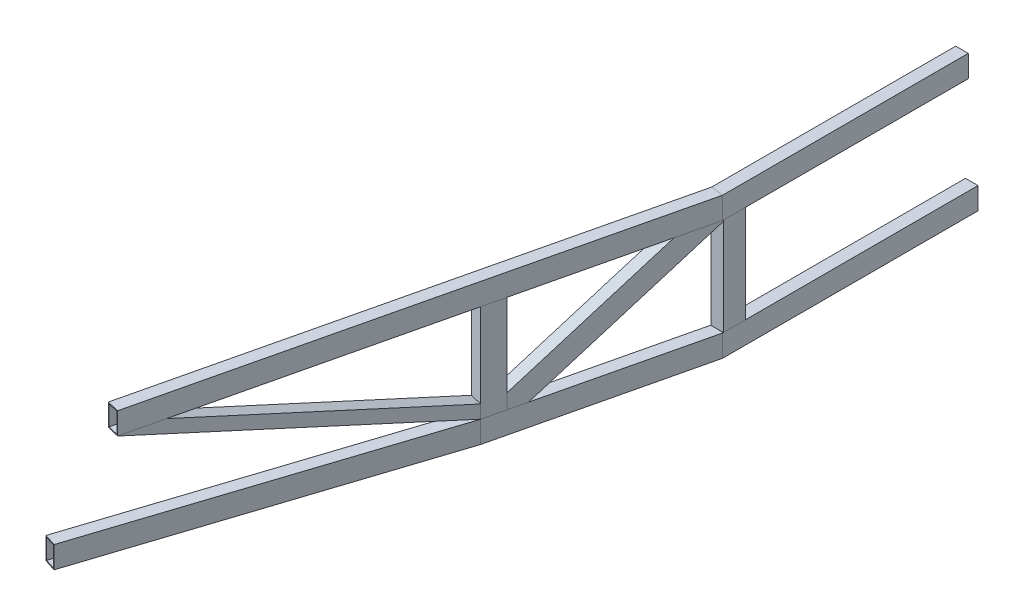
ISO-10303-21;
HEADER;
FILE_DESCRIPTION(('STEP AP214'),'2;1');
FILE_NAME('part.step','',(''),(''),'','','');
FILE_SCHEMA(('AUTOMOTIVE_DESIGN { 1 0 10303 214 1 1 1 1 }'));
ENDSEC;
DATA;
#1=APPLICATION_CONTEXT('core data for automotive mechanical design processes');
#2=APPLICATION_PROTOCOL_DEFINITION('international standard','automotive_design',2000,#1);
#3=PRODUCT_CONTEXT('',#1,'mechanical');
#4=PRODUCT('Part','Part','',(#3));
#5=PRODUCT_RELATED_PRODUCT_CATEGORY('part','',(#4));
#6=PRODUCT_DEFINITION_FORMATION('','',#4);
#7=PRODUCT_DEFINITION_CONTEXT('part definition',#1,'design');
#8=PRODUCT_DEFINITION('design','',#6,#7);
#9=PRODUCT_DEFINITION_SHAPE('','',#8);
#10=(LENGTH_UNIT() NAMED_UNIT(*) SI_UNIT(.MILLI.,.METRE.));
#11=(NAMED_UNIT(*) PLANE_ANGLE_UNIT() SI_UNIT($,.RADIAN.));
#12=(NAMED_UNIT(*) SI_UNIT($,.STERADIAN.) SOLID_ANGLE_UNIT());
#13=UNCERTAINTY_MEASURE_WITH_UNIT(LENGTH_MEASURE(1.E-05),#10,'distance_accuracy_value','');
#14=(GEOMETRIC_REPRESENTATION_CONTEXT(3) GLOBAL_UNCERTAINTY_ASSIGNED_CONTEXT((#13)) GLOBAL_UNIT_ASSIGNED_CONTEXT((#10,
#11,#12)) REPRESENTATION_CONTEXT('',''));
#15=CARTESIAN_POINT('',(0.,0.,0.));
#16=DIRECTION('',(0.,0.,1.));
#17=DIRECTION('',(1.,0.,0.));
#18=AXIS2_PLACEMENT_3D('',#15,#16,#17);
#19=CARTESIAN_POINT('',(459.173496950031,73.0648625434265,-1033.51297056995));
#20=DIRECTION('',(-0.973103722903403,1.24739860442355E-10,-0.230367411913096));
#21=DIRECTION('',(-0.230367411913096,0.,0.973103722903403));
#22=AXIS2_PLACEMENT_3D('',#19,#20,#21);
#23=PLANE('',#22);
#24=DIRECTION('',(0.230367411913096,4.31811753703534E-08,-0.973103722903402));
#25=VECTOR('',#24,1.);
#26=CARTESIAN_POINT('',(459.173494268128,346.000042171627,-1033.51295909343));
#27=LINE('',#26,#25);
#28=CARTESIAN_POINT('',(234.460116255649,346.000000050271,-84.2926552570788));
#29=VERTEX_POINT('',#28);
#30=CARTESIAN_POINT('',(264.448789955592,346.000005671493,-210.968949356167));
#31=VERTEX_POINT('',#30);
#32=EDGE_CURVE('E232',#29,#31,#27,.T.);
#33=ORIENTED_EDGE('',*,*,#32,.F.);
#34=DIRECTION('',(-0.219222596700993,0.307272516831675,0.926026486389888));
#35=VECTOR('',#34,1.);
#36=CARTESIAN_POINT('',(456.342073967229,34.9999999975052,-1021.55264936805));
#37=LINE('',#36,#35);
#38=CARTESIAN_POINT('',(456.342074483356,34.9999998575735,-1021.55265176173));
#39=VERTEX_POINT('',#38);
#40=EDGE_CURVE('E216',#39,#29,#37,.T.);
#41=ORIENTED_EDGE('',*,*,#40,.F.);
#42=DIRECTION('',(-1.21384945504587E-10,-1.,-2.87354796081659E-11));
#43=VECTOR('',#42,1.);
#44=CARTESIAN_POINT('',(456.342074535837,73.0648625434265,-1021.55265174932));
#45=LINE('',#44,#43);
#46=CARTESIAN_POINT('',(456.342074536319,77.033514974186,-1021.5526517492));
#47=VERTEX_POINT('',#46);
#48=EDGE_CURVE('E164',#47,#39,#45,.T.);
#49=ORIENTED_EDGE('',*,*,#48,.F.);
#50=DIRECTION('',(-0.219222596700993,0.307272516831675,0.926026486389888));
#51=VECTOR('',#50,1.);
#52=CARTESIAN_POINT('',(459.173496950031,73.0648625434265,-1033.51297056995));
#53=LINE('',#52,#51);
#54=EDGE_CURVE('E116',#47,#31,#53,.T.);
#55=ORIENTED_EDGE('',*,*,#54,.T.);
#56=EDGE_LOOP('',(#33,#41,#49,#55));
#57=FACE_BOUND('',#56,.T.);
#58=ADVANCED_FACE('F112',(#57),#23,.F.);
#59=CARTESIAN_POINT('',(420.249348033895,73.0648625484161,-1042.72766704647));
#60=DIRECTION('',(-0.0707855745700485,-0.951621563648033,0.299008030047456));
#61=DIRECTION('',(0.,-0.299759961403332,-0.954014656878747));
#62=AXIS2_PLACEMENT_3D('',#59,#60,#61);
#63=PLANE('',#62);
#64=DIRECTION('',(-0.973103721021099,-2.5135833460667E-09,-0.230367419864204));
#65=VECTOR('',#64,1.);
#66=CARTESIAN_POINT('',(225.52463369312,346.000005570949,-220.183647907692));
#67=LINE('',#66,#65);
#68=CARTESIAN_POINT('',(225.524641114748,346.000005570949,-220.183646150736));
#69=VERTEX_POINT('',#68);
#70=EDGE_CURVE('E234',#31,#69,#67,.T.);
#71=ORIENTED_EDGE('',*,*,#70,.F.);
#72=ORIENTED_EDGE('',*,*,#54,.F.);
#73=DIRECTION('',(0.973103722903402,-1.24739527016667E-10,0.230367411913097));
#74=VECTOR('',#73,1.);
#75=CARTESIAN_POINT('',(417.417925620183,77.0335149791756,-1030.76734822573));
#76=LINE('',#75,#74);
#77=CARTESIAN_POINT('',(417.417925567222,77.0335149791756,-1030.76734823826));
#78=VERTEX_POINT('',#77);
#79=EDGE_CURVE('E167',#78,#47,#76,.T.);
#80=ORIENTED_EDGE('',*,*,#79,.F.);
#81=DIRECTION('',(-0.219222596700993,0.307272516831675,0.926026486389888));
#82=VECTOR('',#81,1.);
#83=CARTESIAN_POINT('',(420.249348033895,73.0648625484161,-1042.72766704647));
#84=LINE('',#83,#82);
#85=EDGE_CURVE('E222',#78,#69,#84,.T.);
#86=ORIENTED_EDGE('',*,*,#85,.T.);
#87=EDGE_LOOP('',(#71,#72,#80,#86));
#88=FACE_BOUND('',#87,.T.);
#89=ADVANCED_FACE('F233',(#88),#63,.F.);
#90=CARTESIAN_POINT('',(420.249348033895,73.0648625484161,-1042.72766704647));
#91=DIRECTION('',(0.973103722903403,-1.24739860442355E-10,0.230367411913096));
#92=DIRECTION('',(0.230367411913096,0.,-0.973103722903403));
#93=AXIS2_PLACEMENT_3D('',#90,#91,#92);
#94=PLANE('',#93);
#95=DIRECTION('',(-0.230367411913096,-4.31811753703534E-08,0.973103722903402));
#96=VECTOR('',#95,1.);
#97=CARTESIAN_POINT('',(564.737926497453,346.000069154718,-1653.06735189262));
#98=LINE('',#97,#96);
#99=CARTESIAN_POINT('',(195.535967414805,345.999999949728,-93.5073520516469));
#100=VERTEX_POINT('',#99);
#101=EDGE_CURVE('E131',#69,#100,#98,.T.);
#102=ORIENTED_EDGE('',*,*,#101,.F.);
#103=ORIENTED_EDGE('',*,*,#85,.F.);
#104=DIRECTION('',(0.,-1.,0.));
#105=VECTOR('',#104,1.);
#106=CARTESIAN_POINT('',(417.417925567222,381.000043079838,-1030.76734823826));
#107=LINE('',#106,#105);
#108=CARTESIAN_POINT('',(417.417925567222,34.9999999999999,-1030.76734823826));
#109=VERTEX_POINT('',#108);
#110=EDGE_CURVE('E221',#78,#109,#107,.T.);
#111=ORIENTED_EDGE('',*,*,#110,.T.);
#112=DIRECTION('',(-0.219222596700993,0.307272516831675,0.926026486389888));
#113=VECTOR('',#112,1.);
#114=CARTESIAN_POINT('',(417.417925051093,35.0000000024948,-1030.76734584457));
#115=LINE('',#114,#113);
#116=EDGE_CURVE('E219',#109,#100,#115,.T.);
#117=ORIENTED_EDGE('',*,*,#116,.T.);
#118=EDGE_LOOP('',(#102,#103,#111,#117));
#119=FACE_BOUND('',#118,.T.);
#120=ADVANCED_FACE('F264',(#119),#94,.F.);
#121=CARTESIAN_POINT('',(417.417925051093,35.0000000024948,-1030.76734584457));
#122=DIRECTION('',(0.0707855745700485,0.951621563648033,-0.299008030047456));
#123=DIRECTION('',(0.,0.299759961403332,0.954014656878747));
#124=AXIS2_PLACEMENT_3D('',#121,#122,#123);
#125=PLANE('',#124);
#126=DIRECTION('',(0.973103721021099,2.5135833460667E-09,0.230367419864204));
#127=VECTOR('',#126,1.);
#128=CARTESIAN_POINT('',(195.535958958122,345.999999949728,-93.5073540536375));
#129=LINE('',#128,#127);
#130=EDGE_CURVE('E237',#100,#29,#129,.T.);
#131=ORIENTED_EDGE('',*,*,#130,.F.);
#132=ORIENTED_EDGE('',*,*,#116,.F.);
#133=DIRECTION('',(-0.973103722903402,7.12132161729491E-09,-0.230367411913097));
#134=VECTOR('',#133,1.);
#135=CARTESIAN_POINT('',(456.342072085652,34.9999998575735,-1021.55265232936));
#136=LINE('',#135,#134);
#137=EDGE_CURVE('E160',#39,#109,#136,.T.);
#138=ORIENTED_EDGE('',*,*,#137,.F.);
#139=ORIENTED_EDGE('',*,*,#40,.T.);
#140=EDGE_LOOP('',(#131,#132,#138,#139));
#141=FACE_BOUND('',#140,.T.);
#142=ADVANCED_FACE('F114',(#141),#125,.F.);
#143=CARTESIAN_POINT('',(456.342074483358,381.000043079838,-1021.55265176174));
#144=DIRECTION('',(0.230367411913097,0.,-0.973103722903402));
#145=DIRECTION('',(-0.973103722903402,0.,-0.230367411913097));
#146=AXIS2_PLACEMENT_3D('',#143,#144,#145);
#147=PLANE('',#146);
#148=DIRECTION('',(-1.213850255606E-10,-1.,-2.87354985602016E-11));
#149=VECTOR('',#148,1.);
#150=CARTESIAN_POINT('',(453.42276336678,70.2099978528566,-1022.24375398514));
#151=LINE('',#150,#149);
#152=CARTESIAN_POINT('',(453.422763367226,73.8810012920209,-1022.24375398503));
#153=VERTEX_POINT('',#152);
#154=CARTESIAN_POINT('',(453.422763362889,38.1525128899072,-1022.24375398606));
#155=VERTEX_POINT('',#154);
#156=EDGE_CURVE('E208',#153,#155,#151,.T.);
#157=ORIENTED_EDGE('',*,*,#156,.F.);
#158=DIRECTION('',(0.973103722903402,-1.24740313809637E-10,0.230367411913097));
#159=VECTOR('',#158,1.);
#160=CARTESIAN_POINT('',(420.33723678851,73.881001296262,-1030.07624599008));
#161=LINE('',#160,#159);
#162=CARTESIAN_POINT('',(420.33723678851,73.881001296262,-1030.07624599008));
#163=VERTEX_POINT('',#162);
#164=EDGE_CURVE('E199',#163,#153,#161,.T.);
#165=ORIENTED_EDGE('',*,*,#164,.F.);
#166=DIRECTION('',(1.213850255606E-10,1.,2.87354985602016E-11));
#167=VECTOR('',#166,1.);
#168=CARTESIAN_POINT('',(420.337236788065,70.2099978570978,-1030.07624599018));
#169=LINE('',#168,#167);
#170=CARTESIAN_POINT('',(420.337236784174,38.1525128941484,-1030.0762459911));
#171=VERTEX_POINT('',#170);
#172=EDGE_CURVE('E14',#171,#163,#169,.T.);
#173=ORIENTED_EDGE('',*,*,#172,.F.);
#174=DIRECTION('',(-0.973103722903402,1.24740313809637E-10,-0.230367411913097));
#175=VECTOR('',#174,1.);
#176=CARTESIAN_POINT('',(420.337236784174,38.1525128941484,-1030.0762459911));
#177=LINE('',#176,#175);
#178=EDGE_CURVE('E213',#155,#171,#177,.T.);
#179=ORIENTED_EDGE('',*,*,#178,.F.);
#180=EDGE_LOOP('',(#157,#165,#173,#179));
#181=FACE_BOUND('',#180,.T.);
#182=ORIENTED_EDGE('',*,*,#79,.T.);
#183=ORIENTED_EDGE('',*,*,#48,.T.);
#184=ORIENTED_EDGE('',*,*,#137,.T.);
#185=ORIENTED_EDGE('',*,*,#110,.F.);
#186=EDGE_LOOP('',(#182,#183,#184,#185));
#187=FACE_BOUND('',#186,.T.);
#188=ADVANCED_FACE('F256',(#181,#187),#147,.T.);
#189=CARTESIAN_POINT('',(564.737926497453,346.000069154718,-1653.06735189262));
#190=DIRECTION('',(-1.23935132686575E-08,0.999999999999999,4.14407147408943E-08));
#191=DIRECTION('',(0.,-4.14407147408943E-08,0.999999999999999));
#192=AXIS2_PLACEMENT_3D('',#189,#190,#191);
#193=PLANE('',#192);
#194=DIRECTION('',(-0.230367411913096,-4.31811753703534E-08,0.973103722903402));
#195=VECTOR('',#194,1.);
#196=CARTESIAN_POINT('',(422.95629976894,346.00004203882,-1041.13952912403));
#197=LINE('',#196,#195);
#198=CARTESIAN_POINT('',(226.194801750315,346.000005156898,-209.991821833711));
#199=VERTEX_POINT('',#198);
#200=CARTESIAN_POINT('',(200.704429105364,346.00000037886,-102.316971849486));
#201=VERTEX_POINT('',#200);
#202=EDGE_CURVE('E122',#199,#201,#197,.T.);
#203=ORIENTED_EDGE('',*,*,#202,.F.);
#204=DIRECTION('',(-0.973103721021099,-2.5135833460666E-09,-0.230367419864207));
#205=VECTOR('',#204,1.);
#206=CARTESIAN_POINT('',(226.194794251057,346.000005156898,-209.991823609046));
#207=LINE('',#206,#205);
#208=CARTESIAN_POINT('',(259.280328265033,346.00000524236,-202.159329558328));
#209=VERTEX_POINT('',#208);
#210=EDGE_CURVE('E179',#209,#199,#207,.T.);
#211=ORIENTED_EDGE('',*,*,#210,.F.);
#212=DIRECTION('',(0.230367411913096,4.31811753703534E-08,-0.973103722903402));
#213=VECTOR('',#212,1.);
#214=CARTESIAN_POINT('',(456.041826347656,346.000042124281,-1033.30703711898));
#215=LINE('',#214,#213);
#216=CARTESIAN_POINT('',(233.789955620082,346.000000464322,-94.4844795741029));
#217=VERTEX_POINT('',#216);
#218=EDGE_CURVE('E212',#217,#209,#215,.T.);
#219=ORIENTED_EDGE('',*,*,#218,.F.);
#220=DIRECTION('',(0.973103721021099,2.5135833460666E-09,0.230367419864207));
#221=VECTOR('',#220,1.);
#222=CARTESIAN_POINT('',(200.704420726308,346.00000037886,-102.316973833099));
#223=LINE('',#222,#221);
#224=EDGE_CURVE('E185',#201,#217,#223,.T.);
#225=ORIENTED_EDGE('',*,*,#224,.F.);
#226=EDGE_LOOP('',(#203,#211,#219,#225));
#227=FACE_BOUND('',#226,.T.);
#228=ORIENTED_EDGE('',*,*,#130,.T.);
#229=ORIENTED_EDGE('',*,*,#32,.T.);
#230=ORIENTED_EDGE('',*,*,#70,.T.);
#231=ORIENTED_EDGE('',*,*,#101,.T.);
#232=EDGE_LOOP('',(#228,#229,#230,#231));
#233=FACE_BOUND('',#232,.T.);
#234=ADVANCED_FACE('F183',(#227,#233),#193,.T.);
#235=CARTESIAN_POINT('',(420.549592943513,37.8548646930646,-1030.97326769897));
#236=DIRECTION('',(0.0707855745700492,0.951621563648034,-0.299008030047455));
#237=DIRECTION('',(0.,0.299759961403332,0.954014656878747));
#238=AXIS2_PLACEMENT_3D('',#235,#236,#237);
#239=PLANE('',#238);
#240=DIRECTION('',(-0.219222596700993,0.307272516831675,0.926026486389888));
#241=VECTOR('',#240,1.);
#242=CARTESIAN_POINT('',(420.549592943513,37.8548646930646,-1030.97326769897));
#243=LINE('',#242,#241);
#244=EDGE_CURVE('E214',#171,#201,#243,.T.);
#245=ORIENTED_EDGE('',*,*,#244,.T.);
#246=ORIENTED_EDGE('',*,*,#224,.T.);
#247=DIRECTION('',(-0.219222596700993,0.307272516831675,0.926026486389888));
#248=VECTOR('',#247,1.);
#249=CARTESIAN_POINT('',(453.635119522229,37.8548646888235,-1023.14077569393));
#250=LINE('',#249,#248);
#251=EDGE_CURVE('E209',#155,#217,#250,.T.);
#252=ORIENTED_EDGE('',*,*,#251,.F.);
#253=ORIENTED_EDGE('',*,*,#178,.T.);
#254=EDGE_LOOP('',(#245,#246,#252,#253));
#255=FACE_BOUND('',#254,.T.);
#256=ADVANCED_FACE('F254',(#255),#239,.T.);
#257=CARTESIAN_POINT('',(456.04182905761,70.2099978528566,-1033.30704871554));
#258=DIRECTION('',(-0.973103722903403,1.2473994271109E-10,-0.230367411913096));
#259=DIRECTION('',(-0.230367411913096,0.,0.973103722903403));
#260=AXIS2_PLACEMENT_3D('',#257,#258,#259);
#261=PLANE('',#260);
#262=ORIENTED_EDGE('',*,*,#251,.T.);
#263=ORIENTED_EDGE('',*,*,#218,.T.);
#264=DIRECTION('',(-0.219222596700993,0.307272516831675,0.926026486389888));
#265=VECTOR('',#264,1.);
#266=CARTESIAN_POINT('',(456.04182905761,70.2099978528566,-1033.30704871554));
#267=LINE('',#266,#265);
#268=EDGE_CURVE('E198',#153,#209,#267,.T.);
#269=ORIENTED_EDGE('',*,*,#268,.F.);
#270=ORIENTED_EDGE('',*,*,#156,.T.);
#271=EDGE_LOOP('',(#262,#263,#269,#270));
#272=FACE_BOUND('',#271,.T.);
#273=ADVANCED_FACE('F250',(#272),#261,.T.);
#274=CARTESIAN_POINT('',(422.956302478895,70.2099978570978,-1041.13954072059));
#275=DIRECTION('',(-0.0707855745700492,-0.951621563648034,0.299008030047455));
#276=DIRECTION('',(0.,-0.299759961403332,-0.954014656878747));
#277=AXIS2_PLACEMENT_3D('',#274,#275,#276);
#278=PLANE('',#277);
#279=ORIENTED_EDGE('',*,*,#268,.T.);
#280=ORIENTED_EDGE('',*,*,#210,.T.);
#281=DIRECTION('',(-0.219222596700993,0.307272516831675,0.926026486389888));
#282=VECTOR('',#281,1.);
#283=CARTESIAN_POINT('',(422.956302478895,70.2099978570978,-1041.13954072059));
#284=LINE('',#283,#282);
#285=EDGE_CURVE('E190',#163,#199,#284,.T.);
#286=ORIENTED_EDGE('',*,*,#285,.F.);
#287=ORIENTED_EDGE('',*,*,#164,.T.);
#288=EDGE_LOOP('',(#279,#280,#286,#287));
#289=FACE_BOUND('',#288,.T.);
#290=ADVANCED_FACE('F195',(#289),#278,.T.);
#291=CARTESIAN_POINT('',(422.956302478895,70.2099978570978,-1041.13954072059));
#292=DIRECTION('',(0.973103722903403,-1.2473994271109E-10,0.230367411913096));
#293=DIRECTION('',(0.230367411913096,0.,-0.973103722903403));
#294=AXIS2_PLACEMENT_3D('',#291,#292,#293);
#295=PLANE('',#294);
#296=ORIENTED_EDGE('',*,*,#285,.T.);
#297=ORIENTED_EDGE('',*,*,#202,.T.);
#298=ORIENTED_EDGE('',*,*,#244,.F.);
#299=ORIENTED_EDGE('',*,*,#172,.T.);
#300=EDGE_LOOP('',(#296,#297,#298,#299));
#301=FACE_BOUND('',#300,.T.);
#302=ADVANCED_FACE('F201',(#301),#295,.T.);
#303=CLOSED_SHELL('',(#58,#89,#120,#142,#188,#234,#256,#273,#290,#302));
#304=MANIFOLD_SOLID_BREP('B2',#303);
#305=CARTESIAN_POINT('',(452.215291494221,30.0681148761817,-1004.12055120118));
#306=DIRECTION('',(-0.973103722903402,0.,-0.230367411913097));
#307=DIRECTION('',(-0.230367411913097,0.,0.973103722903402));
#308=AXIS2_PLACEMENT_3D('',#305,#306,#307);
#309=PLANE('',#308);
#310=DIRECTION('',(0.230367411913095,1.08217309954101E-07,-0.973103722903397));
#311=VECTOR('',#310,1.);
#312=CARTESIAN_POINT('',(456.342073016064,34.9999999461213,-1021.5526451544));
#313=LINE('',#312,#311);
#314=CARTESIAN_POINT('',(472.467793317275,35.0000075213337,-1089.66991236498));
#315=VERTEX_POINT('',#314);
#316=CARTESIAN_POINT('',(485.628529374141,35.0000137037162,-1145.26267634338));
#317=VERTEX_POINT('',#316);
#318=EDGE_CURVE('E407',#315,#317,#313,.T.);
#319=ORIENTED_EDGE('',*,*,#318,.T.);
#320=DIRECTION('',(0.197906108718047,0.511826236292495,-0.835982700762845));
#321=VECTOR('',#320,1.);
#322=CARTESIAN_POINT('',(460.468857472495,-30.0681148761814,-1038.98475232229));
#323=LINE('',#322,#321);
#324=CARTESIAN_POINT('',(604.752793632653,343.080063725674,-1648.46));
#325=VERTEX_POINT('',#324);
#326=EDGE_CURVE('E375',#317,#325,#323,.T.);
#327=ORIENTED_EDGE('',*,*,#326,.T.);
#328=DIRECTION('',(0.,-1.,0.));
#329=VECTOR('',#328,1.);
#330=CARTESIAN_POINT('',(604.752793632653,30.068114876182,-1648.46));
#331=LINE('',#330,#329);
#332=CARTESIAN_POINT('',(604.75279372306,346.000069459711,-1648.46));
#333=VERTEX_POINT('',#332);
#334=EDGE_CURVE('E536',#333,#325,#331,.T.);
#335=ORIENTED_EDGE('',*,*,#334,.F.);
#336=DIRECTION('',(-0.230367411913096,-4.31811753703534E-08,0.973103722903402));
#337=VECTOR('',#336,1.);
#338=CARTESIAN_POINT('',(603.662075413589,346.000069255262,-1643.8526554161));
#339=LINE('',#338,#337);
#340=CARTESIAN_POINT('',(574.37562294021,346.000063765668,-1520.14264063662));
#341=VERTEX_POINT('',#340);
#342=EDGE_CURVE('E538',#333,#341,#339,.T.);
#343=ORIENTED_EDGE('',*,*,#342,.T.);
#344=DIRECTION('',(0.197906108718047,0.511826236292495,-0.835982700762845));
#345=VECTOR('',#344,1.);
#346=CARTESIAN_POINT('',(452.215291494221,30.0681148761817,-1004.12055120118));
#347=LINE('',#346,#345);
#348=CARTESIAN_POINT('',(472.467793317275,82.4452842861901,-1089.66991236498));
#349=VERTEX_POINT('',#348);
#350=EDGE_CURVE('E541',#349,#341,#347,.T.);
#351=ORIENTED_EDGE('',*,*,#350,.F.);
#352=DIRECTION('',(0.,-1.,0.));
#353=VECTOR('',#352,1.);
#354=CARTESIAN_POINT('',(472.467793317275,381.000043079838,-1089.66991236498));
#355=LINE('',#354,#353);
#356=EDGE_CURVE('E512',#349,#315,#355,.T.);
#357=ORIENTED_EDGE('',*,*,#356,.T.);
#358=EDGE_LOOP('',(#319,#327,#335,#343,#351,#357));
#359=FACE_BOUND('',#358,.T.);
#360=ADVANCED_FACE('F371',(#359),#309,.F.);
#361=CARTESIAN_POINT('',(449.649704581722,27.4908478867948,-1006.30583348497));
#362=DIRECTION('',(-0.973103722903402,0.,-0.230367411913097));
#363=DIRECTION('',(-0.230367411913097,0.,0.973103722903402));
#364=AXIS2_PLACEMENT_3D('',#361,#362,#363);
#365=PLANE('',#364);
#366=DIRECTION('',(0.197906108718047,0.511826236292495,-0.835982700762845));
#367=VECTOR('',#366,1.);
#368=CARTESIAN_POINT('',(457.195822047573,-27.4908478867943,-1038.18167450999));
#369=LINE('',#368,#367);
#370=CARTESIAN_POINT('',(481.358950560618,35.0000130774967,-1140.25006221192));
#371=VERTEX_POINT('',#370);
#372=CARTESIAN_POINT('',(601.612283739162,346.000069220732,-1648.21672831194));
#373=VERTEX_POINT('',#372);
#374=EDGE_CURVE('E506',#371,#373,#369,.T.);
#375=ORIENTED_EDGE('',*,*,#374,.F.);
#376=DIRECTION('',(-0.230367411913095,-1.08217309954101E-07,0.973103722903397));
#377=VECTOR('',#376,1.);
#378=CARTESIAN_POINT('',(449.649704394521,34.999998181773,-1006.30583269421));
#379=LINE('',#378,#377);
#380=CARTESIAN_POINT('',(469.548482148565,35.0000075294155,-1090.36101460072));
#381=VERTEX_POINT('',#380);
#382=EDGE_CURVE('E508',#371,#381,#379,.T.);
#383=ORIENTED_EDGE('',*,*,#382,.T.);
#384=DIRECTION('',(0.,1.,0.));
#385=VECTOR('',#384,1.);
#386=CARTESIAN_POINT('',(469.548482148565,27.4908478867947,-1090.36101460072));
#387=LINE('',#386,#385);
#388=CARTESIAN_POINT('',(469.548482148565,78.9532130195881,-1090.36101460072));
#389=VERTEX_POINT('',#388);
#390=EDGE_CURVE('E511',#381,#389,#387,.T.);
#391=ORIENTED_EDGE('',*,*,#390,.T.);
#392=DIRECTION('',(0.197906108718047,0.511826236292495,-0.835982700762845));
#393=VECTOR('',#392,1.);
#394=CARTESIAN_POINT('',(449.649704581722,27.4908478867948,-1006.30583348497));
#395=LINE('',#394,#393);
#396=CARTESIAN_POINT('',(572.806579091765,346.000064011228,-1526.5374586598));
#397=VERTEX_POINT('',#396);
#398=EDGE_CURVE('E546',#389,#397,#395,.T.);
#399=ORIENTED_EDGE('',*,*,#398,.T.);
#400=DIRECTION('',(0.230367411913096,4.31811753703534E-08,-0.973103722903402));
#401=VECTOR('',#400,1.);
#402=CARTESIAN_POINT('',(449.649701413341,346.000040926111,-1006.30582010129));
#403=LINE('',#402,#401);
#404=CARTESIAN_POINT('',(601.200000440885,346.000069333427,-1646.47518679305));
#405=VERTEX_POINT('',#404);
#406=EDGE_CURVE('E531',#397,#405,#403,.T.);
#407=ORIENTED_EDGE('',*,*,#406,.T.);
#408=DIRECTION('',(0.230367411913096,-6.29696337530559E-08,-0.9731037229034));
#409=VECTOR('',#408,1.);
#410=CARTESIAN_POINT('',(449.649709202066,346.000110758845,-1006.30585300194));
#411=LINE('',#410,#409);
#412=EDGE_CURVE('E507',#405,#373,#411,.T.);
#413=ORIENTED_EDGE('',*,*,#412,.T.);
#414=EDGE_LOOP('',(#375,#383,#391,#399,#407,#413));
#415=FACE_BOUND('',#414,.T.);
#416=ADVANCED_FACE('F586',(#415),#365,.T.);
#417=CARTESIAN_POINT('',(424.110295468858,-27.4908478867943,-1046.01416651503));
#418=DIRECTION('',(-0.117908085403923,0.859088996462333,0.498060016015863));
#419=DIRECTION('',(0.,-0.501558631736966,0.865123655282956));
#420=AXIS2_PLACEMENT_3D('',#417,#418,#419);
#421=PLANE('',#420);
#422=DIRECTION('',(0.197906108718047,0.511826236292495,-0.835982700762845));
#423=VECTOR('',#422,1.);
#424=CARTESIAN_POINT('',(424.110295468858,-27.4908478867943,-1046.01416651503));
#425=LINE('',#424,#423);
#426=CARTESIAN_POINT('',(448.273424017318,35.0000131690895,-1148.08255436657));
#427=VERTEX_POINT('',#426);
#428=CARTESIAN_POINT('',(566.730125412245,341.353606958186,-1648.46));
#429=VERTEX_POINT('',#428);
#430=EDGE_CURVE('E466',#427,#429,#425,.T.);
#431=ORIENTED_EDGE('',*,*,#430,.F.);
#432=DIRECTION('',(0.973103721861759,-2.69390555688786E-09,0.230367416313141));
#433=VECTOR('',#432,1.);
#434=CARTESIAN_POINT('',(448.273424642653,35.0000131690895,-1148.08255421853));
#435=LINE('',#434,#433);
#436=EDGE_CURVE('E504',#427,#371,#435,.T.);
#437=ORIENTED_EDGE('',*,*,#436,.T.);
#438=ORIENTED_EDGE('',*,*,#374,.T.);
#439=DIRECTION('',(-0.973103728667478,-1.49070953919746E-08,-0.230367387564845));
#440=VECTOR('',#439,1.);
#441=CARTESIAN_POINT('',(568.526736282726,346.00006871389,-1656.04922438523));
#442=LINE('',#441,#440);
#443=CARTESIAN_POINT('',(600.584670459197,346.00006920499,-1648.46));
#444=VERTEX_POINT('',#443);
#445=EDGE_CURVE('E483',#373,#444,#442,.T.);
#446=ORIENTED_EDGE('',*,*,#445,.T.);
#447=DIRECTION('',(-0.99071252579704,-0.135973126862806,0.));
#448=VECTOR('',#447,1.);
#449=CARTESIAN_POINT('',(377.060009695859,315.321798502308,-1648.46));
#450=LINE('',#449,#448);
#451=EDGE_CURVE('E480',#444,#429,#450,.T.);
#452=ORIENTED_EDGE('',*,*,#451,.T.);
#453=EDGE_LOOP('',(#431,#437,#438,#446,#452));
#454=FACE_BOUND('',#453,.T.);
#455=ADVANCED_FACE('F481',(#454),#421,.T.);
#456=CARTESIAN_POINT('',(416.564178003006,27.4908478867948,-1014.13832549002));
#457=DIRECTION('',(0.973103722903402,0.,0.230367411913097));
#458=DIRECTION('',(0.230367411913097,0.,-0.973103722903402));
#459=AXIS2_PLACEMENT_3D('',#456,#457,#458);
#460=PLANE('',#459);
#461=DIRECTION('',(0.,-1.,0.));
#462=VECTOR('',#461,1.);
#463=CARTESIAN_POINT('',(436.462955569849,27.4908478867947,-1098.19350660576));
#464=LINE('',#463,#462);
#465=CARTESIAN_POINT('',(436.462955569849,78.9532130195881,-1098.19350660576));
#466=VERTEX_POINT('',#465);
#467=CARTESIAN_POINT('',(436.462955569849,35.0000076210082,-1098.19350660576));
#468=VERTEX_POINT('',#467);
#469=EDGE_CURVE('E486',#466,#468,#464,.T.);
#470=ORIENTED_EDGE('',*,*,#469,.T.);
#471=DIRECTION('',(0.230367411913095,1.08217309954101E-07,-0.973103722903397));
#472=VECTOR('',#471,1.);
#473=CARTESIAN_POINT('',(416.564177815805,34.9999982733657,-1014.13832469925));
#474=LINE('',#473,#472);
#475=EDGE_CURVE('E474',#468,#427,#474,.T.);
#476=ORIENTED_EDGE('',*,*,#475,.T.);
#477=ORIENTED_EDGE('',*,*,#430,.T.);
#478=DIRECTION('',(0.,1.,0.));
#479=VECTOR('',#478,1.);
#480=CARTESIAN_POINT('',(566.730125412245,27.4908478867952,-1648.46));
#481=LINE('',#480,#479);
#482=CARTESIAN_POINT('',(566.730125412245,346.000068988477,-1648.46));
#483=VERTEX_POINT('',#482);
#484=EDGE_CURVE('E472',#429,#483,#481,.T.);
#485=ORIENTED_EDGE('',*,*,#484,.T.);
#486=DIRECTION('',(-0.230367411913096,-4.31811753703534E-08,0.973103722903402));
#487=VECTOR('',#486,1.);
#488=CARTESIAN_POINT('',(416.564174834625,346.000040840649,-1014.13831210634));
#489=LINE('',#488,#487);
#490=CARTESIAN_POINT('',(539.721052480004,346.000063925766,-1534.36995052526));
#491=VERTEX_POINT('',#490);
#492=EDGE_CURVE('E493',#483,#491,#489,.T.);
#493=ORIENTED_EDGE('',*,*,#492,.T.);
#494=DIRECTION('',(0.197906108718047,0.511826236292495,-0.835982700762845));
#495=VECTOR('',#494,1.);
#496=CARTESIAN_POINT('',(416.564178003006,27.4908478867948,-1014.13832549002));
#497=LINE('',#496,#495);
#498=EDGE_CURVE('E532',#466,#491,#497,.T.);
#499=ORIENTED_EDGE('',*,*,#498,.F.);
#500=EDGE_LOOP('',(#470,#476,#477,#485,#493,#499));
#501=FACE_BOUND('',#500,.T.);
#502=ADVANCED_FACE('F469',(#501),#460,.T.);
#503=CARTESIAN_POINT('',(413.291142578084,30.0681148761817,-1013.33524767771));
#504=DIRECTION('',(0.973103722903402,0.,0.230367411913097));
#505=DIRECTION('',(0.230367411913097,0.,-0.973103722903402));
#506=AXIS2_PLACEMENT_3D('',#503,#504,#505);
#507=PLANE('',#506);
#508=DIRECTION('',(0.230367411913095,1.08217309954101E-07,-0.973103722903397));
#509=VECTOR('',#508,1.);
#510=CARTESIAN_POINT('',(417.417924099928,35.0000000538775,-1030.76734163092));
#511=LINE('',#510,#509);
#512=CARTESIAN_POINT('',(433.543644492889,35.0000076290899,-1098.88460881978));
#513=VERTEX_POINT('',#512);
#514=CARTESIAN_POINT('',(446.704380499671,35.0000138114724,-1154.4773729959));
#515=VERTEX_POINT('',#514);
#516=EDGE_CURVE('E110',#513,#515,#511,.T.);
#517=ORIENTED_EDGE('',*,*,#516,.F.);
#518=DIRECTION('',(0.,-1.,0.));
#519=VECTOR('',#518,1.);
#520=CARTESIAN_POINT('',(433.543644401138,381.000043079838,-1098.8846088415));
#521=LINE('',#520,#519);
#522=CARTESIAN_POINT('',(433.543644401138,82.44528428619,-1098.8846088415));
#523=VERTEX_POINT('',#522);
#524=EDGE_CURVE('E522',#523,#513,#521,.T.);
#525=ORIENTED_EDGE('',*,*,#524,.F.);
#526=DIRECTION('',(0.197906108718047,0.511826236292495,-0.835982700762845));
#527=VECTOR('',#526,1.);
#528=CARTESIAN_POINT('',(413.291142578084,30.0681148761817,-1013.33524767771));
#529=LINE('',#528,#527);
#530=CARTESIAN_POINT('',(535.451473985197,346.000063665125,-1529.35733694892));
#531=VERTEX_POINT('',#530);
#532=EDGE_CURVE('E495',#523,#531,#529,.T.);
#533=ORIENTED_EDGE('',*,*,#532,.T.);
#534=DIRECTION('',(-0.230367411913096,-4.31811753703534E-08,0.973103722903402));
#535=VECTOR('',#534,1.);
#536=CARTESIAN_POINT('',(564.737926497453,346.000069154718,-1653.06735189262));
#537=LINE('',#536,#535);
#538=CARTESIAN_POINT('',(563.647206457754,346.000068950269,-1648.46));
#539=VERTEX_POINT('',#538);
#540=EDGE_CURVE('E419',#539,#531,#537,.T.);
#541=ORIENTED_EDGE('',*,*,#540,.F.);
#542=DIRECTION('',(0.,1.,0.));
#543=VECTOR('',#542,1.);
#544=CARTESIAN_POINT('',(563.647206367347,30.068114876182,-1648.46));
#545=LINE('',#544,#543);
#546=CARTESIAN_POINT('',(563.647206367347,337.438411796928,-1648.46));
#547=VERTEX_POINT('',#546);
#548=EDGE_CURVE('E500',#547,#539,#545,.T.);
#549=ORIENTED_EDGE('',*,*,#548,.F.);
#550=DIRECTION('',(0.197906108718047,0.511826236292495,-0.835982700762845));
#551=VECTOR('',#550,1.);
#552=CARTESIAN_POINT('',(421.544708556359,-30.0681148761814,-1048.19944879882));
#553=LINE('',#552,#551);
#554=EDGE_CURVE('E501',#515,#547,#553,.T.);
#555=ORIENTED_EDGE('',*,*,#554,.F.);
#556=EDGE_LOOP('',(#517,#525,#533,#541,#549,#555));
#557=FACE_BOUND('',#556,.T.);
#558=ADVANCED_FACE('F577',(#557),#507,.F.);
#559=CARTESIAN_POINT('',(421.544708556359,-30.0681148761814,-1048.19944879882));
#560=DIRECTION('',(-0.117908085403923,0.859088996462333,0.498060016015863));
#561=DIRECTION('',(0.,-0.501558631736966,0.865123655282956));
#562=AXIS2_PLACEMENT_3D('',#559,#560,#561);
#563=PLANE('',#562);
#564=DIRECTION('',(0.973103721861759,-2.69390555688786E-09,0.230367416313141));
#565=VECTOR('',#564,1.);
#566=CARTESIAN_POINT('',(446.704381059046,35.0000138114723,-1154.47737286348));
#567=LINE('',#566,#565);
#568=EDGE_CURVE('E381',#515,#317,#567,.T.);
#569=ORIENTED_EDGE('',*,*,#568,.F.);
#570=ORIENTED_EDGE('',*,*,#554,.T.);
#571=DIRECTION('',(-0.99071252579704,-0.135973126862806,0.));
#572=VECTOR('',#571,1.);
#573=CARTESIAN_POINT('',(374.665090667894,311.501029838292,-1648.46));
#574=LINE('',#573,#572);
#575=EDGE_CURVE('E499',#325,#547,#574,.T.);
#576=ORIENTED_EDGE('',*,*,#575,.F.);
#577=ORIENTED_EDGE('',*,*,#326,.F.);
#578=EDGE_LOOP('',(#569,#570,#576,#577));
#579=FACE_BOUND('',#578,.T.);
#580=ADVANCED_FACE('F575',(#579),#563,.F.);
#581=CARTESIAN_POINT('',(583.771990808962,421.367343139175,-1648.46));
#582=DIRECTION('',(0.,0.,-1.));
#583=DIRECTION('',(0.,1.,0.));
#584=AXIS2_PLACEMENT_3D('',#581,#582,#583);
#585=PLANE('',#584);
#586=ORIENTED_EDGE('',*,*,#575,.T.);
#587=ORIENTED_EDGE('',*,*,#548,.T.);
#588=DIRECTION('',(1.,1.23935132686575E-08,0.));
#589=VECTOR('',#588,1.);
#590=CARTESIAN_POINT('',(604.200000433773,346.00006945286,-1648.46));
#591=LINE('',#590,#589);
#592=EDGE_CURVE('E492',#539,#483,#591,.T.);
#593=ORIENTED_EDGE('',*,*,#592,.T.);
#594=ORIENTED_EDGE('',*,*,#484,.F.);
#595=ORIENTED_EDGE('',*,*,#451,.F.);
#596=DIRECTION('',(1.,1.23935132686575E-08,0.));
#597=VECTOR('',#596,1.);
#598=CARTESIAN_POINT('',(583.771991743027,346.000069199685,-1648.46));
#599=LINE('',#598,#597);
#600=EDGE_CURVE('E555',#444,#333,#599,.T.);
#601=ORIENTED_EDGE('',*,*,#600,.T.);
#602=ORIENTED_EDGE('',*,*,#334,.T.);
#603=EDGE_LOOP('',(#586,#587,#593,#594,#595,#601,#602));
#604=FACE_BOUND('',#603,.T.);
#605=ADVANCED_FACE('F490',(#604),#585,.T.);
#606=CARTESIAN_POINT('',(416.564178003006,27.4908478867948,-1014.13832549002));
#607=DIRECTION('',(0.117908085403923,-0.859088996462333,-0.498060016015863));
#608=DIRECTION('',(0.,0.501558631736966,-0.865123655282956));
#609=AXIS2_PLACEMENT_3D('',#606,#607,#608);
#610=PLANE('',#609);
#611=ORIENTED_EDGE('',*,*,#498,.T.);
#612=DIRECTION('',(0.973103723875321,2.5135838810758E-09,0.230367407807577));
#613=VECTOR('',#612,1.);
#614=CARTESIAN_POINT('',(539.721049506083,346.000063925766,-1534.36995122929));
#615=LINE('',#614,#613);
#616=EDGE_CURVE('E535',#491,#397,#615,.T.);
#617=ORIENTED_EDGE('',*,*,#616,.T.);
#618=ORIENTED_EDGE('',*,*,#398,.F.);
#619=DIRECTION('',(-0.973103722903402,0.,-0.230367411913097));
#620=VECTOR('',#619,1.);
#621=CARTESIAN_POINT('',(436.462955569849,78.9532130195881,-1098.19350660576));
#622=LINE('',#621,#620);
#623=EDGE_CURVE('E542',#389,#466,#622,.T.);
#624=ORIENTED_EDGE('',*,*,#623,.T.);
#625=EDGE_LOOP('',(#611,#617,#618,#624));
#626=FACE_BOUND('',#625,.T.);
#627=ADVANCED_FACE('F591',(#626),#610,.T.);
#628=CARTESIAN_POINT('',(413.291142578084,30.0681148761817,-1013.33524767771));
#629=DIRECTION('',(0.117908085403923,-0.859088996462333,-0.498060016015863));
#630=DIRECTION('',(0.,0.501558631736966,-0.865123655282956));
#631=AXIS2_PLACEMENT_3D('',#628,#629,#630);
#632=PLANE('',#631);
#633=DIRECTION('',(0.973103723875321,2.5135838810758E-09,0.230367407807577));
#634=VECTOR('',#633,1.);
#635=CARTESIAN_POINT('',(535.45147094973,346.000063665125,-1529.35733766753));
#636=LINE('',#635,#634);
#637=EDGE_CURVE('E527',#531,#341,#636,.T.);
#638=ORIENTED_EDGE('',*,*,#637,.F.);
#639=ORIENTED_EDGE('',*,*,#532,.F.);
#640=DIRECTION('',(-0.973103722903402,0.,-0.230367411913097));
#641=VECTOR('',#640,1.);
#642=CARTESIAN_POINT('',(433.543644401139,82.44528428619,-1098.8846088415));
#643=LINE('',#642,#641);
#644=EDGE_CURVE('E516',#349,#523,#643,.T.);
#645=ORIENTED_EDGE('',*,*,#644,.F.);
#646=ORIENTED_EDGE('',*,*,#350,.T.);
#647=EDGE_LOOP('',(#638,#639,#645,#646));
#648=FACE_BOUND('',#647,.T.);
#649=ADVANCED_FACE('F582',(#648),#632,.F.);
#650=CARTESIAN_POINT('',(472.467793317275,381.000043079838,-1089.66991236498));
#651=DIRECTION('',(-0.230367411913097,0.,0.973103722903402));
#652=DIRECTION('',(0.973103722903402,0.,0.230367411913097));
#653=AXIS2_PLACEMENT_3D('',#650,#651,#652);
#654=PLANE('',#653);
#655=ORIENTED_EDGE('',*,*,#524,.T.);
#656=DIRECTION('',(0.973103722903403,-2.69390506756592E-09,0.230367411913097));
#657=VECTOR('',#656,1.);
#658=CARTESIAN_POINT('',(472.467792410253,35.0000075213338,-1089.6699125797));
#659=LINE('',#658,#657);
#660=EDGE_CURVE('E517',#513,#468,#659,.T.);
#661=ORIENTED_EDGE('',*,*,#660,.T.);
#662=ORIENTED_EDGE('',*,*,#469,.F.);
#663=ORIENTED_EDGE('',*,*,#623,.F.);
#664=ORIENTED_EDGE('',*,*,#390,.F.);
#665=DIRECTION('',(0.973103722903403,-2.69390506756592E-09,0.230367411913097));
#666=VECTOR('',#665,1.);
#667=CARTESIAN_POINT('',(472.467792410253,35.0000075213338,-1089.6699125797));
#668=LINE('',#667,#666);
#669=EDGE_CURVE('E513',#381,#315,#668,.T.);
#670=ORIENTED_EDGE('',*,*,#669,.T.);
#671=ORIENTED_EDGE('',*,*,#356,.F.);
#672=ORIENTED_EDGE('',*,*,#644,.T.);
#673=EDGE_LOOP('',(#655,#661,#662,#663,#664,#670,#671,#672));
#674=FACE_BOUND('',#673,.T.);
#675=ADVANCED_FACE('F584',(#674),#654,.T.);
#676=CARTESIAN_POINT('',(564.737926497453,346.000069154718,-1653.06735189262));
#677=DIRECTION('',(-1.23935132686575E-08,0.999999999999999,4.14407147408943E-08));
#678=DIRECTION('',(0.,-4.14407147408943E-08,0.999999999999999));
#679=AXIS2_PLACEMENT_3D('',#676,#677,#678);
#680=PLANE('',#679);
#681=ORIENTED_EDGE('',*,*,#637,.T.);
#682=ORIENTED_EDGE('',*,*,#342,.F.);
#683=ORIENTED_EDGE('',*,*,#600,.F.);
#684=ORIENTED_EDGE('',*,*,#445,.F.);
#685=ORIENTED_EDGE('',*,*,#412,.F.);
#686=ORIENTED_EDGE('',*,*,#406,.F.);
#687=ORIENTED_EDGE('',*,*,#616,.F.);
#688=ORIENTED_EDGE('',*,*,#492,.F.);
#689=ORIENTED_EDGE('',*,*,#592,.F.);
#690=ORIENTED_EDGE('',*,*,#540,.T.);
#691=EDGE_LOOP('',(#681,#682,#683,#684,#685,#686,#687,#688,#689,#690));
#692=FACE_BOUND('',#691,.T.);
#693=ADVANCED_FACE('F587',(#692),#680,.T.);
#694=CARTESIAN_POINT('',(417.417924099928,35.0000000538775,-1030.76734163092));
#695=DIRECTION('',(2.2308292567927E-08,-0.999999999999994,-1.05927255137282E-07));
#696=DIRECTION('',(0.,1.05927255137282E-07,-0.999999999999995));
#697=AXIS2_PLACEMENT_3D('',#694,#695,#696);
#698=PLANE('',#697);
#699=ORIENTED_EDGE('',*,*,#568,.T.);
#700=ORIENTED_EDGE('',*,*,#318,.F.);
#701=ORIENTED_EDGE('',*,*,#669,.F.);
#702=ORIENTED_EDGE('',*,*,#382,.F.);
#703=ORIENTED_EDGE('',*,*,#436,.F.);
#704=ORIENTED_EDGE('',*,*,#475,.F.);
#705=ORIENTED_EDGE('',*,*,#660,.F.);
#706=ORIENTED_EDGE('',*,*,#516,.T.);
#707=EDGE_LOOP('',(#699,#700,#701,#702,#703,#704,#705,#706));
#708=FACE_BOUND('',#707,.T.);
#709=ADVANCED_FACE('F373',(#708),#698,.T.);
#710=CLOSED_SHELL('',(#360,#416,#455,#502,#558,#580,#605,#627,#649,#675,#693,#709));
#711=MANIFOLD_SOLID_BREP('B8',#710);
#712=CARTESIAN_POINT('',(564.2,381.00006920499,-1648.46));
#713=DIRECTION('',(1.,0.,0.));
#714=DIRECTION('',(0.,0.,-1.));
#715=AXIS2_PLACEMENT_3D('',#712,#713,#714);
#716=PLANE('',#715);
#717=DIRECTION('',(0.,-4.14407147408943E-08,0.999999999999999));
#718=VECTOR('',#717,1.);
#719=CARTESIAN_POINT('',(564.2,346.00006895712,-1648.46000145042));
#720=LINE('',#719,#718);
#721=CARTESIAN_POINT('',(564.2,346.000069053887,-1650.79507846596));
#722=VERTEX_POINT('',#721);
#723=CARTESIAN_POINT('',(564.2,346.00006895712,-1648.46));
#724=VERTEX_POINT('',#723);
#725=EDGE_CURVE('E753',#722,#724,#720,.T.);
#726=ORIENTED_EDGE('',*,*,#725,.F.);
#727=DIRECTION('',(0.,6.4710094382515E-08,0.999999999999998));
#728=VECTOR('',#727,1.);
#729=CARTESIAN_POINT('',(564.2,346.000018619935,-2430.17813781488));
#730=LINE('',#729,#728);
#731=CARTESIAN_POINT('',(564.2,346.000064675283,-1718.46));
#732=VERTEX_POINT('',#731);
#733=EDGE_CURVE('E875',#732,#722,#730,.T.);
#734=ORIENTED_EDGE('',*,*,#733,.F.);
#735=DIRECTION('',(0.,-1.,0.));
#736=VECTOR('',#735,1.);
#737=CARTESIAN_POINT('',(564.2,381.000069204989,-1718.46));
#738=LINE('',#737,#736);
#739=CARTESIAN_POINT('',(564.2,35.0000632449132,-1718.46));
#740=VERTEX_POINT('',#739);
#741=EDGE_CURVE('E747',#732,#740,#738,.T.);
#742=ORIENTED_EDGE('',*,*,#741,.T.);
#743=DIRECTION('',(0.,-8.51439330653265E-08,-0.999999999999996));
#744=VECTOR('',#743,1.);
#745=CARTESIAN_POINT('',(564.2,35.0000692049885,-1648.46));
#746=LINE('',#745,#744);
#747=CARTESIAN_POINT('',(564.199999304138,35.0000690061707,-1650.79507320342));
#748=VERTEX_POINT('',#747);
#749=EDGE_CURVE('E874',#748,#740,#746,.T.);
#750=ORIENTED_EDGE('',*,*,#749,.F.);
#751=DIRECTION('',(0.,1.05927255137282E-07,-0.999999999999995));
#752=VECTOR('',#751,1.);
#753=CARTESIAN_POINT('',(564.2,35.0000687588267,-1648.46003665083));
#754=LINE('',#753,#752);
#755=CARTESIAN_POINT('',(564.2,35.0000687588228,-1648.46));
#756=VERTEX_POINT('',#755);
#757=EDGE_CURVE('E896',#756,#748,#754,.T.);
#758=ORIENTED_EDGE('',*,*,#757,.F.);
#759=DIRECTION('',(0.,-1.,0.));
#760=VECTOR('',#759,1.);
#761=CARTESIAN_POINT('',(564.2,381.00006920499,-1648.46));
#762=LINE('',#761,#760);
#763=EDGE_CURVE('E862',#724,#756,#762,.T.);
#764=ORIENTED_EDGE('',*,*,#763,.F.);
#765=EDGE_LOOP('',(#726,#734,#742,#750,#758,#764));
#766=FACE_BOUND('',#765,.T.);
#767=ADVANCED_FACE('F744',(#766),#716,.F.);
#768=CARTESIAN_POINT('',(604.2,381.00006920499,-1648.46));
#769=DIRECTION('',(0.,0.,-1.));
#770=DIRECTION('',(0.,1.,0.));
#771=AXIS2_PLACEMENT_3D('',#768,#769,#770);
#772=PLANE('',#771);
#773=DIRECTION('',(1.,0.,0.));
#774=VECTOR('',#773,1.);
#775=CARTESIAN_POINT('',(604.2,346.00006920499,-1648.46));
#776=LINE('',#775,#774);
#777=CARTESIAN_POINT('',(584.200016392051,346.00006920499,-1648.46));
#778=VERTEX_POINT('',#777);
#779=CARTESIAN_POINT('',(604.2,346.00006920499,-1648.46));
#780=VERTEX_POINT('',#779);
#781=EDGE_CURVE('E891',#778,#780,#776,.T.);
#782=ORIENTED_EDGE('',*,*,#781,.F.);
#783=DIRECTION('',(1.,1.23935132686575E-08,0.));
#784=VECTOR('',#783,1.);
#785=CARTESIAN_POINT('',(604.200000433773,346.00006945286,-1648.46));
#786=LINE('',#785,#784);
#787=EDGE_CURVE('E369',#724,#778,#786,.T.);
#788=ORIENTED_EDGE('',*,*,#787,.F.);
#789=ORIENTED_EDGE('',*,*,#763,.T.);
#790=DIRECTION('',(-1.,-2.23082925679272E-08,0.));
#791=VECTOR('',#790,1.);
#792=CARTESIAN_POINT('',(604.200007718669,35.0000696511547,-1648.46));
#793=LINE('',#792,#791);
#794=CARTESIAN_POINT('',(584.199970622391,35.0000692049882,-1648.46));
#795=VERTEX_POINT('',#794);
#796=EDGE_CURVE('E898',#795,#756,#793,.T.);
#797=ORIENTED_EDGE('',*,*,#796,.F.);
#798=DIRECTION('',(-1.,0.,0.));
#799=VECTOR('',#798,1.);
#800=CARTESIAN_POINT('',(604.2,35.0000692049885,-1648.46));
#801=LINE('',#800,#799);
#802=CARTESIAN_POINT('',(604.2,35.0000692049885,-1648.46));
#803=VERTEX_POINT('',#802);
#804=EDGE_CURVE('E887',#803,#795,#801,.T.);
#805=ORIENTED_EDGE('',*,*,#804,.F.);
#806=DIRECTION('',(0.,-1.,0.));
#807=VECTOR('',#806,1.);
#808=CARTESIAN_POINT('',(604.2,381.00006920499,-1648.46));
#809=LINE('',#808,#807);
#810=EDGE_CURVE('E860',#780,#803,#809,.T.);
#811=ORIENTED_EDGE('',*,*,#810,.F.);
#812=EDGE_LOOP('',(#782,#788,#789,#797,#805,#811));
#813=FACE_BOUND('',#812,.T.);
#814=ADVANCED_FACE('F906',(#813),#772,.F.);
#815=CARTESIAN_POINT('',(604.2,381.00006920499,-1648.46));
#816=DIRECTION('',(-1.,0.,0.));
#817=DIRECTION('',(0.,0.,1.));
#818=AXIS2_PLACEMENT_3D('',#815,#816,#817);
#819=PLANE('',#818);
#820=DIRECTION('',(0.,6.4710094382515E-08,0.999999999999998));
#821=VECTOR('',#820,1.);
#822=CARTESIAN_POINT('',(604.2,346.000018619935,-2430.17813781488));
#823=LINE('',#822,#821);
#824=CARTESIAN_POINT('',(604.2,346.000064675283,-1718.46));
#825=VERTEX_POINT('',#824);
#826=EDGE_CURVE('E778',#825,#780,#823,.T.);
#827=ORIENTED_EDGE('',*,*,#826,.T.);
#828=ORIENTED_EDGE('',*,*,#810,.T.);
#829=DIRECTION('',(0.,-8.51439330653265E-08,-0.999999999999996));
#830=VECTOR('',#829,1.);
#831=CARTESIAN_POINT('',(604.2,35.0000692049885,-1648.46));
#832=LINE('',#831,#830);
#833=CARTESIAN_POINT('',(604.2,35.0000632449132,-1718.46));
#834=VERTEX_POINT('',#833);
#835=EDGE_CURVE('E861',#803,#834,#832,.T.);
#836=ORIENTED_EDGE('',*,*,#835,.T.);
#837=DIRECTION('',(0.,-1.,0.));
#838=VECTOR('',#837,1.);
#839=CARTESIAN_POINT('',(604.2,381.000069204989,-1718.46));
#840=LINE('',#839,#838);
#841=EDGE_CURVE('E849',#825,#834,#840,.T.);
#842=ORIENTED_EDGE('',*,*,#841,.F.);
#843=EDGE_LOOP('',(#827,#828,#836,#842));
#844=FACE_BOUND('',#843,.T.);
#845=ADVANCED_FACE('F909',(#844),#819,.F.);
#846=CARTESIAN_POINT('',(567.2,381.00006920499,-1651.46));
#847=DIRECTION('',(1.,0.,0.));
#848=DIRECTION('',(0.,0.,-1.));
#849=AXIS2_PLACEMENT_3D('',#846,#847,#848);
#850=PLANE('',#849);
#851=DIRECTION('',(0.,-1.,0.));
#852=VECTOR('',#851,1.);
#853=CARTESIAN_POINT('',(567.2,381.000069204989,-1715.46));
#854=LINE('',#853,#852);
#855=CARTESIAN_POINT('',(567.2,346.000064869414,-1715.46));
#856=VERTEX_POINT('',#855);
#857=CARTESIAN_POINT('',(567.2,35.000063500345,-1715.46));
#858=VERTEX_POINT('',#857);
#859=EDGE_CURVE('E855',#856,#858,#854,.T.);
#860=ORIENTED_EDGE('',*,*,#859,.F.);
#861=DIRECTION('',(0.,6.4710094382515E-08,0.999999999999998));
#862=VECTOR('',#861,1.);
#863=CARTESIAN_POINT('',(567.2,346.00006901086,-1651.45999773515));
#864=LINE('',#863,#862);
#865=CARTESIAN_POINT('',(567.2,346.00006901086,-1651.46));
#866=VERTEX_POINT('',#865);
#867=EDGE_CURVE('E859',#856,#866,#864,.T.);
#868=ORIENTED_EDGE('',*,*,#867,.T.);
#869=DIRECTION('',(0.,-1.,0.));
#870=VECTOR('',#869,1.);
#871=CARTESIAN_POINT('',(567.2,381.00006920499,-1651.46));
#872=LINE('',#871,#870);
#873=CARTESIAN_POINT('',(567.2,35.0000689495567,-1651.46));
#874=VERTEX_POINT('',#873);
#875=EDGE_CURVE('E841',#866,#874,#872,.T.);
#876=ORIENTED_EDGE('',*,*,#875,.T.);
#877=DIRECTION('',(0.,-8.51439330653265E-08,-0.999999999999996));
#878=VECTOR('',#877,1.);
#879=CARTESIAN_POINT('',(567.2,35.0000689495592,-1651.4599705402));
#880=LINE('',#879,#878);
#881=EDGE_CURVE('E858',#874,#858,#880,.T.);
#882=ORIENTED_EDGE('',*,*,#881,.T.);
#883=EDGE_LOOP('',(#860,#868,#876,#882));
#884=FACE_BOUND('',#883,.T.);
#885=ADVANCED_FACE('F921',(#884),#850,.T.);
#886=CARTESIAN_POINT('',(601.2,381.000069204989,-1715.46));
#887=DIRECTION('',(0.,0.,1.));
#888=DIRECTION('',(0.,-1.,0.));
#889=AXIS2_PLACEMENT_3D('',#886,#887,#888);
#890=PLANE('',#889);
#891=DIRECTION('',(0.,-1.,0.));
#892=VECTOR('',#891,1.);
#893=CARTESIAN_POINT('',(601.2,381.000069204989,-1715.46));
#894=LINE('',#893,#892);
#895=CARTESIAN_POINT('',(601.2,346.000064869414,-1715.46));
#896=VERTEX_POINT('',#895);
#897=CARTESIAN_POINT('',(601.2,35.000063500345,-1715.46));
#898=VERTEX_POINT('',#897);
#899=EDGE_CURVE('E832',#896,#898,#894,.T.);
#900=ORIENTED_EDGE('',*,*,#899,.F.);
#901=DIRECTION('',(-1.,0.,0.));
#902=VECTOR('',#901,1.);
#903=CARTESIAN_POINT('',(601.2,346.000064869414,-1715.46));
#904=LINE('',#903,#902);
#905=EDGE_CURVE('E828',#896,#856,#904,.T.);
#906=ORIENTED_EDGE('',*,*,#905,.T.);
#907=ORIENTED_EDGE('',*,*,#859,.T.);
#908=DIRECTION('',(1.,0.,0.));
#909=VECTOR('',#908,1.);
#910=CARTESIAN_POINT('',(601.2,35.000063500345,-1715.46));
#911=LINE('',#910,#909);
#912=EDGE_CURVE('E833',#858,#898,#911,.T.);
#913=ORIENTED_EDGE('',*,*,#912,.T.);
#914=EDGE_LOOP('',(#900,#906,#907,#913));
#915=FACE_BOUND('',#914,.T.);
#916=ADVANCED_FACE('F925',(#915),#890,.T.);
#917=CARTESIAN_POINT('',(601.2,381.00006920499,-1651.46));
#918=DIRECTION('',(-1.,0.,0.));
#919=DIRECTION('',(0.,0.,1.));
#920=AXIS2_PLACEMENT_3D('',#917,#918,#919);
#921=PLANE('',#920);
#922=DIRECTION('',(0.,-1.,0.));
#923=VECTOR('',#922,1.);
#924=CARTESIAN_POINT('',(601.2,381.00006920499,-1651.46));
#925=LINE('',#924,#923);
#926=CARTESIAN_POINT('',(601.2,346.00006901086,-1651.46));
#927=VERTEX_POINT('',#926);
#928=CARTESIAN_POINT('',(601.2,35.0000689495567,-1651.46));
#929=VERTEX_POINT('',#928);
#930=EDGE_CURVE('E839',#927,#929,#925,.T.);
#931=ORIENTED_EDGE('',*,*,#930,.F.);
#932=DIRECTION('',(0.,-6.4710094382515E-08,-0.999999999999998));
#933=VECTOR('',#932,1.);
#934=CARTESIAN_POINT('',(601.2,346.00006901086,-1651.45999773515));
#935=LINE('',#934,#933);
#936=EDGE_CURVE('E825',#927,#896,#935,.T.);
#937=ORIENTED_EDGE('',*,*,#936,.T.);
#938=ORIENTED_EDGE('',*,*,#899,.T.);
#939=DIRECTION('',(0.,8.51439330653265E-08,0.999999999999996));
#940=VECTOR('',#939,1.);
#941=CARTESIAN_POINT('',(601.2,35.0000689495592,-1651.4599705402));
#942=LINE('',#941,#940);
#943=EDGE_CURVE('E842',#898,#929,#942,.T.);
#944=ORIENTED_EDGE('',*,*,#943,.T.);
#945=EDGE_LOOP('',(#931,#937,#938,#944));
#946=FACE_BOUND('',#945,.T.);
#947=ADVANCED_FACE('F845',(#946),#921,.T.);
#948=CARTESIAN_POINT('',(601.2,381.00006920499,-1651.46));
#949=DIRECTION('',(0.,0.,-1.));
#950=DIRECTION('',(0.,1.,0.));
#951=AXIS2_PLACEMENT_3D('',#948,#949,#950);
#952=PLANE('',#951);
#953=ORIENTED_EDGE('',*,*,#875,.F.);
#954=DIRECTION('',(1.,0.,0.));
#955=VECTOR('',#954,1.);
#956=CARTESIAN_POINT('',(601.2,346.00006901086,-1651.46));
#957=LINE('',#956,#955);
#958=EDGE_CURVE('E822',#866,#927,#957,.T.);
#959=ORIENTED_EDGE('',*,*,#958,.T.);
#960=ORIENTED_EDGE('',*,*,#930,.T.);
#961=DIRECTION('',(-1.,0.,0.));
#962=VECTOR('',#961,1.);
#963=CARTESIAN_POINT('',(601.2,35.0000689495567,-1651.46));
#964=LINE('',#963,#962);
#965=EDGE_CURVE('E847',#929,#874,#964,.T.);
#966=ORIENTED_EDGE('',*,*,#965,.T.);
#967=EDGE_LOOP('',(#953,#959,#960,#966));
#968=FACE_BOUND('',#967,.T.);
#969=ADVANCED_FACE('F837',(#968),#952,.T.);
#970=CARTESIAN_POINT('',(604.2,381.000069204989,-1718.46));
#971=DIRECTION('',(0.,0.,1.));
#972=DIRECTION('',(0.,-1.,0.));
#973=AXIS2_PLACEMENT_3D('',#970,#971,#972);
#974=PLANE('',#973);
#975=DIRECTION('',(-1.,0.,0.));
#976=VECTOR('',#975,1.);
#977=CARTESIAN_POINT('',(604.2,346.000064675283,-1718.46));
#978=LINE('',#977,#976);
#979=EDGE_CURVE('E773',#825,#732,#978,.T.);
#980=ORIENTED_EDGE('',*,*,#979,.F.);
#981=ORIENTED_EDGE('',*,*,#841,.T.);
#982=DIRECTION('',(1.,0.,0.));
#983=VECTOR('',#982,1.);
#984=CARTESIAN_POINT('',(604.2,35.0000632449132,-1718.46));
#985=LINE('',#984,#983);
#986=EDGE_CURVE('E883',#740,#834,#985,.T.);
#987=ORIENTED_EDGE('',*,*,#986,.F.);
#988=ORIENTED_EDGE('',*,*,#741,.F.);
#989=EDGE_LOOP('',(#980,#981,#987,#988));
#990=FACE_BOUND('',#989,.T.);
#991=ADVANCED_FACE('F889',(#990),#974,.F.);
#992=CARTESIAN_POINT('',(417.417924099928,35.0000000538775,-1030.76734163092));
#993=DIRECTION('',(2.2308292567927E-08,-0.999999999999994,-1.05927255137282E-07));
#994=DIRECTION('',(0.,1.05927255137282E-07,-0.999999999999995));
#995=AXIS2_PLACEMENT_3D('',#992,#993,#994);
#996=PLANE('',#995);
#997=ORIENTED_EDGE('',*,*,#757,.T.);
#998=DIRECTION('',(0.993253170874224,9.87381066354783E-09,0.115966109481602));
#999=VECTOR('',#998,1.);
#1000=CARTESIAN_POINT('',(490.808961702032,35.0000682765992,-1659.36375775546));
#1001=LINE('',#1000,#999);
#1002=EDGE_CURVE('E886',#748,#795,#1001,.T.);
#1003=ORIENTED_EDGE('',*,*,#1002,.T.);
#1004=ORIENTED_EDGE('',*,*,#796,.T.);
#1005=EDGE_LOOP('',(#997,#1003,#1004));
#1006=FACE_BOUND('',#1005,.T.);
#1007=ADVANCED_FACE('F944',(#1006),#996,.T.);
#1008=CARTESIAN_POINT('',(564.2,35.0000692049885,-1648.46));
#1009=DIRECTION('',(0.,-0.999999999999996,8.51439330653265E-08));
#1010=DIRECTION('',(0.,-8.51439330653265E-08,-0.999999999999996));
#1011=AXIS2_PLACEMENT_3D('',#1008,#1009,#1010);
#1012=PLANE('',#1011);
#1013=ORIENTED_EDGE('',*,*,#965,.F.);
#1014=ORIENTED_EDGE('',*,*,#943,.F.);
#1015=ORIENTED_EDGE('',*,*,#912,.F.);
#1016=ORIENTED_EDGE('',*,*,#881,.F.);
#1017=EDGE_LOOP('',(#1013,#1014,#1015,#1016));
#1018=FACE_BOUND('',#1017,.T.);
#1019=ORIENTED_EDGE('',*,*,#804,.T.);
#1020=ORIENTED_EDGE('',*,*,#1002,.F.);
#1021=ORIENTED_EDGE('',*,*,#749,.T.);
#1022=ORIENTED_EDGE('',*,*,#986,.T.);
#1023=ORIENTED_EDGE('',*,*,#835,.F.);
#1024=EDGE_LOOP('',(#1019,#1020,#1021,#1022,#1023));
#1025=FACE_BOUND('',#1024,.T.);
#1026=ADVANCED_FACE('F881',(#1018,#1025),#1012,.T.);
#1027=CARTESIAN_POINT('',(564.2,346.000018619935,-2430.17813781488));
#1028=DIRECTION('',(0.,0.999999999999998,-6.4710094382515E-08));
#1029=DIRECTION('',(0.,6.4710094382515E-08,0.999999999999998));
#1030=AXIS2_PLACEMENT_3D('',#1027,#1028,#1029);
#1031=PLANE('',#1030);
#1032=ORIENTED_EDGE('',*,*,#905,.F.);
#1033=ORIENTED_EDGE('',*,*,#936,.F.);
#1034=ORIENTED_EDGE('',*,*,#958,.F.);
#1035=ORIENTED_EDGE('',*,*,#867,.F.);
#1036=EDGE_LOOP('',(#1032,#1033,#1034,#1035));
#1037=FACE_BOUND('',#1036,.T.);
#1038=ORIENTED_EDGE('',*,*,#781,.T.);
#1039=ORIENTED_EDGE('',*,*,#826,.F.);
#1040=ORIENTED_EDGE('',*,*,#979,.T.);
#1041=ORIENTED_EDGE('',*,*,#733,.T.);
#1042=DIRECTION('',(0.993253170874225,7.5041778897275E-09,0.115966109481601));
#1043=VECTOR('',#1042,1.);
#1044=CARTESIAN_POINT('',(474.427770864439,346.000068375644,-1661.27632983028));
#1045=LINE('',#1044,#1043);
#1046=EDGE_CURVE('E900',#722,#778,#1045,.T.);
#1047=ORIENTED_EDGE('',*,*,#1046,.T.);
#1048=EDGE_LOOP('',(#1038,#1039,#1040,#1041,#1047));
#1049=FACE_BOUND('',#1048,.T.);
#1050=ADVANCED_FACE('F826',(#1037,#1049),#1031,.T.);
#1051=CARTESIAN_POINT('',(564.737926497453,346.000069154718,-1653.06735189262));
#1052=DIRECTION('',(-1.23935132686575E-08,0.999999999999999,4.14407147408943E-08));
#1053=DIRECTION('',(0.,-4.14407147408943E-08,0.999999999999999));
#1054=AXIS2_PLACEMENT_3D('',#1051,#1052,#1053);
#1055=PLANE('',#1054);
#1056=ORIENTED_EDGE('',*,*,#725,.T.);
#1057=ORIENTED_EDGE('',*,*,#787,.T.);
#1058=ORIENTED_EDGE('',*,*,#1046,.F.);
#1059=EDGE_LOOP('',(#1056,#1057,#1058));
#1060=FACE_BOUND('',#1059,.T.);
#1061=ADVANCED_FACE('F955',(#1060),#1055,.T.);
#1062=CLOSED_SHELL('',(#767,#814,#845,#885,#916,#947,#969,#991,#1007,#1026,#1050,#1061));
#1063=MANIFOLD_SOLID_BREP('B104',#1062);
#1064=CARTESIAN_POINT('',(603.662075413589,346.000069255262,-1643.8526554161));
#1065=DIRECTION('',(-0.973103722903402,-2.51358369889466E-09,-0.230367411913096));
#1066=DIRECTION('',(-0.230367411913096,0.,0.973103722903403));
#1067=AXIS2_PLACEMENT_3D('',#1064,#1065,#1066);
#1068=PLANE('',#1067);
#1069=DIRECTION('',(1.51103031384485E-08,-0.999999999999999,-5.29168098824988E-08));
#1070=VECTOR('',#1069,1.);
#1071=CARTESIAN_POINT('',(604.20000052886,346.000069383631,-1646.12492529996));
#1072=LINE('',#1071,#1070);
#1073=CARTESIAN_POINT('',(604.199999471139,416.000069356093,-1646.12492159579));
#1074=VERTEX_POINT('',#1073);
#1075=CARTESIAN_POINT('',(604.20000052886,346.000069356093,-1646.12492529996));
#1076=VERTEX_POINT('',#1075);
#1077=EDGE_CURVE('E1162',#1074,#1076,#1072,.T.);
#1078=ORIENTED_EDGE('',*,*,#1077,.F.);
#1079=DIRECTION('',(-0.230367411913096,-4.31811753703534E-08,0.973103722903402));
#1080=VECTOR('',#1079,1.);
#1081=CARTESIAN_POINT('',(603.662073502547,416.000069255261,-1643.85264810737));
#1082=LINE('',#1081,#1080);
#1083=CARTESIAN_POINT('',(234.460114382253,416.000000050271,-84.2926481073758));
#1084=VERTEX_POINT('',#1083);
#1085=EDGE_CURVE('E1158',#1074,#1084,#1082,.T.);
#1086=ORIENTED_EDGE('',*,*,#1085,.T.);
#1087=DIRECTION('',(2.73006109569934E-08,-0.999999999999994,-1.0441035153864E-07));
#1088=VECTOR('',#1087,1.);
#1089=CARTESIAN_POINT('',(234.460116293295,346.000000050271,-84.2926554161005));
#1090=LINE('',#1089,#1088);
#1091=CARTESIAN_POINT('',(234.460116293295,346.000000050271,-84.2926554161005));
#1092=VERTEX_POINT('',#1091);
#1093=EDGE_CURVE('E1185',#1084,#1092,#1090,.T.);
#1094=ORIENTED_EDGE('',*,*,#1093,.T.);
#1095=DIRECTION('',(-0.230367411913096,-4.31811753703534E-08,0.973103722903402));
#1096=VECTOR('',#1095,1.);
#1097=CARTESIAN_POINT('',(603.662075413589,346.000069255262,-1643.8526554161));
#1098=LINE('',#1097,#1096);
#1099=EDGE_CURVE('E1182',#1076,#1092,#1098,.T.);
#1100=ORIENTED_EDGE('',*,*,#1099,.F.);
#1101=EDGE_LOOP('',(#1078,#1086,#1094,#1100));
#1102=FACE_BOUND('',#1101,.T.);
#1103=ADVANCED_FACE('F1081',(#1102),#1068,.F.);
#1104=CARTESIAN_POINT('',(564.737926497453,346.000069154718,-1653.06735189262));
#1105=DIRECTION('',(-1.23935132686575E-08,0.999999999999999,4.14407147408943E-08));
#1106=DIRECTION('',(0.,-4.14407147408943E-08,0.999999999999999));
#1107=AXIS2_PLACEMENT_3D('',#1104,#1105,#1106);
#1108=PLANE('',#1107);
#1109=DIRECTION('',(-0.993253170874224,-7.50417788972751E-09,-0.115966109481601));
#1110=VECTOR('',#1109,1.);
#1111=CARTESIAN_POINT('',(564.468963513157,346.000069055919,-1650.76367594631));
#1112=LINE('',#1111,#1110);
#1113=CARTESIAN_POINT('',(564.20000052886,346.000069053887,-1650.79507840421));
#1114=VERTEX_POINT('',#1113);
#1115=EDGE_CURVE('E1091',#1076,#1114,#1112,.T.);
#1116=ORIENTED_EDGE('',*,*,#1115,.F.);
#1117=ORIENTED_EDGE('',*,*,#1099,.T.);
#1118=DIRECTION('',(-0.973103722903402,-2.51358369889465E-09,-0.230367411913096));
#1119=VECTOR('',#1118,1.);
#1120=CARTESIAN_POINT('',(195.535967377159,345.999999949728,-93.5073518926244));
#1121=LINE('',#1120,#1119);
#1122=CARTESIAN_POINT('',(195.535967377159,345.999999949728,-93.5073518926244));
#1123=VERTEX_POINT('',#1122);
#1124=EDGE_CURVE('E1184',#1092,#1123,#1121,.T.);
#1125=ORIENTED_EDGE('',*,*,#1124,.T.);
#1126=DIRECTION('',(-0.230367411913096,-4.31811753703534E-08,0.973103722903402));
#1127=VECTOR('',#1126,1.);
#1128=CARTESIAN_POINT('',(564.737926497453,346.000069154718,-1653.06735189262));
#1129=LINE('',#1128,#1127);
#1130=EDGE_CURVE('E1186',#1114,#1123,#1129,.T.);
#1131=ORIENTED_EDGE('',*,*,#1130,.F.);
#1132=EDGE_LOOP('',(#1116,#1117,#1125,#1131));
#1133=FACE_BOUND('',#1132,.T.);
#1134=ADVANCED_FACE('F1217',(#1133),#1108,.F.);
#1135=CARTESIAN_POINT('',(564.737926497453,346.000069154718,-1653.06735189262));
#1136=DIRECTION('',(0.973103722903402,2.51358369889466E-09,0.230367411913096));
#1137=DIRECTION('',(0.230367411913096,0.,-0.973103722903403));
#1138=AXIS2_PLACEMENT_3D('',#1135,#1136,#1137);
#1139=PLANE('',#1138);
#1140=DIRECTION('',(-1.51103031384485E-08,0.999999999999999,5.29168098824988E-08));
#1141=VECTOR('',#1140,1.);
#1142=CARTESIAN_POINT('',(564.20000052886,346.000069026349,-1650.79507840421));
#1143=LINE('',#1142,#1141);
#1144=CARTESIAN_POINT('',(564.199999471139,416.000069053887,-1650.79507470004));
#1145=VERTEX_POINT('',#1144);
#1146=EDGE_CURVE('E742',#1114,#1145,#1143,.T.);
#1147=ORIENTED_EDGE('',*,*,#1146,.F.);
#1148=ORIENTED_EDGE('',*,*,#1130,.T.);
#1149=DIRECTION('',(-2.73006109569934E-08,0.999999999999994,1.0441035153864E-07));
#1150=VECTOR('',#1149,1.);
#1151=CARTESIAN_POINT('',(195.535967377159,345.999999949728,-93.5073518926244));
#1152=LINE('',#1151,#1150);
#1153=CARTESIAN_POINT('',(195.535965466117,415.999999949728,-93.5073445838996));
#1154=VERTEX_POINT('',#1153);
#1155=EDGE_CURVE('E1147',#1123,#1154,#1152,.T.);
#1156=ORIENTED_EDGE('',*,*,#1155,.T.);
#1157=DIRECTION('',(-0.230367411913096,-4.31811753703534E-08,0.973103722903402));
#1158=VECTOR('',#1157,1.);
#1159=CARTESIAN_POINT('',(564.737924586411,416.000069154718,-1653.0673445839));
#1160=LINE('',#1159,#1158);
#1161=EDGE_CURVE('E1142',#1145,#1154,#1160,.T.);
#1162=ORIENTED_EDGE('',*,*,#1161,.F.);
#1163=EDGE_LOOP('',(#1147,#1148,#1156,#1162));
#1164=FACE_BOUND('',#1163,.T.);
#1165=ADVANCED_FACE('F1144',(#1164),#1139,.F.);
#1166=CARTESIAN_POINT('',(600.742764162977,349.000069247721,-1644.54375733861));
#1167=DIRECTION('',(-0.973103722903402,-2.51358369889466E-09,-0.230367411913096));
#1168=DIRECTION('',(-0.230367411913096,0.,0.973103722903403));
#1169=AXIS2_PLACEMENT_3D('',#1166,#1167,#1168);
#1170=PLANE('',#1169);
#1171=DIRECTION('',(-0.230367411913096,-4.31811753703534E-08,0.973103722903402));
#1172=VECTOR('',#1171,1.);
#1173=CARTESIAN_POINT('',(600.742762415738,413.000069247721,-1644.54375065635));
#1174=LINE('',#1173,#1172);
#1175=CARTESIAN_POINT('',(601.19999951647,413.000069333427,-1646.47518323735));
#1176=VERTEX_POINT('',#1175);
#1177=CARTESIAN_POINT('',(231.540803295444,413.00000004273,-84.9837506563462));
#1178=VERTEX_POINT('',#1177);
#1179=EDGE_CURVE('E1177',#1176,#1178,#1174,.T.);
#1180=ORIENTED_EDGE('',*,*,#1179,.F.);
#1181=DIRECTION('',(1.51103031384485E-08,-0.999999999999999,-5.29168098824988E-08));
#1182=VECTOR('',#1181,1.);
#1183=CARTESIAN_POINT('',(601.20000048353,349.000069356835,-1646.47518662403));
#1184=LINE('',#1183,#1182);
#1185=CARTESIAN_POINT('',(601.20000048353,349.000069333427,-1646.47518662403));
#1186=VERTEX_POINT('',#1185);
#1187=EDGE_CURVE('E1172',#1176,#1186,#1184,.T.);
#1188=ORIENTED_EDGE('',*,*,#1187,.T.);
#1189=DIRECTION('',(-0.230367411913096,-4.31811753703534E-08,0.973103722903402));
#1190=VECTOR('',#1189,1.);
#1191=CARTESIAN_POINT('',(600.742764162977,349.000069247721,-1644.54375733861));
#1192=LINE('',#1191,#1190);
#1193=CARTESIAN_POINT('',(231.540805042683,349.00000004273,-84.9837573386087));
#1194=VERTEX_POINT('',#1193);
#1195=EDGE_CURVE('E1085',#1186,#1194,#1192,.T.);
#1196=ORIENTED_EDGE('',*,*,#1195,.T.);
#1197=DIRECTION('',(2.73006109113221E-08,-0.999999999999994,-1.04410351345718E-07));
#1198=VECTOR('',#1197,1.);
#1199=CARTESIAN_POINT('',(231.540805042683,349.00000004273,-84.9837573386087));
#1200=LINE('',#1199,#1198);
#1201=EDGE_CURVE('E1196',#1178,#1194,#1200,.T.);
#1202=ORIENTED_EDGE('',*,*,#1201,.F.);
#1203=EDGE_LOOP('',(#1180,#1188,#1196,#1202));
#1204=FACE_BOUND('',#1203,.T.);
#1205=ADVANCED_FACE('F1224',(#1204),#1170,.T.);
#1206=CARTESIAN_POINT('',(567.657235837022,413.000069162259,-1652.37624266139));
#1207=DIRECTION('',(1.23935132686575E-08,-0.999999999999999,-4.14407147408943E-08));
#1208=DIRECTION('',(0.,4.14407147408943E-08,-0.999999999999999));
#1209=AXIS2_PLACEMENT_3D('',#1206,#1207,#1208);
#1210=PLANE('',#1209);
#1211=DIRECTION('',(-0.230367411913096,-4.31811753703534E-08,0.973103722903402));
#1212=VECTOR('',#1211,1.);
#1213=CARTESIAN_POINT('',(567.657235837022,413.000069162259,-1652.37624266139));
#1214=LINE('',#1213,#1212);
#1215=CARTESIAN_POINT('',(567.19999951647,413.000069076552,-1650.44481337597));
#1216=VERTEX_POINT('',#1215);
#1217=CARTESIAN_POINT('',(198.455276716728,412.999999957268,-92.8162426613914));
#1218=VERTEX_POINT('',#1217);
#1219=EDGE_CURVE('E1180',#1216,#1218,#1214,.T.);
#1220=ORIENTED_EDGE('',*,*,#1219,.F.);
#1221=DIRECTION('',(0.993253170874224,7.50417788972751E-09,0.115966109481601));
#1222=VECTOR('',#1221,1.);
#1223=CARTESIAN_POINT('',(567.428617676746,413.000069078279,-1650.41812133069));
#1224=LINE('',#1223,#1222);
#1225=EDGE_CURVE('E1174',#1216,#1176,#1224,.T.);
#1226=ORIENTED_EDGE('',*,*,#1225,.T.);
#1227=ORIENTED_EDGE('',*,*,#1179,.T.);
#1228=DIRECTION('',(0.973103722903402,2.51358369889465E-09,0.230367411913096));
#1229=VECTOR('',#1228,1.);
#1230=CARTESIAN_POINT('',(198.455276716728,412.999999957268,-92.8162426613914));
#1231=LINE('',#1230,#1229);
#1232=EDGE_CURVE('E1163',#1218,#1178,#1231,.T.);
#1233=ORIENTED_EDGE('',*,*,#1232,.F.);
#1234=EDGE_LOOP('',(#1220,#1226,#1227,#1233));
#1235=FACE_BOUND('',#1234,.T.);
#1236=ADVANCED_FACE('F1232',(#1235),#1210,.T.);
#1237=CARTESIAN_POINT('',(567.657237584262,349.000069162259,-1652.37624934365));
#1238=DIRECTION('',(0.973103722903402,2.51358369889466E-09,0.230367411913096));
#1239=DIRECTION('',(0.230367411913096,0.,-0.973103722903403));
#1240=AXIS2_PLACEMENT_3D('',#1237,#1238,#1239);
#1241=PLANE('',#1240);
#1242=DIRECTION('',(-0.230367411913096,-4.31811753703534E-08,0.973103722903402));
#1243=VECTOR('',#1242,1.);
#1244=CARTESIAN_POINT('',(567.657237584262,349.000069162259,-1652.37624934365));
#1245=LINE('',#1244,#1243);
#1246=CARTESIAN_POINT('',(567.20000048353,349.000069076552,-1650.44481676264));
#1247=VERTEX_POINT('',#1246);
#1248=CARTESIAN_POINT('',(198.455278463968,348.999999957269,-92.816249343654));
#1249=VERTEX_POINT('',#1248);
#1250=EDGE_CURVE('E1152',#1247,#1249,#1245,.T.);
#1251=ORIENTED_EDGE('',*,*,#1250,.F.);
#1252=DIRECTION('',(-1.51103031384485E-08,0.999999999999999,5.29168098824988E-08));
#1253=VECTOR('',#1252,1.);
#1254=CARTESIAN_POINT('',(567.20000048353,349.000069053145,-1650.44481676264));
#1255=LINE('',#1254,#1253);
#1256=EDGE_CURVE('E1178',#1247,#1216,#1255,.T.);
#1257=ORIENTED_EDGE('',*,*,#1256,.T.);
#1258=ORIENTED_EDGE('',*,*,#1219,.T.);
#1259=DIRECTION('',(-2.73006109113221E-08,0.999999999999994,1.04410351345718E-07));
#1260=VECTOR('',#1259,1.);
#1261=CARTESIAN_POINT('',(198.455278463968,348.999999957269,-92.816249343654));
#1262=LINE('',#1261,#1260);
#1263=EDGE_CURVE('E1202',#1249,#1218,#1262,.T.);
#1264=ORIENTED_EDGE('',*,*,#1263,.F.);
#1265=EDGE_LOOP('',(#1251,#1257,#1258,#1264));
#1266=FACE_BOUND('',#1265,.T.);
#1267=ADVANCED_FACE('F1236',(#1266),#1241,.T.);
#1268=CARTESIAN_POINT('',(567.657237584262,349.000069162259,-1652.37624934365));
#1269=DIRECTION('',(-1.23935132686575E-08,0.999999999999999,4.14407147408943E-08));
#1270=DIRECTION('',(0.,-4.14407147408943E-08,0.999999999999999));
#1271=AXIS2_PLACEMENT_3D('',#1268,#1269,#1270);
#1272=PLANE('',#1271);
#1273=ORIENTED_EDGE('',*,*,#1195,.F.);
#1274=DIRECTION('',(-0.993253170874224,-7.50417788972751E-09,-0.115966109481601));
#1275=VECTOR('',#1274,1.);
#1276=CARTESIAN_POINT('',(567.428619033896,349.00006907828,-1650.41812467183));
#1277=LINE('',#1276,#1275);
#1278=EDGE_CURVE('E1099',#1186,#1247,#1277,.T.);
#1279=ORIENTED_EDGE('',*,*,#1278,.T.);
#1280=ORIENTED_EDGE('',*,*,#1250,.T.);
#1281=DIRECTION('',(-0.973103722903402,-2.51358369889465E-09,-0.230367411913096));
#1282=VECTOR('',#1281,1.);
#1283=CARTESIAN_POINT('',(198.455278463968,348.999999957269,-92.816249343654));
#1284=LINE('',#1283,#1282);
#1285=EDGE_CURVE('E1199',#1194,#1249,#1284,.T.);
#1286=ORIENTED_EDGE('',*,*,#1285,.F.);
#1287=EDGE_LOOP('',(#1273,#1279,#1280,#1286));
#1288=FACE_BOUND('',#1287,.T.);
#1289=ADVANCED_FACE('F1229',(#1288),#1272,.T.);
#1290=CARTESIAN_POINT('',(564.737924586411,416.000069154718,-1653.0673445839));
#1291=DIRECTION('',(1.23935132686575E-08,-0.999999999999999,-4.14407147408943E-08));
#1292=DIRECTION('',(0.,4.14407147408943E-08,-0.999999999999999));
#1293=AXIS2_PLACEMENT_3D('',#1290,#1291,#1292);
#1294=PLANE('',#1293);
#1295=DIRECTION('',(0.993253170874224,7.50417788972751E-09,0.115966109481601));
#1296=VECTOR('',#1295,1.);
#1297=CARTESIAN_POINT('',(564.468962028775,416.000069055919,-1650.76367229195));
#1298=LINE('',#1297,#1296);
#1299=EDGE_CURVE('E1156',#1145,#1074,#1298,.T.);
#1300=ORIENTED_EDGE('',*,*,#1299,.F.);
#1301=ORIENTED_EDGE('',*,*,#1161,.T.);
#1302=DIRECTION('',(0.973103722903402,2.51358369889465E-09,0.230367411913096));
#1303=VECTOR('',#1302,1.);
#1304=CARTESIAN_POINT('',(195.535965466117,415.999999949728,-93.5073445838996));
#1305=LINE('',#1304,#1303);
#1306=EDGE_CURVE('E1151',#1154,#1084,#1305,.T.);
#1307=ORIENTED_EDGE('',*,*,#1306,.T.);
#1308=ORIENTED_EDGE('',*,*,#1085,.F.);
#1309=EDGE_LOOP('',(#1300,#1301,#1307,#1308));
#1310=FACE_BOUND('',#1309,.T.);
#1311=ADVANCED_FACE('F1157',(#1310),#1294,.F.);
#1312=CARTESIAN_POINT('',(234.460114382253,416.000000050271,-84.2926481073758));
#1313=DIRECTION('',(0.230367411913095,1.07891272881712E-07,-0.973103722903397));
#1314=DIRECTION('',(-2.73006109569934E-08,0.999999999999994,1.0441035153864E-07));
#1315=AXIS2_PLACEMENT_3D('',#1312,#1313,#1314);
#1316=PLANE('',#1315);
#1317=ORIENTED_EDGE('',*,*,#1201,.T.);
#1318=ORIENTED_EDGE('',*,*,#1285,.T.);
#1319=ORIENTED_EDGE('',*,*,#1263,.T.);
#1320=ORIENTED_EDGE('',*,*,#1232,.T.);
#1321=EDGE_LOOP('',(#1317,#1318,#1319,#1320));
#1322=FACE_BOUND('',#1321,.T.);
#1323=ORIENTED_EDGE('',*,*,#1093,.F.);
#1324=ORIENTED_EDGE('',*,*,#1306,.F.);
#1325=ORIENTED_EDGE('',*,*,#1155,.F.);
#1326=ORIENTED_EDGE('',*,*,#1124,.F.);
#1327=EDGE_LOOP('',(#1323,#1324,#1325,#1326));
#1328=FACE_BOUND('',#1327,.T.);
#1329=ADVANCED_FACE('F1215',(#1322,#1328),#1316,.F.);
#1330=CARTESIAN_POINT('',(584.2,381.00006920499,-1648.46));
#1331=DIRECTION('',(0.115966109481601,5.43120722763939E-08,-0.993253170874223));
#1332=DIRECTION('',(-0.993253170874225,0.,-0.115966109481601));
#1333=AXIS2_PLACEMENT_3D('',#1330,#1331,#1332);
#1334=PLANE('',#1333);
#1335=ORIENTED_EDGE('',*,*,#1187,.F.);
#1336=ORIENTED_EDGE('',*,*,#1225,.F.);
#1337=ORIENTED_EDGE('',*,*,#1256,.F.);
#1338=ORIENTED_EDGE('',*,*,#1278,.F.);
#1339=EDGE_LOOP('',(#1335,#1336,#1337,#1338));
#1340=FACE_BOUND('',#1339,.T.);
#1341=ORIENTED_EDGE('',*,*,#1299,.T.);
#1342=ORIENTED_EDGE('',*,*,#1077,.T.);
#1343=ORIENTED_EDGE('',*,*,#1115,.T.);
#1344=ORIENTED_EDGE('',*,*,#1146,.T.);
#1345=EDGE_LOOP('',(#1341,#1342,#1343,#1344));
#1346=FACE_BOUND('',#1345,.T.);
#1347=ADVANCED_FACE('F1083',(#1340,#1346),#1334,.T.);
#1348=CLOSED_SHELL('',(#1103,#1134,#1165,#1205,#1236,#1267,#1289,#1311,#1329,#1347));
#1349=MANIFOLD_SOLID_BREP('B363',#1348);
#1350=CARTESIAN_POINT('',(604.2,346.000018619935,-2430.17813781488));
#1351=DIRECTION('',(-1.,0.,0.));
#1352=DIRECTION('',(0.,0.,1.));
#1353=AXIS2_PLACEMENT_3D('',#1350,#1351,#1352);
#1354=PLANE('',#1353);
#1355=DIRECTION('',(0.,0.999999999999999,5.46809956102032E-08));
#1356=VECTOR('',#1355,1.);
#1357=CARTESIAN_POINT('',(604.2,345.999975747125,-1646.12492536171));
#1358=LINE('',#1357,#1356);
#1359=CARTESIAN_POINT('',(604.2,346.000069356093,-1646.12492536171));
#1360=VERTEX_POINT('',#1359);
#1361=CARTESIAN_POINT('',(604.2,416.000069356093,-1646.12492153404));
#1362=VERTEX_POINT('',#1361);
#1363=EDGE_CURVE('E1454',#1360,#1362,#1358,.T.);
#1364=ORIENTED_EDGE('',*,*,#1363,.F.);
#1365=DIRECTION('',(0.,6.4710094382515E-08,0.999999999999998));
#1366=VECTOR('',#1365,1.);
#1367=CARTESIAN_POINT('',(604.2,346.000018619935,-2430.17813781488));
#1368=LINE('',#1367,#1366);
#1369=CARTESIAN_POINT('',(604.2,346.000018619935,-2430.17813781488));
#1370=VERTEX_POINT('',#1369);
#1371=EDGE_CURVE('E1465',#1370,#1360,#1368,.T.);
#1372=ORIENTED_EDGE('',*,*,#1371,.F.);
#1373=DIRECTION('',(0.,-1.,0.));
#1374=VECTOR('',#1373,1.);
#1375=CARTESIAN_POINT('',(604.2,346.000018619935,-2430.17813781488));
#1376=LINE('',#1375,#1374);
#1377=CARTESIAN_POINT('',(604.2,416.000018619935,-2430.17813781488));
#1378=VERTEX_POINT('',#1377);
#1379=EDGE_CURVE('E1475',#1378,#1370,#1376,.T.);
#1380=ORIENTED_EDGE('',*,*,#1379,.F.);
#1381=DIRECTION('',(0.,6.4710094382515E-08,0.999999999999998));
#1382=VECTOR('',#1381,1.);
#1383=CARTESIAN_POINT('',(604.2,416.000018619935,-2430.17813781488));
#1384=LINE('',#1383,#1382);
#1385=EDGE_CURVE('E1469',#1378,#1362,#1384,.T.);
#1386=ORIENTED_EDGE('',*,*,#1385,.T.);
#1387=EDGE_LOOP('',(#1364,#1372,#1380,#1386));
#1388=FACE_BOUND('',#1387,.T.);
#1389=ADVANCED_FACE('F1356',(#1388),#1354,.F.);
#1390=CARTESIAN_POINT('',(564.2,346.000018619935,-2430.17813781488));
#1391=DIRECTION('',(0.,0.999999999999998,-6.4710094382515E-08));
#1392=DIRECTION('',(0.,6.4710094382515E-08,0.999999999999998));
#1393=AXIS2_PLACEMENT_3D('',#1390,#1391,#1392);
#1394=PLANE('',#1393);
#1395=DIRECTION('',(0.993253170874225,7.5041778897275E-09,0.115966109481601));
#1396=VECTOR('',#1395,1.);
#1397=CARTESIAN_POINT('',(474.427770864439,346.000068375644,-1661.27632983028));
#1398=LINE('',#1397,#1396);
#1399=CARTESIAN_POINT('',(564.2,346.000069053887,-1650.79507846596));
#1400=VERTEX_POINT('',#1399);
#1401=EDGE_CURVE('E1457',#1400,#1360,#1398,.T.);
#1402=ORIENTED_EDGE('',*,*,#1401,.F.);
#1403=DIRECTION('',(0.,6.4710094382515E-08,0.999999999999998));
#1404=VECTOR('',#1403,1.);
#1405=CARTESIAN_POINT('',(564.2,346.000018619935,-2430.17813781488));
#1406=LINE('',#1405,#1404);
#1407=CARTESIAN_POINT('',(564.2,346.000018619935,-2430.17813781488));
#1408=VERTEX_POINT('',#1407);
#1409=EDGE_CURVE('E1468',#1408,#1400,#1406,.T.);
#1410=ORIENTED_EDGE('',*,*,#1409,.F.);
#1411=DIRECTION('',(-1.,0.,0.));
#1412=VECTOR('',#1411,1.);
#1413=CARTESIAN_POINT('',(564.2,346.000018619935,-2430.17813781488));
#1414=LINE('',#1413,#1412);
#1415=EDGE_CURVE('E1484',#1370,#1408,#1414,.T.);
#1416=ORIENTED_EDGE('',*,*,#1415,.F.);
#1417=ORIENTED_EDGE('',*,*,#1371,.T.);
#1418=EDGE_LOOP('',(#1402,#1410,#1416,#1417));
#1419=FACE_BOUND('',#1418,.T.);
#1420=ADVANCED_FACE('F1499',(#1419),#1394,.F.);
#1421=CARTESIAN_POINT('',(564.2,346.000018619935,-2430.17813781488));
#1422=DIRECTION('',(1.,0.,0.));
#1423=DIRECTION('',(0.,0.,-1.));
#1424=AXIS2_PLACEMENT_3D('',#1421,#1422,#1423);
#1425=PLANE('',#1424);
#1426=DIRECTION('',(0.,-0.999999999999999,-5.46809956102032E-08));
#1427=VECTOR('',#1426,1.);
#1428=CARTESIAN_POINT('',(564.2,345.999976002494,-1650.79507846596));
#1429=LINE('',#1428,#1427);
#1430=CARTESIAN_POINT('',(564.2,416.000069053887,-1650.79507463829));
#1431=VERTEX_POINT('',#1430);
#1432=EDGE_CURVE('E1079',#1431,#1400,#1429,.T.);
#1433=ORIENTED_EDGE('',*,*,#1432,.F.);
#1434=DIRECTION('',(0.,6.4710094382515E-08,0.999999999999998));
#1435=VECTOR('',#1434,1.);
#1436=CARTESIAN_POINT('',(564.2,416.000018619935,-2430.17813781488));
#1437=LINE('',#1436,#1435);
#1438=CARTESIAN_POINT('',(564.2,416.000018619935,-2430.17813781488));
#1439=VERTEX_POINT('',#1438);
#1440=EDGE_CURVE('E1472',#1439,#1431,#1437,.T.);
#1441=ORIENTED_EDGE('',*,*,#1440,.F.);
#1442=DIRECTION('',(0.,1.,0.));
#1443=VECTOR('',#1442,1.);
#1444=CARTESIAN_POINT('',(564.2,346.000018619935,-2430.17813781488));
#1445=LINE('',#1444,#1443);
#1446=EDGE_CURVE('E1486',#1408,#1439,#1445,.T.);
#1447=ORIENTED_EDGE('',*,*,#1446,.F.);
#1448=ORIENTED_EDGE('',*,*,#1409,.T.);
#1449=EDGE_LOOP('',(#1433,#1441,#1447,#1448));
#1450=FACE_BOUND('',#1449,.T.);
#1451=ADVANCED_FACE('F1504',(#1450),#1425,.F.);
#1452=CARTESIAN_POINT('',(601.2,349.000018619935,-2430.17813781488));
#1453=DIRECTION('',(-1.,0.,0.));
#1454=DIRECTION('',(0.,0.,1.));
#1455=AXIS2_PLACEMENT_3D('',#1452,#1453,#1454);
#1456=PLANE('',#1455);
#1457=DIRECTION('',(0.,6.4710094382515E-08,0.999999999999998));
#1458=VECTOR('',#1457,1.);
#1459=CARTESIAN_POINT('',(601.2,349.000018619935,-2430.17813781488));
#1460=LINE('',#1459,#1458);
#1461=CARTESIAN_POINT('',(601.2,349.000018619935,-2430.17813781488));
#1462=VERTEX_POINT('',#1461);
#1463=CARTESIAN_POINT('',(601.2,349.000069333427,-1646.47518668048));
#1464=VERTEX_POINT('',#1463);
#1465=EDGE_CURVE('E1360',#1462,#1464,#1460,.T.);
#1466=ORIENTED_EDGE('',*,*,#1465,.T.);
#1467=DIRECTION('',(0.,0.999999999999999,5.46809956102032E-08));
#1468=VECTOR('',#1467,1.);
#1469=CARTESIAN_POINT('',(601.2,348.999975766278,-1646.47518668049));
#1470=LINE('',#1469,#1468);
#1471=CARTESIAN_POINT('',(601.2,413.000069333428,-1646.4751831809));
#1472=VERTEX_POINT('',#1471);
#1473=EDGE_CURVE('E1390',#1464,#1472,#1470,.T.);
#1474=ORIENTED_EDGE('',*,*,#1473,.T.);
#1475=DIRECTION('',(0.,6.4710094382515E-08,0.999999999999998));
#1476=VECTOR('',#1475,1.);
#1477=CARTESIAN_POINT('',(601.2,413.000018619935,-2430.17813781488));
#1478=LINE('',#1477,#1476);
#1479=CARTESIAN_POINT('',(601.2,413.000018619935,-2430.17813781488));
#1480=VERTEX_POINT('',#1479);
#1481=EDGE_CURVE('E1428',#1480,#1472,#1478,.T.);
#1482=ORIENTED_EDGE('',*,*,#1481,.F.);
#1483=DIRECTION('',(0.,-1.,0.));
#1484=VECTOR('',#1483,1.);
#1485=CARTESIAN_POINT('',(601.2,349.000018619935,-2430.17813781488));
#1486=LINE('',#1485,#1484);
#1487=EDGE_CURVE('E1431',#1480,#1462,#1486,.T.);
#1488=ORIENTED_EDGE('',*,*,#1487,.T.);
#1489=EDGE_LOOP('',(#1466,#1474,#1482,#1488));
#1490=FACE_BOUND('',#1489,.T.);
#1491=ADVANCED_FACE('F1430',(#1490),#1456,.T.);
#1492=CARTESIAN_POINT('',(567.2,413.000018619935,-2430.17813781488));
#1493=DIRECTION('',(0.,-0.999999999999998,6.4710094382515E-08));
#1494=DIRECTION('',(0.,-6.4710094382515E-08,-0.999999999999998));
#1495=AXIS2_PLACEMENT_3D('',#1492,#1493,#1494);
#1496=PLANE('',#1495);
#1497=ORIENTED_EDGE('',*,*,#1481,.T.);
#1498=DIRECTION('',(-0.993253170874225,-7.5041778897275E-09,-0.115966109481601));
#1499=VECTOR('',#1498,1.);
#1500=CARTESIAN_POINT('',(477.387426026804,413.000068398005,-1660.93077509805));
#1501=LINE('',#1500,#1499);
#1502=CARTESIAN_POINT('',(567.2,413.000069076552,-1650.44481331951));
#1503=VERTEX_POINT('',#1502);
#1504=EDGE_CURVE('E1375',#1472,#1503,#1501,.T.);
#1505=ORIENTED_EDGE('',*,*,#1504,.T.);
#1506=DIRECTION('',(0.,6.4710094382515E-08,0.999999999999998));
#1507=VECTOR('',#1506,1.);
#1508=CARTESIAN_POINT('',(567.2,413.000018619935,-2430.17813781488));
#1509=LINE('',#1508,#1507);
#1510=CARTESIAN_POINT('',(567.2,413.000018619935,-2430.17813781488));
#1511=VERTEX_POINT('',#1510);
#1512=EDGE_CURVE('E1423',#1511,#1503,#1509,.T.);
#1513=ORIENTED_EDGE('',*,*,#1512,.F.);
#1514=DIRECTION('',(1.,0.,0.));
#1515=VECTOR('',#1514,1.);
#1516=CARTESIAN_POINT('',(567.2,413.000018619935,-2430.17813781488));
#1517=LINE('',#1516,#1515);
#1518=EDGE_CURVE('E1438',#1511,#1480,#1517,.T.);
#1519=ORIENTED_EDGE('',*,*,#1518,.T.);
#1520=EDGE_LOOP('',(#1497,#1505,#1513,#1519));
#1521=FACE_BOUND('',#1520,.T.);
#1522=ADVANCED_FACE('F1443',(#1521),#1496,.T.);
#1523=CARTESIAN_POINT('',(567.2,349.000018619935,-2430.17813781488));
#1524=DIRECTION('',(1.,0.,0.));
#1525=DIRECTION('',(0.,0.,-1.));
#1526=AXIS2_PLACEMENT_3D('',#1523,#1524,#1525);
#1527=PLANE('',#1526);
#1528=ORIENTED_EDGE('',*,*,#1512,.T.);
#1529=DIRECTION('',(0.,-0.999999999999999,-5.46809956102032E-08));
#1530=VECTOR('',#1529,1.);
#1531=CARTESIAN_POINT('',(567.2,348.999975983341,-1650.4448168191));
#1532=LINE('',#1531,#1530);
#1533=CARTESIAN_POINT('',(567.2,349.000069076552,-1650.4448168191));
#1534=VERTEX_POINT('',#1533);
#1535=EDGE_CURVE('E1445',#1503,#1534,#1532,.T.);
#1536=ORIENTED_EDGE('',*,*,#1535,.T.);
#1537=DIRECTION('',(0.,6.4710094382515E-08,0.999999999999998));
#1538=VECTOR('',#1537,1.);
#1539=CARTESIAN_POINT('',(567.2,349.000018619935,-2430.17813781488));
#1540=LINE('',#1539,#1538);
#1541=CARTESIAN_POINT('',(567.2,349.000018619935,-2430.17813781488));
#1542=VERTEX_POINT('',#1541);
#1543=EDGE_CURVE('E1453',#1542,#1534,#1540,.T.);
#1544=ORIENTED_EDGE('',*,*,#1543,.F.);
#1545=DIRECTION('',(0.,1.,0.));
#1546=VECTOR('',#1545,1.);
#1547=CARTESIAN_POINT('',(567.2,349.000018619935,-2430.17813781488));
#1548=LINE('',#1547,#1546);
#1549=EDGE_CURVE('E1449',#1542,#1511,#1548,.T.);
#1550=ORIENTED_EDGE('',*,*,#1549,.T.);
#1551=EDGE_LOOP('',(#1528,#1536,#1544,#1550));
#1552=FACE_BOUND('',#1551,.T.);
#1553=ADVANCED_FACE('F1479',(#1552),#1527,.T.);
#1554=CARTESIAN_POINT('',(567.2,349.000018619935,-2430.17813781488));
#1555=DIRECTION('',(0.,0.999999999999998,-6.4710094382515E-08));
#1556=DIRECTION('',(0.,6.4710094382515E-08,0.999999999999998));
#1557=AXIS2_PLACEMENT_3D('',#1554,#1555,#1556);
#1558=PLANE('',#1557);
#1559=ORIENTED_EDGE('',*,*,#1543,.T.);
#1560=DIRECTION('',(0.993253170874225,7.5041778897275E-09,0.115966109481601));
#1561=VECTOR('',#1560,1.);
#1562=CARTESIAN_POINT('',(477.387426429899,349.000068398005,-1660.93077855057));
#1563=LINE('',#1562,#1561);
#1564=EDGE_CURVE('E1385',#1534,#1464,#1563,.T.);
#1565=ORIENTED_EDGE('',*,*,#1564,.T.);
#1566=ORIENTED_EDGE('',*,*,#1465,.F.);
#1567=DIRECTION('',(-1.,0.,0.));
#1568=VECTOR('',#1567,1.);
#1569=CARTESIAN_POINT('',(567.2,349.000018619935,-2430.17813781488));
#1570=LINE('',#1569,#1568);
#1571=EDGE_CURVE('E1441',#1462,#1542,#1570,.T.);
#1572=ORIENTED_EDGE('',*,*,#1571,.T.);
#1573=EDGE_LOOP('',(#1559,#1565,#1566,#1572));
#1574=FACE_BOUND('',#1573,.T.);
#1575=ADVANCED_FACE('F1480',(#1574),#1558,.T.);
#1576=CARTESIAN_POINT('',(564.2,416.000018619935,-2430.17813781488));
#1577=DIRECTION('',(0.,-0.999999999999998,6.4710094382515E-08));
#1578=DIRECTION('',(0.,-6.4710094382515E-08,-0.999999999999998));
#1579=AXIS2_PLACEMENT_3D('',#1576,#1577,#1578);
#1580=PLANE('',#1579);
#1581=DIRECTION('',(-0.993253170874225,-7.5041778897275E-09,-0.115966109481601));
#1582=VECTOR('',#1581,1.);
#1583=CARTESIAN_POINT('',(474.427770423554,416.000068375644,-1661.27632605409));
#1584=LINE('',#1583,#1582);
#1585=EDGE_CURVE('E1366',#1362,#1431,#1584,.T.);
#1586=ORIENTED_EDGE('',*,*,#1585,.F.);
#1587=ORIENTED_EDGE('',*,*,#1385,.F.);
#1588=DIRECTION('',(1.,0.,0.));
#1589=VECTOR('',#1588,1.);
#1590=CARTESIAN_POINT('',(564.2,416.000018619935,-2430.17813781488));
#1591=LINE('',#1590,#1589);
#1592=EDGE_CURVE('E1459',#1439,#1378,#1591,.T.);
#1593=ORIENTED_EDGE('',*,*,#1592,.F.);
#1594=ORIENTED_EDGE('',*,*,#1440,.T.);
#1595=EDGE_LOOP('',(#1586,#1587,#1593,#1594));
#1596=FACE_BOUND('',#1595,.T.);
#1597=ADVANCED_FACE('F1496',(#1596),#1580,.F.);
#1598=CARTESIAN_POINT('',(604.2,416.000018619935,-2430.17813781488));
#1599=DIRECTION('',(0.,0.,-1.));
#1600=DIRECTION('',(0.,1.,0.));
#1601=AXIS2_PLACEMENT_3D('',#1598,#1599,#1600);
#1602=PLANE('',#1601);
#1603=ORIENTED_EDGE('',*,*,#1487,.F.);
#1604=ORIENTED_EDGE('',*,*,#1518,.F.);
#1605=ORIENTED_EDGE('',*,*,#1549,.F.);
#1606=ORIENTED_EDGE('',*,*,#1571,.F.);
#1607=EDGE_LOOP('',(#1603,#1604,#1605,#1606));
#1608=FACE_BOUND('',#1607,.T.);
#1609=ORIENTED_EDGE('',*,*,#1379,.T.);
#1610=ORIENTED_EDGE('',*,*,#1415,.T.);
#1611=ORIENTED_EDGE('',*,*,#1446,.T.);
#1612=ORIENTED_EDGE('',*,*,#1592,.T.);
#1613=EDGE_LOOP('',(#1609,#1610,#1611,#1612));
#1614=FACE_BOUND('',#1613,.T.);
#1615=ADVANCED_FACE('F1435',(#1608,#1614),#1602,.T.);
#1616=CARTESIAN_POINT('',(584.2,381.00006920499,-1648.46));
#1617=DIRECTION('',(-0.115966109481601,-5.43120722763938E-08,0.993253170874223));
#1618=DIRECTION('',(0.993253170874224,0.,0.115966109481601));
#1619=AXIS2_PLACEMENT_3D('',#1616,#1617,#1618);
#1620=PLANE('',#1619);
#1621=ORIENTED_EDGE('',*,*,#1473,.F.);
#1622=ORIENTED_EDGE('',*,*,#1564,.F.);
#1623=ORIENTED_EDGE('',*,*,#1535,.F.);
#1624=ORIENTED_EDGE('',*,*,#1504,.F.);
#1625=EDGE_LOOP('',(#1621,#1622,#1623,#1624));
#1626=FACE_BOUND('',#1625,.T.);
#1627=ORIENTED_EDGE('',*,*,#1401,.T.);
#1628=ORIENTED_EDGE('',*,*,#1363,.T.);
#1629=ORIENTED_EDGE('',*,*,#1585,.T.);
#1630=ORIENTED_EDGE('',*,*,#1432,.T.);
#1631=EDGE_LOOP('',(#1627,#1628,#1629,#1630));
#1632=FACE_BOUND('',#1631,.T.);
#1633=ADVANCED_FACE('F1358',(#1626,#1632),#1620,.T.);
#1634=CLOSED_SHELL('',(#1389,#1420,#1451,#1491,#1522,#1553,#1575,#1597,#1615,#1633));
#1635=MANIFOLD_SOLID_BREP('B736',#1634);
#1636=CARTESIAN_POINT('',(604.2,35.0000692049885,-1648.46));
#1637=DIRECTION('',(-1.,0.,0.));
#1638=DIRECTION('',(0.,0.,1.));
#1639=AXIS2_PLACEMENT_3D('',#1636,#1637,#1638);
#1640=PLANE('',#1639);
#1641=DIRECTION('',(0.,0.999999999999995,9.79985223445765E-08));
#1642=VECTOR('',#1641,1.);
#1643=CARTESIAN_POINT('',(604.2,35.0000689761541,-1646.12492001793));
#1644=LINE('',#1643,#1642);
#1645=CARTESIAN_POINT('',(604.2,-34.9999305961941,-1646.12492687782));
#1646=VERTEX_POINT('',#1645);
#1647=CARTESIAN_POINT('',(604.2,35.0000694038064,-1646.12492001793));
#1648=VERTEX_POINT('',#1647);
#1649=EDGE_CURVE('E1712',#1646,#1648,#1644,.T.);
#1650=ORIENTED_EDGE('',*,*,#1649,.F.);
#1651=DIRECTION('',(0.,-8.51439330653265E-08,-0.999999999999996));
#1652=VECTOR('',#1651,1.);
#1653=CARTESIAN_POINT('',(604.2,-34.9999307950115,-1648.46));
#1654=LINE('',#1653,#1652);
#1655=CARTESIAN_POINT('',(604.2,-35.0000000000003,-2461.26));
#1656=VERTEX_POINT('',#1655);
#1657=EDGE_CURVE('E1708',#1646,#1656,#1654,.T.);
#1658=ORIENTED_EDGE('',*,*,#1657,.T.);
#1659=DIRECTION('',(0.,1.,0.));
#1660=VECTOR('',#1659,1.);
#1661=CARTESIAN_POINT('',(604.2,34.9999999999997,-2461.26));
#1662=LINE('',#1661,#1660);
#1663=CARTESIAN_POINT('',(604.2,34.9999999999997,-2461.26));
#1664=VERTEX_POINT('',#1663);
#1665=EDGE_CURVE('E1735',#1656,#1664,#1662,.T.);
#1666=ORIENTED_EDGE('',*,*,#1665,.T.);
#1667=DIRECTION('',(0.,-8.51439330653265E-08,-0.999999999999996));
#1668=VECTOR('',#1667,1.);
#1669=CARTESIAN_POINT('',(604.2,35.0000692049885,-1648.46));
#1670=LINE('',#1669,#1668);
#1671=EDGE_CURVE('E1732',#1648,#1664,#1670,.T.);
#1672=ORIENTED_EDGE('',*,*,#1671,.F.);
#1673=EDGE_LOOP('',(#1650,#1658,#1666,#1672));
#1674=FACE_BOUND('',#1673,.T.);
#1675=ADVANCED_FACE('F1631',(#1674),#1640,.F.);
#1676=CARTESIAN_POINT('',(564.2,35.0000692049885,-1648.46));
#1677=DIRECTION('',(0.,-0.999999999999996,8.51439330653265E-08));
#1678=DIRECTION('',(0.,-8.51439330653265E-08,-0.999999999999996));
#1679=AXIS2_PLACEMENT_3D('',#1676,#1677,#1678);
#1680=PLANE('',#1679);
#1681=DIRECTION('',(-0.993253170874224,-9.87381066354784E-09,-0.115966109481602));
#1682=VECTOR('',#1681,1.);
#1683=CARTESIAN_POINT('',(564.468962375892,35.0000690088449,-1650.76367073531));
#1684=LINE('',#1683,#1682);
#1685=CARTESIAN_POINT('',(564.2,35.0000690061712,-1650.79507312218));
#1686=VERTEX_POINT('',#1685);
#1687=EDGE_CURVE('E1641',#1648,#1686,#1684,.T.);
#1688=ORIENTED_EDGE('',*,*,#1687,.F.);
#1689=ORIENTED_EDGE('',*,*,#1671,.T.);
#1690=DIRECTION('',(-1.,0.,0.));
#1691=VECTOR('',#1690,1.);
#1692=CARTESIAN_POINT('',(564.2,34.9999999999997,-2461.26));
#1693=LINE('',#1692,#1691);
#1694=CARTESIAN_POINT('',(564.2,34.9999999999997,-2461.26));
#1695=VERTEX_POINT('',#1694);
#1696=EDGE_CURVE('E1734',#1664,#1695,#1693,.T.);
#1697=ORIENTED_EDGE('',*,*,#1696,.T.);
#1698=DIRECTION('',(0.,-8.51439330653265E-08,-0.999999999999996));
#1699=VECTOR('',#1698,1.);
#1700=CARTESIAN_POINT('',(564.2,35.0000692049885,-1648.46));
#1701=LINE('',#1700,#1699);
#1702=EDGE_CURVE('E1736',#1686,#1695,#1701,.T.);
#1703=ORIENTED_EDGE('',*,*,#1702,.F.);
#1704=EDGE_LOOP('',(#1688,#1689,#1697,#1703));
#1705=FACE_BOUND('',#1704,.T.);
#1706=ADVANCED_FACE('F1767',(#1705),#1680,.F.);
#1707=CARTESIAN_POINT('',(564.2,35.0000692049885,-1648.46));
#1708=DIRECTION('',(1.,0.,0.));
#1709=DIRECTION('',(0.,0.,-1.));
#1710=AXIS2_PLACEMENT_3D('',#1707,#1708,#1709);
#1711=PLANE('',#1710);
#1712=DIRECTION('',(0.,-0.999999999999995,-9.79985223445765E-08));
#1713=VECTOR('',#1712,1.);
#1714=CARTESIAN_POINT('',(564.2,35.0000694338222,-1650.79507312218));
#1715=LINE('',#1714,#1713);
#1716=CARTESIAN_POINT('',(564.2,-34.9999309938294,-1650.79507998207));
#1717=VERTEX_POINT('',#1716);
#1718=EDGE_CURVE('E1354',#1686,#1717,#1715,.T.);
#1719=ORIENTED_EDGE('',*,*,#1718,.F.);
#1720=ORIENTED_EDGE('',*,*,#1702,.T.);
#1721=DIRECTION('',(0.,-1.,0.));
#1722=VECTOR('',#1721,1.);
#1723=CARTESIAN_POINT('',(564.2,34.9999999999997,-2461.26));
#1724=LINE('',#1723,#1722);
#1725=CARTESIAN_POINT('',(564.2,-35.0000000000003,-2461.26));
#1726=VERTEX_POINT('',#1725);
#1727=EDGE_CURVE('E1697',#1695,#1726,#1724,.T.);
#1728=ORIENTED_EDGE('',*,*,#1727,.T.);
#1729=DIRECTION('',(0.,-8.51439330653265E-08,-0.999999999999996));
#1730=VECTOR('',#1729,1.);
#1731=CARTESIAN_POINT('',(564.2,-34.9999307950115,-1648.46));
#1732=LINE('',#1731,#1730);
#1733=EDGE_CURVE('E1692',#1717,#1726,#1732,.T.);
#1734=ORIENTED_EDGE('',*,*,#1733,.F.);
#1735=EDGE_LOOP('',(#1719,#1720,#1728,#1734));
#1736=FACE_BOUND('',#1735,.T.);
#1737=ADVANCED_FACE('F1694',(#1736),#1711,.F.);
#1738=CARTESIAN_POINT('',(601.2,32.0000692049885,-1648.46));
#1739=DIRECTION('',(-1.,0.,0.));
#1740=DIRECTION('',(0.,0.,1.));
#1741=AXIS2_PLACEMENT_3D('',#1738,#1739,#1740);
#1742=PLANE('',#1741);
#1743=DIRECTION('',(0.,-8.51439330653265E-08,-0.999999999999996));
#1744=VECTOR('',#1743,1.);
#1745=CARTESIAN_POINT('',(601.2,-31.9999307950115,-1648.46));
#1746=LINE('',#1745,#1744);
#1747=CARTESIAN_POINT('',(601.2,-31.9999306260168,-1646.47518806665));
#1748=VERTEX_POINT('',#1747);
#1749=CARTESIAN_POINT('',(601.2,-32.0000000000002,-2461.26));
#1750=VERTEX_POINT('',#1749);
#1751=EDGE_CURVE('E1727',#1748,#1750,#1746,.T.);
#1752=ORIENTED_EDGE('',*,*,#1751,.F.);
#1753=DIRECTION('',(0.,0.999999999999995,9.79985223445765E-08));
#1754=VECTOR('',#1753,1.);
#1755=CARTESIAN_POINT('',(601.2,32.0000690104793,-1646.47518179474));
#1756=LINE('',#1755,#1754);
#1757=CARTESIAN_POINT('',(601.2,32.0000693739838,-1646.47518179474));
#1758=VERTEX_POINT('',#1757);
#1759=EDGE_CURVE('E1722',#1748,#1758,#1756,.T.);
#1760=ORIENTED_EDGE('',*,*,#1759,.T.);
#1761=DIRECTION('',(0.,-8.51439330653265E-08,-0.999999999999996));
#1762=VECTOR('',#1761,1.);
#1763=CARTESIAN_POINT('',(601.2,32.0000692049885,-1648.46));
#1764=LINE('',#1763,#1762);
#1765=CARTESIAN_POINT('',(601.2,31.9999999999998,-2461.26));
#1766=VERTEX_POINT('',#1765);
#1767=EDGE_CURVE('E1635',#1758,#1766,#1764,.T.);
#1768=ORIENTED_EDGE('',*,*,#1767,.T.);
#1769=DIRECTION('',(0.,1.,0.));
#1770=VECTOR('',#1769,1.);
#1771=CARTESIAN_POINT('',(601.2,31.9999999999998,-2461.26));
#1772=LINE('',#1771,#1770);
#1773=EDGE_CURVE('E1746',#1750,#1766,#1772,.T.);
#1774=ORIENTED_EDGE('',*,*,#1773,.F.);
#1775=EDGE_LOOP('',(#1752,#1760,#1768,#1774));
#1776=FACE_BOUND('',#1775,.T.);
#1777=ADVANCED_FACE('F1774',(#1776),#1742,.T.);
#1778=CARTESIAN_POINT('',(567.2,-31.9999307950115,-1648.46));
#1779=DIRECTION('',(0.,0.999999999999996,-8.51439330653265E-08));
#1780=DIRECTION('',(0.,8.51439330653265E-08,0.999999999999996));
#1781=AXIS2_PLACEMENT_3D('',#1778,#1779,#1780);
#1782=PLANE('',#1781);
#1783=DIRECTION('',(0.,-8.51439330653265E-08,-0.999999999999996));
#1784=VECTOR('',#1783,1.);
#1785=CARTESIAN_POINT('',(567.2,-31.9999307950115,-1648.46));
#1786=LINE('',#1785,#1784);
#1787=CARTESIAN_POINT('',(567.2,-31.9999309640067,-1650.44481820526));
#1788=VERTEX_POINT('',#1787);
#1789=CARTESIAN_POINT('',(567.2,-32.0000000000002,-2461.26));
#1790=VERTEX_POINT('',#1789);
#1791=EDGE_CURVE('E1730',#1788,#1790,#1786,.T.);
#1792=ORIENTED_EDGE('',*,*,#1791,.F.);
#1793=DIRECTION('',(0.993253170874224,9.87381066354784E-09,0.115966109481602));
#1794=VECTOR('',#1793,1.);
#1795=CARTESIAN_POINT('',(567.428618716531,-31.999930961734,-1650.41812609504));
#1796=LINE('',#1795,#1794);
#1797=EDGE_CURVE('E1724',#1788,#1748,#1796,.T.);
#1798=ORIENTED_EDGE('',*,*,#1797,.T.);
#1799=ORIENTED_EDGE('',*,*,#1751,.T.);
#1800=DIRECTION('',(1.,0.,0.));
#1801=VECTOR('',#1800,1.);
#1802=CARTESIAN_POINT('',(567.2,-32.0000000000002,-2461.26));
#1803=LINE('',#1802,#1801);
#1804=EDGE_CURVE('E1713',#1790,#1750,#1803,.T.);
#1805=ORIENTED_EDGE('',*,*,#1804,.F.);
#1806=EDGE_LOOP('',(#1792,#1798,#1799,#1805));
#1807=FACE_BOUND('',#1806,.T.);
#1808=ADVANCED_FACE('F1782',(#1807),#1782,.T.);
#1809=CARTESIAN_POINT('',(567.2,32.0000692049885,-1648.46));
#1810=DIRECTION('',(1.,0.,0.));
#1811=DIRECTION('',(0.,0.,-1.));
#1812=AXIS2_PLACEMENT_3D('',#1809,#1810,#1811);
#1813=PLANE('',#1812);
#1814=DIRECTION('',(0.,-8.51439330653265E-08,-0.999999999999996));
#1815=VECTOR('',#1814,1.);
#1816=CARTESIAN_POINT('',(567.2,32.0000692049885,-1648.46));
#1817=LINE('',#1816,#1815);
#1818=CARTESIAN_POINT('',(567.2,32.0000690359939,-1650.44481193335));
#1819=VERTEX_POINT('',#1818);
#1820=CARTESIAN_POINT('',(567.2,31.9999999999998,-2461.26));
#1821=VERTEX_POINT('',#1820);
#1822=EDGE_CURVE('E1702',#1819,#1821,#1817,.T.);
#1823=ORIENTED_EDGE('',*,*,#1822,.F.);
#1824=DIRECTION('',(0.,-0.999999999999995,-9.79985223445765E-08));
#1825=VECTOR('',#1824,1.);
#1826=CARTESIAN_POINT('',(567.2,32.0000693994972,-1650.44481193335));
#1827=LINE('',#1826,#1825);
#1828=EDGE_CURVE('E1728',#1819,#1788,#1827,.T.);
#1829=ORIENTED_EDGE('',*,*,#1828,.T.);
#1830=ORIENTED_EDGE('',*,*,#1791,.T.);
#1831=DIRECTION('',(0.,-1.,0.));
#1832=VECTOR('',#1831,1.);
#1833=CARTESIAN_POINT('',(567.2,31.9999999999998,-2461.26));
#1834=LINE('',#1833,#1832);
#1835=EDGE_CURVE('E1752',#1821,#1790,#1834,.T.);
#1836=ORIENTED_EDGE('',*,*,#1835,.F.);
#1837=EDGE_LOOP('',(#1823,#1829,#1830,#1836));
#1838=FACE_BOUND('',#1837,.T.);
#1839=ADVANCED_FACE('F1786',(#1838),#1813,.T.);
#1840=CARTESIAN_POINT('',(567.2,32.0000692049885,-1648.46));
#1841=DIRECTION('',(0.,-0.999999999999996,8.51439330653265E-08));
#1842=DIRECTION('',(0.,-8.51439330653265E-08,-0.999999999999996));
#1843=AXIS2_PLACEMENT_3D('',#1840,#1841,#1842);
#1844=PLANE('',#1843);
#1845=ORIENTED_EDGE('',*,*,#1767,.F.);
#1846=DIRECTION('',(-0.993253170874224,-9.87381066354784E-09,-0.115966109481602));
#1847=VECTOR('',#1846,1.);
#1848=CARTESIAN_POINT('',(567.42861799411,32.0000690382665,-1650.41811990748));
#1849=LINE('',#1848,#1847);
#1850=EDGE_CURVE('E1649',#1758,#1819,#1849,.T.);
#1851=ORIENTED_EDGE('',*,*,#1850,.T.);
#1852=ORIENTED_EDGE('',*,*,#1822,.T.);
#1853=DIRECTION('',(-1.,0.,0.));
#1854=VECTOR('',#1853,1.);
#1855=CARTESIAN_POINT('',(567.2,31.9999999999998,-2461.26));
#1856=LINE('',#1855,#1854);
#1857=EDGE_CURVE('E1749',#1766,#1821,#1856,.T.);
#1858=ORIENTED_EDGE('',*,*,#1857,.F.);
#1859=EDGE_LOOP('',(#1845,#1851,#1852,#1858));
#1860=FACE_BOUND('',#1859,.T.);
#1861=ADVANCED_FACE('F1779',(#1860),#1844,.T.);
#1862=CARTESIAN_POINT('',(564.2,-34.9999307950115,-1648.46));
#1863=DIRECTION('',(0.,0.999999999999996,-8.51439330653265E-08));
#1864=DIRECTION('',(0.,8.51439330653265E-08,0.999999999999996));
#1865=AXIS2_PLACEMENT_3D('',#1862,#1863,#1864);
#1866=PLANE('',#1865);
#1867=DIRECTION('',(0.993253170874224,9.87381066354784E-09,0.115966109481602));
#1868=VECTOR('',#1867,1.);
#1869=CARTESIAN_POINT('',(564.46896316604,-34.9999309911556,-1650.76367750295));
#1870=LINE('',#1869,#1868);
#1871=EDGE_CURVE('E1706',#1717,#1646,#1870,.T.);
#1872=ORIENTED_EDGE('',*,*,#1871,.F.);
#1873=ORIENTED_EDGE('',*,*,#1733,.T.);
#1874=DIRECTION('',(1.,0.,0.));
#1875=VECTOR('',#1874,1.);
#1876=CARTESIAN_POINT('',(564.2,-35.0000000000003,-2461.26));
#1877=LINE('',#1876,#1875);
#1878=EDGE_CURVE('E1701',#1726,#1656,#1877,.T.);
#1879=ORIENTED_EDGE('',*,*,#1878,.T.);
#1880=ORIENTED_EDGE('',*,*,#1657,.F.);
#1881=EDGE_LOOP('',(#1872,#1873,#1879,#1880));
#1882=FACE_BOUND('',#1881,.T.);
#1883=ADVANCED_FACE('F1707',(#1882),#1866,.F.);
#1884=CARTESIAN_POINT('',(604.2,-35.0000000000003,-2461.26));
#1885=DIRECTION('',(0.,0.,1.));
#1886=DIRECTION('',(0.,-1.,0.));
#1887=AXIS2_PLACEMENT_3D('',#1884,#1885,#1886);
#1888=PLANE('',#1887);
#1889=ORIENTED_EDGE('',*,*,#1773,.T.);
#1890=ORIENTED_EDGE('',*,*,#1857,.T.);
#1891=ORIENTED_EDGE('',*,*,#1835,.T.);
#1892=ORIENTED_EDGE('',*,*,#1804,.T.);
#1893=EDGE_LOOP('',(#1889,#1890,#1891,#1892));
#1894=FACE_BOUND('',#1893,.T.);
#1895=ORIENTED_EDGE('',*,*,#1665,.F.);
#1896=ORIENTED_EDGE('',*,*,#1878,.F.);
#1897=ORIENTED_EDGE('',*,*,#1727,.F.);
#1898=ORIENTED_EDGE('',*,*,#1696,.F.);
#1899=EDGE_LOOP('',(#1895,#1896,#1897,#1898));
#1900=FACE_BOUND('',#1899,.T.);
#1901=ADVANCED_FACE('F1765',(#1894,#1900),#1888,.F.);
#1902=CARTESIAN_POINT('',(584.2,6.92049885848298E-05,-1648.46));
#1903=DIRECTION('',(-0.1159661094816,-9.73373430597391E-08,0.99325317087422));
#1904=DIRECTION('',(0.993253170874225,0.,0.115966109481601));
#1905=AXIS2_PLACEMENT_3D('',#1902,#1903,#1904);
#1906=PLANE('',#1905);
#1907=ORIENTED_EDGE('',*,*,#1759,.F.);
#1908=ORIENTED_EDGE('',*,*,#1797,.F.);
#1909=ORIENTED_EDGE('',*,*,#1828,.F.);
#1910=ORIENTED_EDGE('',*,*,#1850,.F.);
#1911=EDGE_LOOP('',(#1907,#1908,#1909,#1910));
#1912=FACE_BOUND('',#1911,.T.);
#1913=ORIENTED_EDGE('',*,*,#1871,.T.);
#1914=ORIENTED_EDGE('',*,*,#1649,.T.);
#1915=ORIENTED_EDGE('',*,*,#1687,.T.);
#1916=ORIENTED_EDGE('',*,*,#1718,.T.);
#1917=EDGE_LOOP('',(#1913,#1914,#1915,#1916));
#1918=FACE_BOUND('',#1917,.T.);
#1919=ADVANCED_FACE('F1633',(#1912,#1918),#1906,.T.);
#1920=CLOSED_SHELL('',(#1675,#1706,#1737,#1777,#1808,#1839,#1861,#1883,#1901,#1919));
#1921=MANIFOLD_SOLID_BREP('B1073',#1920);
#1922=CARTESIAN_POINT('',(456.342073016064,34.9999999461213,-1021.5526451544));
#1923=DIRECTION('',(-0.973103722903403,2.69390506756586E-09,-0.230367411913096));
#1924=DIRECTION('',(-0.230367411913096,0.,0.973103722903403));
#1925=AXIS2_PLACEMENT_3D('',#1922,#1923,#1924);
#1926=PLANE('',#1925);
#1927=DIRECTION('',(1.9881760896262E-08,-0.999999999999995,-9.56772506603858E-08));
#1928=VECTOR('',#1927,1.);
#1929=CARTESIAN_POINT('',(604.199999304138,35.0000626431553,-1646.12492009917));
#1930=LINE('',#1929,#1928);
#1931=CARTESIAN_POINT('',(604.199999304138,35.0000694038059,-1646.12492009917));
#1932=VERTEX_POINT('',#1931);
#1933=CARTESIAN_POINT('',(604.200000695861,-34.9999305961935,-1646.12492679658));
#1934=VERTEX_POINT('',#1933);
#1935=EDGE_CURVE('E1999',#1932,#1934,#1930,.T.);
#1936=ORIENTED_EDGE('',*,*,#1935,.F.);
#1937=DIRECTION('',(0.230367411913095,1.08217309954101E-07,-0.973103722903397));
#1938=VECTOR('',#1937,1.);
#1939=CARTESIAN_POINT('',(456.342073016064,34.9999999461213,-1021.5526451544));
#1940=LINE('',#1939,#1938);
#1941=CARTESIAN_POINT('',(456.152548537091,34.9999998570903,-1020.75206761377));
#1942=VERTEX_POINT('',#1941);
#1943=EDGE_CURVE('E2028',#1942,#1932,#1940,.T.);
#1944=ORIENTED_EDGE('',*,*,#1943,.F.);
#1945=DIRECTION('',(-2.95376199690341E-08,0.99999999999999,1.36464931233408E-07));
#1946=VECTOR('',#1945,1.);
#1947=CARTESIAN_POINT('',(456.152548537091,34.9999998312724,-1020.75206761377));
#1948=LINE('',#1947,#1946);
#1949=CARTESIAN_POINT('',(456.152550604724,-35.0000001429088,-1020.75207716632));
#1950=VERTEX_POINT('',#1949);
#1951=EDGE_CURVE('E1991',#1950,#1942,#1948,.T.);
#1952=ORIENTED_EDGE('',*,*,#1951,.F.);
#1953=DIRECTION('',(0.230367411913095,1.08217309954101E-07,-0.973103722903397));
#1954=VECTOR('',#1953,1.);
#1955=CARTESIAN_POINT('',(456.342075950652,-35.0000000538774,-1021.55265836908));
#1956=LINE('',#1955,#1954);
#1957=EDGE_CURVE('E1910',#1950,#1934,#1956,.T.);
#1958=ORIENTED_EDGE('',*,*,#1957,.T.);
#1959=EDGE_LOOP('',(#1936,#1944,#1952,#1958));
#1960=FACE_BOUND('',#1959,.T.);
#1961=ADVANCED_FACE('F1906',(#1960),#1926,.F.);
#1962=CARTESIAN_POINT('',(417.417924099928,35.0000000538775,-1030.76734163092));
#1963=DIRECTION('',(2.2308292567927E-08,-0.999999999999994,-1.05927255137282E-07));
#1964=DIRECTION('',(0.,1.05927255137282E-07,-0.999999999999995));
#1965=AXIS2_PLACEMENT_3D('',#1962,#1963,#1964);
#1966=PLANE('',#1965);
#1967=DIRECTION('',(0.993253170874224,9.87381066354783E-09,0.115966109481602));
#1968=VECTOR('',#1967,1.);
#1969=CARTESIAN_POINT('',(490.808961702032,35.0000682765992,-1659.36375775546));
#1970=LINE('',#1969,#1968);
#1971=CARTESIAN_POINT('',(564.199999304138,35.0000690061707,-1650.79507320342));
#1972=VERTEX_POINT('',#1971);
#1973=EDGE_CURVE('E1996',#1972,#1932,#1970,.T.);
#1974=ORIENTED_EDGE('',*,*,#1973,.F.);
#1975=DIRECTION('',(0.230367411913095,1.08217309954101E-07,-0.973103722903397));
#1976=VECTOR('',#1975,1.);
#1977=CARTESIAN_POINT('',(417.417924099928,35.0000000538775,-1030.76734163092));
#1978=LINE('',#1977,#1976);
#1979=CARTESIAN_POINT('',(417.607449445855,35.0000001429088,-1031.56792283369));
#1980=VERTEX_POINT('',#1979);
#1981=EDGE_CURVE('E2027',#1980,#1972,#1978,.T.);
#1982=ORIENTED_EDGE('',*,*,#1981,.F.);
#1983=DIRECTION('',(-0.962813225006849,7.13942487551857E-09,-0.27016789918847));
#1984=VECTOR('',#1983,1.);
#1985=CARTESIAN_POINT('',(417.640005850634,35.0000001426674,-1031.55878742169));
#1986=LINE('',#1985,#1984);
#1987=EDGE_CURVE('E1995',#1942,#1980,#1986,.T.);
#1988=ORIENTED_EDGE('',*,*,#1987,.F.);
#1989=ORIENTED_EDGE('',*,*,#1943,.T.);
#1990=EDGE_LOOP('',(#1974,#1982,#1988,#1989));
#1991=FACE_BOUND('',#1990,.T.);
#1992=ADVANCED_FACE('F2034',(#1991),#1966,.F.);
#1993=CARTESIAN_POINT('',(417.417924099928,35.0000000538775,-1030.76734163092));
#1994=DIRECTION('',(0.973103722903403,-2.69390506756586E-09,0.230367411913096));
#1995=DIRECTION('',(0.230367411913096,0.,-0.973103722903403));
#1996=AXIS2_PLACEMENT_3D('',#1993,#1994,#1995);
#1997=PLANE('',#1996);
#1998=DIRECTION('',(-1.9881760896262E-08,0.999999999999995,9.56772506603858E-08));
#1999=VECTOR('',#1998,1.);
#2000=CARTESIAN_POINT('',(564.199999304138,35.0000622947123,-1650.79507320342));
#2001=LINE('',#2000,#1999);
#2002=CARTESIAN_POINT('',(564.200000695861,-34.9999309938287,-1650.79507990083));
#2003=VERTEX_POINT('',#2002);
#2004=EDGE_CURVE('E1629',#2003,#1972,#2001,.T.);
#2005=ORIENTED_EDGE('',*,*,#2004,.F.);
#2006=DIRECTION('',(0.230367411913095,1.08217309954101E-07,-0.973103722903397));
#2007=VECTOR('',#2006,1.);
#2008=CARTESIAN_POINT('',(417.417927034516,-34.9999999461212,-1030.7673548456));
#2009=LINE('',#2008,#2007);
#2010=CARTESIAN_POINT('',(417.607451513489,-34.9999998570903,-1031.56793238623));
#2011=VERTEX_POINT('',#2010);
#2012=EDGE_CURVE('E1973',#2011,#2003,#2009,.T.);
#2013=ORIENTED_EDGE('',*,*,#2012,.F.);
#2014=DIRECTION('',(2.95376199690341E-08,-0.99999999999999,-1.36464931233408E-07));
#2015=VECTOR('',#2014,1.);
#2016=CARTESIAN_POINT('',(417.607449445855,35.0000001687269,-1031.56792283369));
#2017=LINE('',#2016,#2015);
#2018=EDGE_CURVE('E1978',#1980,#2011,#2017,.T.);
#2019=ORIENTED_EDGE('',*,*,#2018,.F.);
#2020=ORIENTED_EDGE('',*,*,#1981,.T.);
#2021=EDGE_LOOP('',(#2005,#2013,#2019,#2020));
#2022=FACE_BOUND('',#2021,.T.);
#2023=ADVANCED_FACE('F1975',(#2022),#1997,.F.);
#2024=CARTESIAN_POINT('',(453.422761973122,31.999999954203,-1022.24374795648));
#2025=DIRECTION('',(-0.973103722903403,2.69390506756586E-09,-0.230367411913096));
#2026=DIRECTION('',(-0.230367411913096,0.,0.973103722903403));
#2027=AXIS2_PLACEMENT_3D('',#2024,#2025,#2026);
#2028=PLANE('',#2027);
#2029=DIRECTION('',(0.230367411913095,1.08217309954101E-07,-0.973103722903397));
#2030=VECTOR('',#2029,1.);
#2031=CARTESIAN_POINT('',(453.422761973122,31.999999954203,-1022.24374795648));
#2032=LINE('',#2031,#2030);
#2033=CARTESIAN_POINT('',(453.261666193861,31.9999998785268,-1021.56325716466));
#2034=VERTEX_POINT('',#2033);
#2035=CARTESIAN_POINT('',(601.199999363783,32.0000693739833,-1646.47518186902));
#2036=VERTEX_POINT('',#2035);
#2037=EDGE_CURVE('E2012',#2034,#2036,#2032,.T.);
#2038=ORIENTED_EDGE('',*,*,#2037,.T.);
#2039=DIRECTION('',(1.9881760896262E-08,-0.999999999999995,-9.56772506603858E-08));
#2040=VECTOR('',#2039,1.);
#2041=CARTESIAN_POINT('',(601.199999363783,32.0000626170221,-1646.47518186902));
#2042=LINE('',#2041,#2040);
#2043=CARTESIAN_POINT('',(601.200000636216,-31.9999306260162,-1646.47518799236));
#2044=VERTEX_POINT('',#2043);
#2045=EDGE_CURVE('E1940',#2036,#2044,#2042,.T.);
#2046=ORIENTED_EDGE('',*,*,#2045,.T.);
#2047=DIRECTION('',(0.230367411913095,1.08217309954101E-07,-0.973103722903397));
#2048=VECTOR('',#2047,1.);
#2049=CARTESIAN_POINT('',(453.422764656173,-32.0000000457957,-1022.24376003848));
#2050=LINE('',#2049,#2048);
#2051=CARTESIAN_POINT('',(453.261668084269,-32.0000001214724,-1021.56326589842));
#2052=VERTEX_POINT('',#2051);
#2053=EDGE_CURVE('E2015',#2052,#2044,#2050,.T.);
#2054=ORIENTED_EDGE('',*,*,#2053,.F.);
#2055=DIRECTION('',(-2.95376199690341E-08,0.99999999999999,1.36464931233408E-07));
#2056=VECTOR('',#2055,1.);
#2057=CARTESIAN_POINT('',(453.261666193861,31.9999998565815,-1021.56325716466));
#2058=LINE('',#2057,#2056);
#2059=EDGE_CURVE('E2011',#2052,#2034,#2058,.T.);
#2060=ORIENTED_EDGE('',*,*,#2059,.T.);
#2061=EDGE_LOOP('',(#2038,#2046,#2054,#2060));
#2062=FACE_BOUND('',#2061,.T.);
#2063=ADVANCED_FACE('F2051',(#2062),#2028,.T.);
#2064=CARTESIAN_POINT('',(420.337238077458,-31.999999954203,-1030.07625204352));
#2065=DIRECTION('',(-2.2308292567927E-08,0.999999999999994,1.05927255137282E-07));
#2066=DIRECTION('',(0.,-1.05927255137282E-07,0.999999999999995));
#2067=AXIS2_PLACEMENT_3D('',#2064,#2065,#2066);
#2068=PLANE('',#2067);
#2069=ORIENTED_EDGE('',*,*,#2053,.T.);
#2070=DIRECTION('',(-0.993253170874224,-9.87381066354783E-09,-0.115966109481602));
#2071=VECTOR('',#2070,1.);
#2072=CARTESIAN_POINT('',(493.768619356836,-31.9999316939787,-1659.01821296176));
#2073=LINE('',#2072,#2071);
#2074=CARTESIAN_POINT('',(567.200000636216,-31.9999309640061,-1650.44481813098));
#2075=VERTEX_POINT('',#2074);
#2076=EDGE_CURVE('E1925',#2044,#2075,#2073,.T.);
#2077=ORIENTED_EDGE('',*,*,#2076,.T.);
#2078=DIRECTION('',(0.230367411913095,1.08217309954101E-07,-0.973103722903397));
#2079=VECTOR('',#2078,1.);
#2080=CARTESIAN_POINT('',(420.337238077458,-31.999999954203,-1030.07625204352));
#2081=LINE('',#2080,#2079);
#2082=CARTESIAN_POINT('',(420.498333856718,-31.9999998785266,-1030.75674283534));
#2083=VERTEX_POINT('',#2082);
#2084=EDGE_CURVE('E2019',#2083,#2075,#2081,.T.);
#2085=ORIENTED_EDGE('',*,*,#2084,.F.);
#2086=DIRECTION('',(0.962813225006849,-7.13942487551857E-09,0.27016789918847));
#2087=VECTOR('',#2086,1.);
#2088=CARTESIAN_POINT('',(420.526006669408,-31.9999998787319,-1030.74897777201));
#2089=LINE('',#2088,#2087);
#2090=EDGE_CURVE('E2014',#2083,#2052,#2089,.T.);
#2091=ORIENTED_EDGE('',*,*,#2090,.T.);
#2092=EDGE_LOOP('',(#2069,#2077,#2085,#2091));
#2093=FACE_BOUND('',#2092,.T.);
#2094=ADVANCED_FACE('F2049',(#2093),#2068,.T.);
#2095=CARTESIAN_POINT('',(420.337235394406,32.0000000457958,-1030.07623996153));
#2096=DIRECTION('',(0.973103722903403,-2.69390506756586E-09,0.230367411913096));
#2097=DIRECTION('',(0.230367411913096,0.,-0.973103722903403));
#2098=AXIS2_PLACEMENT_3D('',#2095,#2096,#2097);
#2099=PLANE('',#2098);
#2100=ORIENTED_EDGE('',*,*,#2084,.T.);
#2101=DIRECTION('',(-1.9881760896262E-08,0.999999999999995,9.56772506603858E-08));
#2102=VECTOR('',#2101,1.);
#2103=CARTESIAN_POINT('',(567.199999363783,32.0000623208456,-1650.44481200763));
#2104=LINE('',#2103,#2102);
#2105=CARTESIAN_POINT('',(567.199999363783,32.0000690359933,-1650.44481200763));
#2106=VERTEX_POINT('',#2105);
#2107=EDGE_CURVE('E2016',#2075,#2106,#2104,.T.);
#2108=ORIENTED_EDGE('',*,*,#2107,.T.);
#2109=DIRECTION('',(0.230367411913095,1.08217309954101E-07,-0.973103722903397));
#2110=VECTOR('',#2109,1.);
#2111=CARTESIAN_POINT('',(420.337235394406,32.0000000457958,-1030.07623996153));
#2112=LINE('',#2111,#2110);
#2113=CARTESIAN_POINT('',(420.498331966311,32.0000001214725,-1030.75673410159));
#2114=VERTEX_POINT('',#2113);
#2115=EDGE_CURVE('E2007',#2114,#2106,#2112,.T.);
#2116=ORIENTED_EDGE('',*,*,#2115,.F.);
#2117=DIRECTION('',(2.95376199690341E-08,-0.99999999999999,-1.36464931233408E-07));
#2118=VECTOR('',#2117,1.);
#2119=CARTESIAN_POINT('',(420.498331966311,32.0000001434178,-1030.75673410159));
#2120=LINE('',#2119,#2118);
#2121=EDGE_CURVE('E2018',#2114,#2083,#2120,.T.);
#2122=ORIENTED_EDGE('',*,*,#2121,.T.);
#2123=EDGE_LOOP('',(#2100,#2108,#2116,#2122));
#2124=FACE_BOUND('',#2123,.T.);
#2125=ADVANCED_FACE('F2044',(#2124),#2099,.T.);
#2126=CARTESIAN_POINT('',(420.337235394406,32.0000000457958,-1030.07623996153));
#2127=DIRECTION('',(2.2308292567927E-08,-0.999999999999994,-1.05927255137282E-07));
#2128=DIRECTION('',(0.,1.05927255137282E-07,-0.999999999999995));
#2129=AXIS2_PLACEMENT_3D('',#2126,#2127,#2128);
#2130=PLANE('',#2129);
#2131=ORIENTED_EDGE('',*,*,#2115,.T.);
#2132=DIRECTION('',(0.993253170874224,9.87381066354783E-09,0.115966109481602));
#2133=VECTOR('',#2132,1.);
#2134=CARTESIAN_POINT('',(493.768617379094,32.0000683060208,-1659.01820692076));
#2135=LINE('',#2134,#2133);
#2136=EDGE_CURVE('E1935',#2106,#2036,#2135,.T.);
#2137=ORIENTED_EDGE('',*,*,#2136,.T.);
#2138=ORIENTED_EDGE('',*,*,#2037,.F.);
#2139=DIRECTION('',(-0.962813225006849,7.13942487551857E-09,-0.27016789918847));
#2140=VECTOR('',#2139,1.);
#2141=CARTESIAN_POINT('',(420.52600491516,32.0000001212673,-1030.74896900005));
#2142=LINE('',#2141,#2140);
#2143=EDGE_CURVE('E1984',#2034,#2114,#2142,.T.);
#2144=ORIENTED_EDGE('',*,*,#2143,.T.);
#2145=EDGE_LOOP('',(#2131,#2137,#2138,#2144));
#2146=FACE_BOUND('',#2145,.T.);
#2147=ADVANCED_FACE('F2054',(#2146),#2130,.T.);
#2148=CARTESIAN_POINT('',(417.417927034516,-34.9999999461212,-1030.7673548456));
#2149=DIRECTION('',(-2.2308292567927E-08,0.999999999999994,1.05927255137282E-07));
#2150=DIRECTION('',(0.,-1.05927255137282E-07,0.999999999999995));
#2151=AXIS2_PLACEMENT_3D('',#2148,#2149,#2150);
#2152=PLANE('',#2151);
#2153=DIRECTION('',(-0.993253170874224,-9.87381066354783E-09,-0.115966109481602));
#2154=VECTOR('',#2153,1.);
#2155=CARTESIAN_POINT('',(490.808963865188,-34.9999317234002,-1659.3637643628));
#2156=LINE('',#2155,#2154);
#2157=EDGE_CURVE('E1916',#1934,#2003,#2156,.T.);
#2158=ORIENTED_EDGE('',*,*,#2157,.F.);
#2159=ORIENTED_EDGE('',*,*,#1957,.F.);
#2160=DIRECTION('',(0.962813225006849,-7.13942487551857E-09,0.27016789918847));
#2161=VECTOR('',#2160,1.);
#2162=CARTESIAN_POINT('',(417.640007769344,-34.9999998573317,-1031.55879701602));
#2163=LINE('',#2162,#2161);
#2164=EDGE_CURVE('E1983',#2011,#1950,#2163,.T.);
#2165=ORIENTED_EDGE('',*,*,#2164,.F.);
#2166=ORIENTED_EDGE('',*,*,#2012,.T.);
#2167=EDGE_LOOP('',(#2158,#2159,#2165,#2166));
#2168=FACE_BOUND('',#2167,.T.);
#2169=ADVANCED_FACE('F1987',(#2168),#2152,.F.);
#2170=CARTESIAN_POINT('',(436.88000002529,0.,-1026.16));
#2171=DIRECTION('',(-0.270167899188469,-1.39370357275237E-07,0.962813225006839));
#2172=DIRECTION('',(0.962813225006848,0.,0.270167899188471));
#2173=AXIS2_PLACEMENT_3D('',#2170,#2171,#2172);
#2174=PLANE('',#2173);
#2175=ORIENTED_EDGE('',*,*,#2059,.F.);
#2176=ORIENTED_EDGE('',*,*,#2090,.F.);
#2177=ORIENTED_EDGE('',*,*,#2121,.F.);
#2178=ORIENTED_EDGE('',*,*,#2143,.F.);
#2179=EDGE_LOOP('',(#2175,#2176,#2177,#2178));
#2180=FACE_BOUND('',#2179,.T.);
#2181=ORIENTED_EDGE('',*,*,#2164,.T.);
#2182=ORIENTED_EDGE('',*,*,#1951,.T.);
#2183=ORIENTED_EDGE('',*,*,#1987,.T.);
#2184=ORIENTED_EDGE('',*,*,#2018,.T.);
#2185=EDGE_LOOP('',(#2181,#2182,#2183,#2184));
#2186=FACE_BOUND('',#2185,.T.);
#2187=ADVANCED_FACE('F1994',(#2180,#2186),#2174,.T.);
#2188=CARTESIAN_POINT('',(584.2,6.92049885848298E-05,-1648.46));
#2189=DIRECTION('',(0.1159661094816,9.73373430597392E-08,-0.99325317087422));
#2190=DIRECTION('',(-0.993253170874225,0.,-0.115966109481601));
#2191=AXIS2_PLACEMENT_3D('',#2188,#2189,#2190);
#2192=PLANE('',#2191);
#2193=ORIENTED_EDGE('',*,*,#2045,.F.);
#2194=ORIENTED_EDGE('',*,*,#2136,.F.);
#2195=ORIENTED_EDGE('',*,*,#2107,.F.);
#2196=ORIENTED_EDGE('',*,*,#2076,.F.);
#2197=EDGE_LOOP('',(#2193,#2194,#2195,#2196));
#2198=FACE_BOUND('',#2197,.T.);
#2199=ORIENTED_EDGE('',*,*,#1973,.T.);
#2200=ORIENTED_EDGE('',*,*,#1935,.T.);
#2201=ORIENTED_EDGE('',*,*,#2157,.T.);
#2202=ORIENTED_EDGE('',*,*,#2004,.T.);
#2203=EDGE_LOOP('',(#2199,#2200,#2201,#2202));
#2204=FACE_BOUND('',#2203,.T.);
#2205=ADVANCED_FACE('F1908',(#2198,#2204),#2192,.T.);
#2206=CLOSED_SHELL('',(#1961,#1992,#2023,#2063,#2094,#2125,#2147,#2169,#2187,#2205));
#2207=MANIFOLD_SOLID_BREP('B1348',#2206);
#2208=CARTESIAN_POINT('',(454.113865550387,381.000043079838,-1025.16306516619));
#2209=DIRECTION('',(0.230367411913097,0.,-0.973103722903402));
#2210=DIRECTION('',(-0.973103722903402,0.,-0.230367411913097));
#2211=AXIS2_PLACEMENT_3D('',#2208,#2209,#2210);
#2212=PLANE('',#2211);
#2213=DIRECTION('',(0.,-1.,0.));
#2214=VECTOR('',#2213,1.);
#2215=CARTESIAN_POINT('',(454.113865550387,381.000043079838,-1025.16306516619));
#2216=LINE('',#2215,#2214);
#2217=CARTESIAN_POINT('',(454.113865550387,346.000041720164,-1025.16306516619));
#2218=VERTEX_POINT('',#2217);
#2219=CARTESIAN_POINT('',(454.113865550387,35.0000002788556,-1025.16306516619));
#2220=VERTEX_POINT('',#2219);
#2221=EDGE_CURVE('E2291',#2218,#2220,#2216,.T.);
#2222=ORIENTED_EDGE('',*,*,#2221,.T.);
#2223=DIRECTION('',(-0.973103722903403,2.69390506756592E-09,-0.230367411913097));
#2224=VECTOR('',#2223,1.);
#2225=CARTESIAN_POINT('',(454.113864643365,35.0000002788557,-1025.16306538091));
#2226=LINE('',#2225,#2224);
#2227=CARTESIAN_POINT('',(421.028338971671,35.0000003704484,-1032.99555717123));
#2228=VERTEX_POINT('',#2227);
#2229=EDGE_CURVE('E2293',#2220,#2228,#2226,.T.);
#2230=ORIENTED_EDGE('',*,*,#2229,.T.);
#2231=DIRECTION('',(0.,-1.,0.));
#2232=VECTOR('',#2231,1.);
#2233=CARTESIAN_POINT('',(421.028338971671,381.000043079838,-1032.99555717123));
#2234=LINE('',#2233,#2232);
#2235=CARTESIAN_POINT('',(421.028338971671,346.000041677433,-1032.99555717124));
#2236=VERTEX_POINT('',#2235);
#2237=EDGE_CURVE('E2186',#2236,#2228,#2234,.T.);
#2238=ORIENTED_EDGE('',*,*,#2237,.F.);
#2239=DIRECTION('',(0.973103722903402,2.51358369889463E-09,0.230367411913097));
#2240=VECTOR('',#2239,1.);
#2241=CARTESIAN_POINT('',(454.113865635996,346.000041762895,-1025.16306514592));
#2242=LINE('',#2241,#2240);
#2243=EDGE_CURVE('E2290',#2236,#2218,#2242,.T.);
#2244=ORIENTED_EDGE('',*,*,#2243,.T.);
#2245=EDGE_LOOP('',(#2222,#2230,#2238,#2244));
#2246=FACE_BOUND('',#2245,.T.);
#2247=ADVANCED_FACE('F2182',(#2246),#2212,.T.);
#2248=CARTESIAN_POINT('',(454.113865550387,381.000043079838,-1025.16306516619));
#2249=DIRECTION('',(-0.973103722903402,0.,-0.230367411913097));
#2250=DIRECTION('',(-0.230367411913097,0.,0.973103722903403));
#2251=AXIS2_PLACEMENT_3D('',#2248,#2249,#2250);
#2252=PLANE('',#2251);
#2253=DIRECTION('',(0.,-1.,0.));
#2254=VECTOR('',#2253,1.);
#2255=CARTESIAN_POINT('',(468.857379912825,381.000043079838,-1087.44170343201));
#2256=LINE('',#2255,#2254);
#2257=CARTESIAN_POINT('',(468.857379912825,346.00004452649,-1087.44170343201));
#2258=VERTEX_POINT('',#2257);
#2259=CARTESIAN_POINT('',(468.857379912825,35.0000072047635,-1087.44170343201));
#2260=VERTEX_POINT('',#2259);
#2261=EDGE_CURVE('E2287',#2258,#2260,#2256,.T.);
#2262=ORIENTED_EDGE('',*,*,#2261,.T.);
#2263=DIRECTION('',(-0.230367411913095,-1.08217309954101E-07,0.973103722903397));
#2264=VECTOR('',#2263,1.);
#2265=CARTESIAN_POINT('',(454.113874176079,35.0000002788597,-1025.1631016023));
#2266=LINE('',#2265,#2264);
#2267=EDGE_CURVE('E2289',#2260,#2220,#2266,.T.);
#2268=ORIENTED_EDGE('',*,*,#2267,.T.);
#2269=ORIENTED_EDGE('',*,*,#2221,.F.);
#2270=DIRECTION('',(0.230367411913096,4.31811753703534E-08,-0.973103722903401));
#2271=VECTOR('',#2270,1.);
#2272=CARTESIAN_POINT('',(454.113865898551,346.000041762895,-1025.16306663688));
#2273=LINE('',#2272,#2271);
#2274=EDGE_CURVE('E2286',#2218,#2258,#2273,.T.);
#2275=ORIENTED_EDGE('',*,*,#2274,.T.);
#2276=EDGE_LOOP('',(#2262,#2268,#2269,#2275));
#2277=FACE_BOUND('',#2276,.T.);
#2278=ADVANCED_FACE('F2347',(#2277),#2252,.T.);
#2279=CARTESIAN_POINT('',(468.857379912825,381.000043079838,-1087.44170343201));
#2280=DIRECTION('',(-0.230367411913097,0.,0.973103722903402));
#2281=DIRECTION('',(0.973103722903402,0.,0.230367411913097));
#2282=AXIS2_PLACEMENT_3D('',#2279,#2280,#2281);
#2283=PLANE('',#2282);
#2284=DIRECTION('',(0.,-1.,0.));
#2285=VECTOR('',#2284,1.);
#2286=CARTESIAN_POINT('',(435.771853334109,381.000043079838,-1095.27419543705));
#2287=LINE('',#2286,#2285);
#2288=CARTESIAN_POINT('',(435.771853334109,346.000044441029,-1095.27419543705));
#2289=VERTEX_POINT('',#2288);
#2290=CARTESIAN_POINT('',(435.771853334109,35.0000038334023,-1095.27419543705));
#2291=VERTEX_POINT('',#2290);
#2292=EDGE_CURVE('E2282',#2289,#2291,#2287,.T.);
#2293=ORIENTED_EDGE('',*,*,#2292,.T.);
#2294=DIRECTION('',(0.973103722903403,-2.69390506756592E-09,0.230367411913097));
#2295=VECTOR('',#2294,1.);
#2296=CARTESIAN_POINT('',(468.857379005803,35.0000072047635,-1087.44170364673));
#2297=LINE('',#2296,#2295);
#2298=EDGE_CURVE('E2285',#2291,#2260,#2297,.T.);
#2299=ORIENTED_EDGE('',*,*,#2298,.T.);
#2300=ORIENTED_EDGE('',*,*,#2261,.F.);
#2301=DIRECTION('',(-0.973103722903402,-2.51358369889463E-09,-0.230367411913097));
#2302=VECTOR('',#2301,1.);
#2303=CARTESIAN_POINT('',(468.857379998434,346.00004452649,-1087.44170341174));
#2304=LINE('',#2303,#2302);
#2305=EDGE_CURVE('E2309',#2258,#2289,#2304,.T.);
#2306=ORIENTED_EDGE('',*,*,#2305,.T.);
#2307=EDGE_LOOP('',(#2293,#2299,#2300,#2306));
#2308=FACE_BOUND('',#2307,.T.);
#2309=ADVANCED_FACE('F2343',(#2308),#2283,.T.);
#2310=CARTESIAN_POINT('',(421.028338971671,381.000043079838,-1032.99555717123));
#2311=DIRECTION('',(0.973103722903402,0.,0.230367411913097));
#2312=DIRECTION('',(0.230367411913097,0.,-0.973103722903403));
#2313=AXIS2_PLACEMENT_3D('',#2310,#2311,#2312);
#2314=PLANE('',#2313);
#2315=ORIENTED_EDGE('',*,*,#2237,.T.);
#2316=DIRECTION('',(0.230367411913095,1.08217309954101E-07,-0.973103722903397));
#2317=VECTOR('',#2316,1.);
#2318=CARTESIAN_POINT('',(421.028347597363,35.0000003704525,-1032.99559360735));
#2319=LINE('',#2318,#2317);
#2320=EDGE_CURVE('E2310',#2228,#2291,#2319,.T.);
#2321=ORIENTED_EDGE('',*,*,#2320,.T.);
#2322=ORIENTED_EDGE('',*,*,#2292,.F.);
#2323=DIRECTION('',(-0.230367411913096,-4.31811753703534E-08,0.973103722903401));
#2324=VECTOR('',#2323,1.);
#2325=CARTESIAN_POINT('',(421.028339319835,346.000041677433,-1032.99555864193));
#2326=LINE('',#2325,#2324);
#2327=EDGE_CURVE('E2278',#2289,#2236,#2326,.T.);
#2328=ORIENTED_EDGE('',*,*,#2327,.T.);
#2329=EDGE_LOOP('',(#2315,#2321,#2322,#2328));
#2330=FACE_BOUND('',#2329,.T.);
#2331=ADVANCED_FACE('F2338',(#2330),#2314,.T.);
#2332=CARTESIAN_POINT('',(472.467793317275,381.000043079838,-1089.66991236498));
#2333=DIRECTION('',(-0.230367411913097,0.,0.973103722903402));
#2334=DIRECTION('',(0.973103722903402,0.,0.230367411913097));
#2335=AXIS2_PLACEMENT_3D('',#2332,#2333,#2334);
#2336=PLANE('',#2335);
#2337=DIRECTION('',(0.973103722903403,-2.69390506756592E-09,0.230367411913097));
#2338=VECTOR('',#2337,1.);
#2339=CARTESIAN_POINT('',(472.467792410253,35.0000075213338,-1089.6699125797));
#2340=LINE('',#2339,#2338);
#2341=CARTESIAN_POINT('',(433.543644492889,35.0000076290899,-1098.88460881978));
#2342=VERTEX_POINT('',#2341);
#2343=CARTESIAN_POINT('',(472.467793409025,35.0000075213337,-1089.66991234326));
#2344=VERTEX_POINT('',#2343);
#2345=EDGE_CURVE('E2252',#2342,#2344,#2340,.T.);
#2346=ORIENTED_EDGE('',*,*,#2345,.F.);
#2347=DIRECTION('',(0.,-1.,0.));
#2348=VECTOR('',#2347,1.);
#2349=CARTESIAN_POINT('',(433.543644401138,381.000043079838,-1098.8846088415));
#2350=LINE('',#2349,#2348);
#2351=CARTESIAN_POINT('',(433.543644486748,346.000044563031,-1098.88460882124));
#2352=VERTEX_POINT('',#2351);
#2353=EDGE_CURVE('E2273',#2352,#2342,#2350,.T.);
#2354=ORIENTED_EDGE('',*,*,#2353,.F.);
#2355=DIRECTION('',(-0.973103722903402,-2.51358369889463E-09,-0.230367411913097));
#2356=VECTOR('',#2355,1.);
#2357=CARTESIAN_POINT('',(472.467793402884,346.000044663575,-1089.66991234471));
#2358=LINE('',#2357,#2356);
#2359=CARTESIAN_POINT('',(472.467793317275,346.000044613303,-1089.66991236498));
#2360=VERTEX_POINT('',#2359);
#2361=EDGE_CURVE('E2320',#2360,#2352,#2358,.T.);
#2362=ORIENTED_EDGE('',*,*,#2361,.F.);
#2363=DIRECTION('',(0.,-1.,0.));
#2364=VECTOR('',#2363,1.);
#2365=CARTESIAN_POINT('',(472.467793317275,381.000043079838,-1089.66991236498));
#2366=LINE('',#2365,#2364);
#2367=EDGE_CURVE('E2258',#2360,#2344,#2366,.T.);
#2368=ORIENTED_EDGE('',*,*,#2367,.T.);
#2369=EDGE_LOOP('',(#2346,#2354,#2362,#2368));
#2370=FACE_BOUND('',#2369,.T.);
#2371=ADVANCED_FACE('F2184',(#2370),#2336,.F.);
#2372=CARTESIAN_POINT('',(456.342074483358,381.000043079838,-1021.55265176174));
#2373=DIRECTION('',(-0.973103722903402,0.,-0.230367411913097));
#2374=DIRECTION('',(-0.230367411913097,0.,0.973103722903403));
#2375=AXIS2_PLACEMENT_3D('',#2372,#2373,#2374);
#2376=PLANE('',#2375);
#2377=DIRECTION('',(0.230367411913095,1.08217309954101E-07,-0.973103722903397));
#2378=VECTOR('',#2377,1.);
#2379=CARTESIAN_POINT('',(456.342073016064,34.9999999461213,-1021.5526451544));
#2380=LINE('',#2379,#2378);
#2381=CARTESIAN_POINT('',(456.342074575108,34.999999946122,-1021.55265174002));
#2382=VERTEX_POINT('',#2381);
#2383=EDGE_CURVE('E2249',#2382,#2344,#2380,.T.);
#2384=ORIENTED_EDGE('',*,*,#2383,.T.);
#2385=ORIENTED_EDGE('',*,*,#2367,.F.);
#2386=DIRECTION('',(-0.230367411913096,-4.31811753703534E-08,0.973103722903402));
#2387=VECTOR('',#2386,1.);
#2388=CARTESIAN_POINT('',(603.662075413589,346.000069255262,-1643.8526554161));
#2389=LINE('',#2388,#2387);
#2390=CARTESIAN_POINT('',(456.342074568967,346.000041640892,-1021.55265174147));
#2391=VERTEX_POINT('',#2390);
#2392=EDGE_CURVE('E2257',#2360,#2391,#2389,.T.);
#2393=ORIENTED_EDGE('',*,*,#2392,.T.);
#2394=DIRECTION('',(0.,-1.,0.));
#2395=VECTOR('',#2394,1.);
#2396=CARTESIAN_POINT('',(456.342074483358,381.000043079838,-1021.55265176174));
#2397=LINE('',#2396,#2395);
#2398=EDGE_CURVE('E2265',#2391,#2382,#2397,.T.);
#2399=ORIENTED_EDGE('',*,*,#2398,.T.);
#2400=EDGE_LOOP('',(#2384,#2385,#2393,#2399));
#2401=FACE_BOUND('',#2400,.T.);
#2402=ADVANCED_FACE('F2270',(#2401),#2376,.F.);
#2403=CARTESIAN_POINT('',(456.342074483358,381.000043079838,-1021.55265176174));
#2404=DIRECTION('',(0.230367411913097,0.,-0.973103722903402));
#2405=DIRECTION('',(-0.973103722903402,0.,-0.230367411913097));
#2406=AXIS2_PLACEMENT_3D('',#2403,#2404,#2405);
#2407=PLANE('',#2406);
#2408=DIRECTION('',(-0.973103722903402,7.12132161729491E-09,-0.230367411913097));
#2409=VECTOR('',#2408,1.);
#2410=CARTESIAN_POINT('',(456.342072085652,34.9999998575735,-1021.55265232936));
#2411=LINE('',#2410,#2409);
#2412=CARTESIAN_POINT('',(436.879884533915,35.0000000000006,-1026.16002734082));
#2413=VERTEX_POINT('',#2412);
#2414=CARTESIAN_POINT('',(417.417925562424,35.0000001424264,-1030.767348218));
#2415=VERTEX_POINT('',#2414);
#2416=EDGE_CURVE('E2267',#2413,#2415,#2411,.T.);
#2417=ORIENTED_EDGE('',*,*,#2416,.F.);
#2418=DIRECTION('',(-0.973103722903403,2.69390506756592E-09,-0.230367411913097));
#2419=VECTOR('',#2418,1.);
#2420=CARTESIAN_POINT('',(456.342073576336,34.9999999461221,-1021.55265197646));
#2421=LINE('',#2420,#2419);
#2422=EDGE_CURVE('E2191',#2382,#2413,#2421,.T.);
#2423=ORIENTED_EDGE('',*,*,#2422,.F.);
#2424=ORIENTED_EDGE('',*,*,#2398,.F.);
#2425=DIRECTION('',(0.973103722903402,2.51358369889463E-09,0.230367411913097));
#2426=VECTOR('',#2425,1.);
#2427=CARTESIAN_POINT('',(456.342074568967,346.000041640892,-1021.55265174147));
#2428=LINE('',#2427,#2426);
#2429=CARTESIAN_POINT('',(417.417925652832,346.000041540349,-1030.767348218));
#2430=VERTEX_POINT('',#2429);
#2431=EDGE_CURVE('E2281',#2430,#2391,#2428,.T.);
#2432=ORIENTED_EDGE('',*,*,#2431,.F.);
#2433=DIRECTION('',(0.,-1.,0.));
#2434=VECTOR('',#2433,1.);
#2435=CARTESIAN_POINT('',(417.417925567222,381.000043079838,-1030.76734823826));
#2436=LINE('',#2435,#2434);
#2437=EDGE_CURVE('E2271',#2430,#2415,#2436,.T.);
#2438=ORIENTED_EDGE('',*,*,#2437,.T.);
#2439=EDGE_LOOP('',(#2417,#2423,#2424,#2432,#2438));
#2440=FACE_BOUND('',#2439,.T.);
#2441=ADVANCED_FACE('F2263',(#2440),#2407,.F.);
#2442=CARTESIAN_POINT('',(417.417925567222,381.000043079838,-1030.76734823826));
#2443=DIRECTION('',(0.973103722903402,0.,0.230367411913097));
#2444=DIRECTION('',(0.230367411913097,0.,-0.973103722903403));
#2445=AXIS2_PLACEMENT_3D('',#2442,#2443,#2444);
#2446=PLANE('',#2445);
#2447=DIRECTION('',(0.230367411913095,1.08217309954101E-07,-0.973103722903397));
#2448=VECTOR('',#2447,1.);
#2449=CARTESIAN_POINT('',(417.417924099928,35.0000000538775,-1030.76734163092));
#2450=LINE('',#2449,#2448);
#2451=CARTESIAN_POINT('',(417.607449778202,35.0000001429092,-1031.56792464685));
#2452=VERTEX_POINT('',#2451);
#2453=EDGE_CURVE('E1904',#2452,#2342,#2450,.T.);
#2454=ORIENTED_EDGE('',*,*,#2453,.F.);
#2455=DIRECTION('',(0.230367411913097,5.86869307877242E-10,-0.973103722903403));
#2456=VECTOR('',#2455,1.);
#2457=CARTESIAN_POINT('',(417.417925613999,35.0000001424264,-1030.76734843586));
#2458=LINE('',#2457,#2456);
#2459=EDGE_CURVE('E2314',#2415,#2452,#2458,.T.);
#2460=ORIENTED_EDGE('',*,*,#2459,.F.);
#2461=ORIENTED_EDGE('',*,*,#2437,.F.);
#2462=DIRECTION('',(-0.230367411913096,-4.31811753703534E-08,0.973103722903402));
#2463=VECTOR('',#2462,1.);
#2464=CARTESIAN_POINT('',(564.737926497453,346.000069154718,-1653.06735189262));
#2465=LINE('',#2464,#2463);
#2466=EDGE_CURVE('E2318',#2352,#2430,#2465,.T.);
#2467=ORIENTED_EDGE('',*,*,#2466,.F.);
#2468=ORIENTED_EDGE('',*,*,#2353,.T.);
#2469=EDGE_LOOP('',(#2454,#2460,#2461,#2467,#2468));
#2470=FACE_BOUND('',#2469,.T.);
#2471=ADVANCED_FACE('F2335',(#2470),#2446,.F.);
#2472=CARTESIAN_POINT('',(564.737926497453,346.000069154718,-1653.06735189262));
#2473=DIRECTION('',(-1.23935132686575E-08,0.999999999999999,4.14407147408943E-08));
#2474=DIRECTION('',(0.,-4.14407147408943E-08,0.999999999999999));
#2475=AXIS2_PLACEMENT_3D('',#2472,#2473,#2474);
#2476=PLANE('',#2475);
#2477=ORIENTED_EDGE('',*,*,#2305,.F.);
#2478=ORIENTED_EDGE('',*,*,#2274,.F.);
#2479=ORIENTED_EDGE('',*,*,#2243,.F.);
#2480=ORIENTED_EDGE('',*,*,#2327,.F.);
#2481=EDGE_LOOP('',(#2477,#2478,#2479,#2480));
#2482=FACE_BOUND('',#2481,.T.);
#2483=ORIENTED_EDGE('',*,*,#2431,.T.);
#2484=ORIENTED_EDGE('',*,*,#2392,.F.);
#2485=ORIENTED_EDGE('',*,*,#2361,.T.);
#2486=ORIENTED_EDGE('',*,*,#2466,.T.);
#2487=EDGE_LOOP('',(#2483,#2484,#2485,#2486));
#2488=FACE_BOUND('',#2487,.T.);
#2489=ADVANCED_FACE('F2330',(#2482,#2488),#2476,.T.);
#2490=CARTESIAN_POINT('',(83.8520873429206,35.0000001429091,-6.19023328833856));
#2491=DIRECTION('',(-6.79458901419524E-09,-1.,-2.2116051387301E-09));
#2492=DIRECTION('',(1.,-6.79458901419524E-09,0.));
#2493=AXIS2_PLACEMENT_3D('',#2490,#2491,#2492);
#2494=PLANE('',#2493);
#2495=ORIENTED_EDGE('',*,*,#2416,.T.);
#2496=ORIENTED_EDGE('',*,*,#2459,.T.);
#2497=DIRECTION('',(0.962813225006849,-7.13942487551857E-09,0.270167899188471));
#2498=VECTOR('',#2497,1.);
#2499=CARTESIAN_POINT('',(374.935624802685,35.000000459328,-1043.54174799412));
#2500=LINE('',#2499,#2498);
#2501=EDGE_CURVE('E2203',#2452,#2413,#2500,.T.);
#2502=ORIENTED_EDGE('',*,*,#2501,.T.);
#2503=EDGE_LOOP('',(#2495,#2496,#2502));
#2504=FACE_BOUND('',#2503,.T.);
#2505=ADVANCED_FACE('F2373',(#2504),#2494,.T.);
#2506=CARTESIAN_POINT('',(417.417924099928,35.0000000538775,-1030.76734163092));
#2507=DIRECTION('',(2.2308292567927E-08,-0.999999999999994,-1.05927255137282E-07));
#2508=DIRECTION('',(0.,1.05927255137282E-07,-0.999999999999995));
#2509=AXIS2_PLACEMENT_3D('',#2506,#2507,#2508);
#2510=PLANE('',#2509);
#2511=ORIENTED_EDGE('',*,*,#2267,.F.);
#2512=ORIENTED_EDGE('',*,*,#2298,.F.);
#2513=ORIENTED_EDGE('',*,*,#2320,.F.);
#2514=ORIENTED_EDGE('',*,*,#2229,.F.);
#2515=EDGE_LOOP('',(#2511,#2512,#2513,#2514));
#2516=FACE_BOUND('',#2515,.T.);
#2517=ORIENTED_EDGE('',*,*,#2345,.T.);
#2518=ORIENTED_EDGE('',*,*,#2383,.F.);
#2519=ORIENTED_EDGE('',*,*,#2422,.T.);
#2520=ORIENTED_EDGE('',*,*,#2501,.F.);
#2521=ORIENTED_EDGE('',*,*,#2453,.T.);
#2522=EDGE_LOOP('',(#2517,#2518,#2519,#2520,#2521));
#2523=FACE_BOUND('',#2522,.T.);
#2524=ADVANCED_FACE('F2251',(#2516,#2523),#2510,.T.);
#2525=CLOSED_SHELL('',(#2247,#2278,#2309,#2331,#2371,#2402,#2441,#2471,#2489,#2505,#2524));
#2526=MANIFOLD_SOLID_BREP('B1623',#2525);
#2527=CARTESIAN_POINT('',(121.887911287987,34.9999998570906,6.19023911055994));
#2528=DIRECTION('',(-0.950895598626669,7.14546269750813E-09,-0.309511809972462));
#2529=DIRECTION('',(-0.309511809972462,0.,0.950895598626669));
#2530=AXIS2_PLACEMENT_3D('',#2527,#2528,#2529);
#2531=PLANE('',#2530);
#2532=DIRECTION('',(3.62876881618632E-08,-0.99999999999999,-1.34570844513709E-07));
#2533=VECTOR('',#2532,1.);
#2534=CARTESIAN_POINT('',(456.152548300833,35.000150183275,-1020.75206768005));
#2535=LINE('',#2534,#2533);
#2536=CARTESIAN_POINT('',(456.152548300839,34.9999998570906,-1020.75206768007));
#2537=VERTEX_POINT('',#2536);
#2538=CARTESIAN_POINT('',(456.152550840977,-35.0000001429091,-1020.75207710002));
#2539=VERTEX_POINT('',#2538);
#2540=EDGE_CURVE('E2577',#2537,#2539,#2535,.T.);
#2541=ORIENTED_EDGE('',*,*,#2540,.F.);
#2542=DIRECTION('',(0.309511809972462,0.,-0.950895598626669));
#2543=VECTOR('',#2542,1.);
#2544=CARTESIAN_POINT('',(121.887911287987,34.9999998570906,6.19023911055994));
#2545=LINE('',#2544,#2543);
#2546=CARTESIAN_POINT('',(121.887911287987,34.9999998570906,6.19023911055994));
#2547=VERTEX_POINT('',#2546);
#2548=EDGE_CURVE('E2588',#2547,#2537,#2545,.T.);
#2549=ORIENTED_EDGE('',*,*,#2548,.F.);
#2550=DIRECTION('',(-1.95584647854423E-08,0.999999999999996,8.31745993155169E-08));
#2551=VECTOR('',#2550,1.);
#2552=CARTESIAN_POINT('',(121.887911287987,34.9999998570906,6.19023911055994));
#2553=LINE('',#2552,#2551);
#2554=CARTESIAN_POINT('',(121.88791265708,-35.0000001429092,6.1902332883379));
#2555=VERTEX_POINT('',#2554);
#2556=EDGE_CURVE('E2598',#2555,#2547,#2553,.T.);
#2557=ORIENTED_EDGE('',*,*,#2556,.F.);
#2558=DIRECTION('',(0.309511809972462,0.,-0.950895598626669));
#2559=VECTOR('',#2558,1.);
#2560=CARTESIAN_POINT('',(121.88791265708,-35.0000001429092,6.1902332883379));
#2561=LINE('',#2560,#2559);
#2562=EDGE_CURVE('E2592',#2555,#2539,#2561,.T.);
#2563=ORIENTED_EDGE('',*,*,#2562,.T.);
#2564=EDGE_LOOP('',(#2541,#2549,#2557,#2563));
#2565=FACE_BOUND('',#2564,.T.);
#2566=ADVANCED_FACE('F2479',(#2565),#2531,.F.);
#2567=CARTESIAN_POINT('',(83.8520873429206,35.0000001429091,-6.19023328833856));
#2568=DIRECTION('',(-6.79458901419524E-09,-1.,-2.2116051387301E-09));
#2569=DIRECTION('',(1.,-6.79458901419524E-09,0.));
#2570=AXIS2_PLACEMENT_3D('',#2567,#2568,#2569);
#2571=PLANE('',#2570);
#2572=DIRECTION('',(0.962813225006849,-7.13942487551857E-09,0.270167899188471));
#2573=VECTOR('',#2572,1.);
#2574=CARTESIAN_POINT('',(374.935624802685,35.000000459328,-1043.54174799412));
#2575=LINE('',#2574,#2573);
#2576=CARTESIAN_POINT('',(417.607450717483,35.0000001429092,-1031.56792753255));
#2577=VERTEX_POINT('',#2576);
#2578=EDGE_CURVE('E2580',#2577,#2537,#2575,.T.);
#2579=ORIENTED_EDGE('',*,*,#2578,.F.);
#2580=DIRECTION('',(0.309511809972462,0.,-0.950895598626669));
#2581=VECTOR('',#2580,1.);
#2582=CARTESIAN_POINT('',(83.8520873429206,35.0000001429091,-6.19023328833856));
#2583=LINE('',#2582,#2581);
#2584=CARTESIAN_POINT('',(83.8520873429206,35.0000001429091,-6.19023328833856));
#2585=VERTEX_POINT('',#2584);
#2586=EDGE_CURVE('E2591',#2585,#2577,#2583,.T.);
#2587=ORIENTED_EDGE('',*,*,#2586,.F.);
#2588=DIRECTION('',(-0.950895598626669,7.14546269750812E-09,-0.309511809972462));
#2589=VECTOR('',#2588,1.);
#2590=CARTESIAN_POINT('',(83.8520873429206,35.0000001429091,-6.19023328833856));
#2591=LINE('',#2590,#2589);
#2592=EDGE_CURVE('E2607',#2547,#2585,#2591,.T.);
#2593=ORIENTED_EDGE('',*,*,#2592,.F.);
#2594=ORIENTED_EDGE('',*,*,#2548,.T.);
#2595=EDGE_LOOP('',(#2579,#2587,#2593,#2594));
#2596=FACE_BOUND('',#2595,.T.);
#2597=ADVANCED_FACE('F2622',(#2596),#2571,.F.);
#2598=CARTESIAN_POINT('',(83.8520873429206,35.0000001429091,-6.19023328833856));
#2599=DIRECTION('',(0.950895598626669,-7.14546269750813E-09,0.309511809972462));
#2600=DIRECTION('',(0.309511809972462,0.,-0.950895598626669));
#2601=AXIS2_PLACEMENT_3D('',#2598,#2599,#2600);
#2602=PLANE('',#2601);
#2603=DIRECTION('',(-3.62876881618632E-08,0.99999999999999,1.34570844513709E-07));
#2604=VECTOR('',#2603,1.);
#2605=CARTESIAN_POINT('',(417.607449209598,35.0001502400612,-1031.56792289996));
#2606=LINE('',#2605,#2604);
#2607=CARTESIAN_POINT('',(417.607451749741,-34.9999998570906,-1031.56793231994));
#2608=VERTEX_POINT('',#2607);
#2609=EDGE_CURVE('E2180',#2608,#2577,#2606,.T.);
#2610=ORIENTED_EDGE('',*,*,#2609,.F.);
#2611=DIRECTION('',(0.309511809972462,0.,-0.950895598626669));
#2612=VECTOR('',#2611,1.);
#2613=CARTESIAN_POINT('',(83.8520887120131,-34.9999998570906,-6.1902391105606));
#2614=LINE('',#2613,#2612);
#2615=CARTESIAN_POINT('',(83.8520887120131,-34.9999998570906,-6.1902391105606));
#2616=VERTEX_POINT('',#2615);
#2617=EDGE_CURVE('E2595',#2616,#2608,#2614,.T.);
#2618=ORIENTED_EDGE('',*,*,#2617,.F.);
#2619=DIRECTION('',(1.95584647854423E-08,-0.999999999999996,-8.31745993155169E-08));
#2620=VECTOR('',#2619,1.);
#2621=CARTESIAN_POINT('',(83.8520873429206,35.0000001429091,-6.19023328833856));
#2622=LINE('',#2621,#2620);
#2623=EDGE_CURVE('E2609',#2585,#2616,#2622,.T.);
#2624=ORIENTED_EDGE('',*,*,#2623,.F.);
#2625=ORIENTED_EDGE('',*,*,#2586,.T.);
#2626=EDGE_LOOP('',(#2610,#2618,#2624,#2625));
#2627=FACE_BOUND('',#2626,.T.);
#2628=ADVANCED_FACE('F2627',(#2627),#2602,.F.);
#2629=CARTESIAN_POINT('',(119.035224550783,31.999999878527,5.26170343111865));
#2630=DIRECTION('',(-0.950895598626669,7.14546269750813E-09,-0.309511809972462));
#2631=DIRECTION('',(-0.309511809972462,0.,0.950895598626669));
#2632=AXIS2_PLACEMENT_3D('',#2629,#2630,#2631);
#2633=PLANE('',#2632);
#2634=DIRECTION('',(0.309511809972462,0.,-0.950895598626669));
#2635=VECTOR('',#2634,1.);
#2636=CARTESIAN_POINT('',(119.035224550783,31.999999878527,5.26170343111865));
#2637=LINE('',#2636,#2635);
#2638=CARTESIAN_POINT('',(119.035224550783,31.999999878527,5.26170343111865));
#2639=VERTEX_POINT('',#2638);
#2640=CARTESIAN_POINT('',(453.261665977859,31.999999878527,-1021.56325722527));
#2641=VERTEX_POINT('',#2640);
#2642=EDGE_CURVE('E2483',#2639,#2641,#2637,.T.);
#2643=ORIENTED_EDGE('',*,*,#2642,.T.);
#2644=DIRECTION('',(3.62876881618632E-08,-0.99999999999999,-1.34570844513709E-07));
#2645=VECTOR('',#2644,1.);
#2646=CARTESIAN_POINT('',(453.261665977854,32.000150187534,-1021.56325722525));
#2647=LINE('',#2646,#2645);
#2648=CARTESIAN_POINT('',(453.261668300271,-32.0000001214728,-1021.56326583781));
#2649=VERTEX_POINT('',#2648);
#2650=EDGE_CURVE('E2513',#2641,#2649,#2647,.T.);
#2651=ORIENTED_EDGE('',*,*,#2650,.T.);
#2652=DIRECTION('',(0.309511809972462,0.,-0.950895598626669));
#2653=VECTOR('',#2652,1.);
#2654=CARTESIAN_POINT('',(119.035225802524,-32.0000001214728,5.2616981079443));
#2655=LINE('',#2654,#2653);
#2656=CARTESIAN_POINT('',(119.035225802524,-32.0000001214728,5.2616981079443));
#2657=VERTEX_POINT('',#2656);
#2658=EDGE_CURVE('E2551',#2657,#2649,#2655,.T.);
#2659=ORIENTED_EDGE('',*,*,#2658,.F.);
#2660=DIRECTION('',(-1.95584647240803E-08,0.999999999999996,8.31745991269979E-08));
#2661=VECTOR('',#2660,1.);
#2662=CARTESIAN_POINT('',(119.035224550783,31.999999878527,5.26170343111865));
#2663=LINE('',#2662,#2661);
#2664=EDGE_CURVE('E2554',#2657,#2639,#2663,.T.);
#2665=ORIENTED_EDGE('',*,*,#2664,.T.);
#2666=EDGE_LOOP('',(#2643,#2651,#2659,#2665));
#2667=FACE_BOUND('',#2666,.T.);
#2668=ADVANCED_FACE('F2553',(#2667),#2633,.T.);
#2669=CARTESIAN_POINT('',(86.7047754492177,-31.9999998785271,-5.26170343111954));
#2670=DIRECTION('',(6.79458901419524E-09,1.,2.2116051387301E-09));
#2671=DIRECTION('',(-1.,6.79458901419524E-09,0.));
#2672=AXIS2_PLACEMENT_3D('',#2669,#2670,#2671);
#2673=PLANE('',#2672);
#2674=ORIENTED_EDGE('',*,*,#2658,.T.);
#2675=DIRECTION('',(-0.962813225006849,7.13942487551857E-09,-0.270167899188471));
#2676=VECTOR('',#2675,1.);
#2677=CARTESIAN_POINT('',(377.82162607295,-31.9999995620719,-1042.73193821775));
#2678=LINE('',#2677,#2676);
#2679=CARTESIAN_POINT('',(420.498334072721,-31.9999998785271,-1030.75674277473));
#2680=VERTEX_POINT('',#2679);
#2681=EDGE_CURVE('E2498',#2649,#2680,#2678,.T.);
#2682=ORIENTED_EDGE('',*,*,#2681,.T.);
#2683=DIRECTION('',(0.309511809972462,0.,-0.950895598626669));
#2684=VECTOR('',#2683,1.);
#2685=CARTESIAN_POINT('',(86.7047754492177,-31.9999998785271,-5.26170343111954));
#2686=LINE('',#2685,#2684);
#2687=CARTESIAN_POINT('',(86.7047754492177,-31.9999998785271,-5.26170343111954));
#2688=VERTEX_POINT('',#2687);
#2689=EDGE_CURVE('E2546',#2688,#2680,#2686,.T.);
#2690=ORIENTED_EDGE('',*,*,#2689,.F.);
#2691=DIRECTION('',(0.950895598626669,-7.14546269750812E-09,0.309511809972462));
#2692=VECTOR('',#2691,1.);
#2693=CARTESIAN_POINT('',(86.7047754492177,-31.9999998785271,-5.26170343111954));
#2694=LINE('',#2693,#2692);
#2695=EDGE_CURVE('E2561',#2688,#2657,#2694,.T.);
#2696=ORIENTED_EDGE('',*,*,#2695,.T.);
#2697=EDGE_LOOP('',(#2674,#2682,#2690,#2696));
#2698=FACE_BOUND('',#2697,.T.);
#2699=ADVANCED_FACE('F2566',(#2698),#2673,.T.);
#2700=CARTESIAN_POINT('',(86.704774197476,32.0000001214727,-5.26169810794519));
#2701=DIRECTION('',(0.950895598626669,-7.14546269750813E-09,0.309511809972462));
#2702=DIRECTION('',(0.309511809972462,0.,-0.950895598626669));
#2703=AXIS2_PLACEMENT_3D('',#2700,#2701,#2702);
#2704=PLANE('',#2703);
#2705=ORIENTED_EDGE('',*,*,#2689,.T.);
#2706=DIRECTION('',(-3.62876881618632E-08,0.99999999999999,1.34570844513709E-07));
#2707=VECTOR('',#2706,1.);
#2708=CARTESIAN_POINT('',(420.498331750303,32.0001502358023,-1030.75673416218));
#2709=LINE('',#2708,#2707);
#2710=CARTESIAN_POINT('',(420.498331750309,32.0000001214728,-1030.7567341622));
#2711=VERTEX_POINT('',#2710);
#2712=EDGE_CURVE('E2568',#2680,#2711,#2709,.T.);
#2713=ORIENTED_EDGE('',*,*,#2712,.T.);
#2714=DIRECTION('',(0.309511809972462,0.,-0.950895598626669));
#2715=VECTOR('',#2714,1.);
#2716=CARTESIAN_POINT('',(86.704774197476,32.0000001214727,-5.26169810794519));
#2717=LINE('',#2716,#2715);
#2718=CARTESIAN_POINT('',(86.704774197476,32.0000001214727,-5.26169810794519));
#2719=VERTEX_POINT('',#2718);
#2720=EDGE_CURVE('E2576',#2719,#2711,#2717,.T.);
#2721=ORIENTED_EDGE('',*,*,#2720,.F.);
#2722=DIRECTION('',(1.95584647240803E-08,-0.999999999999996,-8.31745991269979E-08));
#2723=VECTOR('',#2722,1.);
#2724=CARTESIAN_POINT('',(86.704774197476,32.0000001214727,-5.26169810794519));
#2725=LINE('',#2724,#2723);
#2726=EDGE_CURVE('E2572',#2719,#2688,#2725,.T.);
#2727=ORIENTED_EDGE('',*,*,#2726,.T.);
#2728=EDGE_LOOP('',(#2705,#2713,#2721,#2727));
#2729=FACE_BOUND('',#2728,.T.);
#2730=ADVANCED_FACE('F2602',(#2729),#2704,.T.);
#2731=CARTESIAN_POINT('',(86.704774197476,32.0000001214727,-5.26169810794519));
#2732=DIRECTION('',(-6.79458901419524E-09,-1.,-2.2116051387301E-09));
#2733=DIRECTION('',(1.,-6.79458901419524E-09,0.));
#2734=AXIS2_PLACEMENT_3D('',#2731,#2732,#2733);
#2735=PLANE('',#2734);
#2736=ORIENTED_EDGE('',*,*,#2720,.T.);
#2737=DIRECTION('',(0.962813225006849,-7.13942487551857E-09,0.270167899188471));
#2738=VECTOR('',#2737,1.);
#2739=CARTESIAN_POINT('',(377.821623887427,32.0000004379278,-1042.7319295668));
#2740=LINE('',#2739,#2738);
#2741=EDGE_CURVE('E2508',#2711,#2641,#2740,.T.);
#2742=ORIENTED_EDGE('',*,*,#2741,.T.);
#2743=ORIENTED_EDGE('',*,*,#2642,.F.);
#2744=DIRECTION('',(-0.950895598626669,7.14546269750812E-09,-0.309511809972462));
#2745=VECTOR('',#2744,1.);
#2746=CARTESIAN_POINT('',(86.704774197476,32.0000001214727,-5.26169810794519));
#2747=LINE('',#2746,#2745);
#2748=EDGE_CURVE('E2564',#2639,#2719,#2747,.T.);
#2749=ORIENTED_EDGE('',*,*,#2748,.T.);
#2750=EDGE_LOOP('',(#2736,#2742,#2743,#2749));
#2751=FACE_BOUND('',#2750,.T.);
#2752=ADVANCED_FACE('F2603',(#2751),#2735,.T.);
#2753=CARTESIAN_POINT('',(83.8520887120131,-34.9999998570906,-6.1902391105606));
#2754=DIRECTION('',(6.79458901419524E-09,1.,2.2116051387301E-09));
#2755=DIRECTION('',(-1.,6.79458901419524E-09,0.));
#2756=AXIS2_PLACEMENT_3D('',#2753,#2754,#2755);
#2757=PLANE('',#2756);
#2758=DIRECTION('',(-0.962813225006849,7.13942487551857E-09,-0.270167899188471));
#2759=VECTOR('',#2758,1.);
#2760=CARTESIAN_POINT('',(374.935627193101,-34.9999995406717,-1043.54175745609));
#2761=LINE('',#2760,#2759);
#2762=EDGE_CURVE('E2489',#2539,#2608,#2761,.T.);
#2763=ORIENTED_EDGE('',*,*,#2762,.F.);
#2764=ORIENTED_EDGE('',*,*,#2562,.F.);
#2765=DIRECTION('',(0.950895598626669,-7.14546269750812E-09,0.309511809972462));
#2766=VECTOR('',#2765,1.);
#2767=CARTESIAN_POINT('',(83.8520887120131,-34.9999998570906,-6.1902391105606));
#2768=LINE('',#2767,#2766);
#2769=EDGE_CURVE('E2582',#2616,#2555,#2768,.T.);
#2770=ORIENTED_EDGE('',*,*,#2769,.F.);
#2771=ORIENTED_EDGE('',*,*,#2617,.T.);
#2772=EDGE_LOOP('',(#2763,#2764,#2770,#2771));
#2773=FACE_BOUND('',#2772,.T.);
#2774=ADVANCED_FACE('F2619',(#2773),#2757,.F.);
#2775=CARTESIAN_POINT('',(121.88791265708,-35.0000001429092,6.1902332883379));
#2776=DIRECTION('',(-0.309511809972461,-8.51439362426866E-08,0.950895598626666));
#2777=DIRECTION('',(1.95584647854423E-08,-0.999999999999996,-8.31745993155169E-08));
#2778=AXIS2_PLACEMENT_3D('',#2775,#2776,#2777);
#2779=PLANE('',#2778);
#2780=ORIENTED_EDGE('',*,*,#2664,.F.);
#2781=ORIENTED_EDGE('',*,*,#2695,.F.);
#2782=ORIENTED_EDGE('',*,*,#2726,.F.);
#2783=ORIENTED_EDGE('',*,*,#2748,.F.);
#2784=EDGE_LOOP('',(#2780,#2781,#2782,#2783));
#2785=FACE_BOUND('',#2784,.T.);
#2786=ORIENTED_EDGE('',*,*,#2556,.T.);
#2787=ORIENTED_EDGE('',*,*,#2592,.T.);
#2788=ORIENTED_EDGE('',*,*,#2623,.T.);
#2789=ORIENTED_EDGE('',*,*,#2769,.T.);
#2790=EDGE_LOOP('',(#2786,#2787,#2788,#2789));
#2791=FACE_BOUND('',#2790,.T.);
#2792=ADVANCED_FACE('F2558',(#2785,#2791),#2779,.T.);
#2793=CARTESIAN_POINT('',(436.88000002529,0.,-1026.16));
#2794=DIRECTION('',(0.270167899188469,1.39370357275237E-07,-0.962813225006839));
#2795=DIRECTION('',(-0.962813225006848,0.,-0.270167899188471));
#2796=AXIS2_PLACEMENT_3D('',#2793,#2794,#2795);
#2797=PLANE('',#2796);
#2798=ORIENTED_EDGE('',*,*,#2650,.F.);
#2799=ORIENTED_EDGE('',*,*,#2741,.F.);
#2800=ORIENTED_EDGE('',*,*,#2712,.F.);
#2801=ORIENTED_EDGE('',*,*,#2681,.F.);
#2802=EDGE_LOOP('',(#2798,#2799,#2800,#2801));
#2803=FACE_BOUND('',#2802,.T.);
#2804=ORIENTED_EDGE('',*,*,#2578,.T.);
#2805=ORIENTED_EDGE('',*,*,#2540,.T.);
#2806=ORIENTED_EDGE('',*,*,#2762,.T.);
#2807=ORIENTED_EDGE('',*,*,#2609,.T.);
#2808=EDGE_LOOP('',(#2804,#2805,#2806,#2807));
#2809=FACE_BOUND('',#2808,.T.);
#2810=ADVANCED_FACE('F2481',(#2803,#2809),#2797,.T.);
#2811=CLOSED_SHELL('',(#2566,#2597,#2628,#2668,#2699,#2730,#2752,#2774,#2792,#2810));
#2812=MANIFOLD_SOLID_BREP('B1898',#2811);
#2813=ADVANCED_BREP_SHAPE_REPRESENTATION('',(#18,#304,#711,#1063,#1349,#1635,#1921,#2207,#2526,
#2812),#14);
#2814=SHAPE_DEFINITION_REPRESENTATION(#9,#2813);
ENDSEC;
END-ISO-10303-21;
